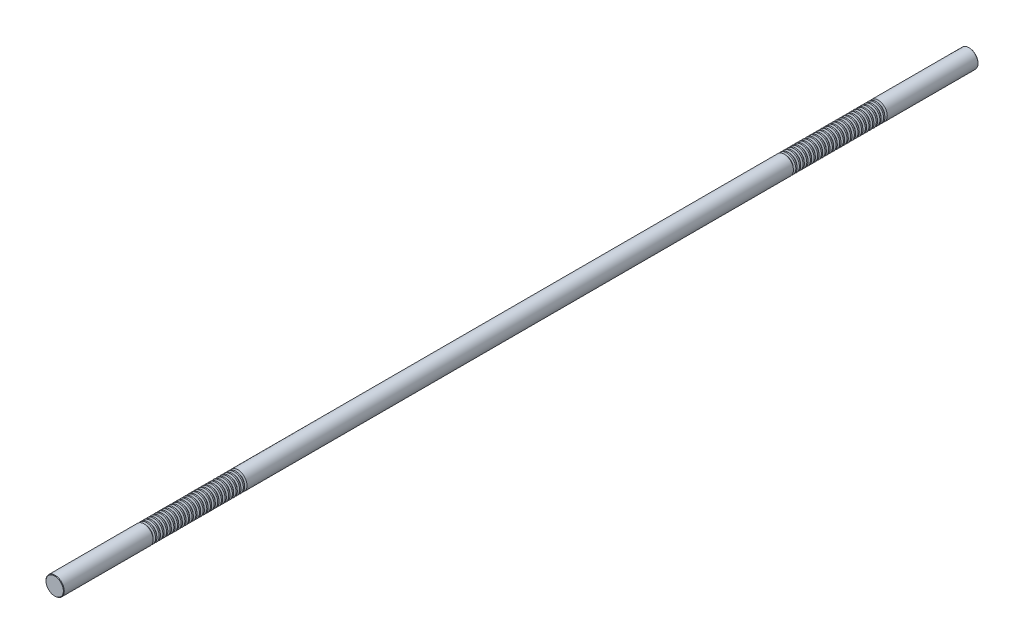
ISO-10303-21;
HEADER;
FILE_DESCRIPTION(('STEP AP214'),'2;1');
FILE_NAME('part.step','',(''),(''),'','','');
FILE_SCHEMA(('AUTOMOTIVE_DESIGN { 1 0 10303 214 1 1 1 1 }'));
ENDSEC;
DATA;
#1=APPLICATION_CONTEXT('core data for automotive mechanical design processes');
#2=APPLICATION_PROTOCOL_DEFINITION('international standard','automotive_design',2000,#1);
#3=PRODUCT_CONTEXT('',#1,'mechanical');
#4=PRODUCT('Part','Part','',(#3));
#5=PRODUCT_RELATED_PRODUCT_CATEGORY('part','',(#4));
#6=PRODUCT_DEFINITION_FORMATION('','',#4);
#7=PRODUCT_DEFINITION_CONTEXT('part definition',#1,'design');
#8=PRODUCT_DEFINITION('design','',#6,#7);
#9=PRODUCT_DEFINITION_SHAPE('','',#8);
#10=(LENGTH_UNIT() NAMED_UNIT(*) SI_UNIT(.MILLI.,.METRE.));
#11=(NAMED_UNIT(*) PLANE_ANGLE_UNIT() SI_UNIT($,.RADIAN.));
#12=(NAMED_UNIT(*) SI_UNIT($,.STERADIAN.) SOLID_ANGLE_UNIT());
#13=UNCERTAINTY_MEASURE_WITH_UNIT(LENGTH_MEASURE(1.E-05),#10,'distance_accuracy_value','');
#14=(GEOMETRIC_REPRESENTATION_CONTEXT(3) GLOBAL_UNCERTAINTY_ASSIGNED_CONTEXT((#13)) GLOBAL_UNIT_ASSIGNED_CONTEXT((#10,
#11,#12)) REPRESENTATION_CONTEXT('',''));
#15=CARTESIAN_POINT('',(0.,0.,0.));
#16=DIRECTION('',(0.,0.,1.));
#17=DIRECTION('',(1.,0.,0.));
#18=AXIS2_PLACEMENT_3D('',#15,#16,#17);
#19=CARTESIAN_POINT('',(0.,0.,500.));
#20=DIRECTION('',(0.,0.,-1.));
#21=DIRECTION('',(-1.,0.,0.));
#22=AXIS2_PLACEMENT_3D('',#19,#20,#21);
#23=CYLINDRICAL_SURFACE('',#22,10.);
#24=CARTESIAN_POINT('',(0.,0.,398.301442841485));
#25=DIRECTION('',(0.,0.,1.));
#26=DIRECTION('',(1.,0.,0.));
#27=AXIS2_PLACEMENT_3D('',#24,#25,#26);
#28=CIRCLE('',#27,10.);
#29=CARTESIAN_POINT('',(10.,0.,398.301442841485));
#30=VERTEX_POINT('',#29);
#31=EDGE_CURVE('E865',#30,#30,#28,.T.);
#32=ORIENTED_EDGE('',*,*,#31,.T.);
#33=EDGE_LOOP('',(#32));
#34=FACE_BOUND('',#33,.T.);
#35=CARTESIAN_POINT('',(0.,0.,399.698557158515));
#36=DIRECTION('',(0.,0.,1.));
#37=DIRECTION('',(1.,0.,0.));
#38=AXIS2_PLACEMENT_3D('',#35,#36,#37);
#39=CIRCLE('',#38,10.);
#40=CARTESIAN_POINT('',(10.,0.,399.698557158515));
#41=VERTEX_POINT('',#40);
#42=EDGE_CURVE('E877',#41,#41,#39,.T.);
#43=ORIENTED_EDGE('',*,*,#42,.F.);
#44=EDGE_LOOP('',(#43));
#45=FACE_BOUND('',#44,.T.);
#46=ADVANCED_FACE('F37',(#34,#45),#23,.T.);
#47=CARTESIAN_POINT('',(0.,0.,394.301442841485));
#48=DIRECTION('',(0.,0.,1.));
#49=DIRECTION('',(1.,0.,0.));
#50=AXIS2_PLACEMENT_3D('',#47,#48,#49);
#51=CIRCLE('',#50,10.);
#52=CARTESIAN_POINT('',(10.,0.,394.301442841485));
#53=VERTEX_POINT('',#52);
#54=EDGE_CURVE('E849',#53,#53,#51,.T.);
#55=ORIENTED_EDGE('',*,*,#54,.T.);
#56=EDGE_LOOP('',(#55));
#57=FACE_BOUND('',#56,.T.);
#58=CARTESIAN_POINT('',(0.,0.,395.698557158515));
#59=DIRECTION('',(0.,0.,1.));
#60=DIRECTION('',(1.,0.,0.));
#61=AXIS2_PLACEMENT_3D('',#58,#59,#60);
#62=CIRCLE('',#61,10.);
#63=CARTESIAN_POINT('',(10.,0.,395.698557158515));
#64=VERTEX_POINT('',#63);
#65=EDGE_CURVE('E861',#64,#64,#62,.T.);
#66=ORIENTED_EDGE('',*,*,#65,.F.);
#67=EDGE_LOOP('',(#66));
#68=FACE_BOUND('',#67,.T.);
#69=ADVANCED_FACE('F913',(#57,#68),#23,.T.);
#70=CARTESIAN_POINT('',(0.,0.,390.301442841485));
#71=DIRECTION('',(0.,0.,1.));
#72=DIRECTION('',(1.,0.,0.));
#73=AXIS2_PLACEMENT_3D('',#70,#71,#72);
#74=CIRCLE('',#73,10.);
#75=CARTESIAN_POINT('',(10.,0.,390.301442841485));
#76=VERTEX_POINT('',#75);
#77=EDGE_CURVE('E833',#76,#76,#74,.T.);
#78=ORIENTED_EDGE('',*,*,#77,.T.);
#79=EDGE_LOOP('',(#78));
#80=FACE_BOUND('',#79,.T.);
#81=CARTESIAN_POINT('',(0.,0.,391.698557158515));
#82=DIRECTION('',(0.,0.,1.));
#83=DIRECTION('',(1.,0.,0.));
#84=AXIS2_PLACEMENT_3D('',#81,#82,#83);
#85=CIRCLE('',#84,10.);
#86=CARTESIAN_POINT('',(10.,0.,391.698557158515));
#87=VERTEX_POINT('',#86);
#88=EDGE_CURVE('E845',#87,#87,#85,.T.);
#89=ORIENTED_EDGE('',*,*,#88,.F.);
#90=EDGE_LOOP('',(#89));
#91=FACE_BOUND('',#90,.T.);
#92=ADVANCED_FACE('F921',(#80,#91),#23,.T.);
#93=CARTESIAN_POINT('',(0.,0.,386.301442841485));
#94=DIRECTION('',(0.,0.,1.));
#95=DIRECTION('',(1.,0.,0.));
#96=AXIS2_PLACEMENT_3D('',#93,#94,#95);
#97=CIRCLE('',#96,10.);
#98=CARTESIAN_POINT('',(10.,0.,386.301442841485));
#99=VERTEX_POINT('',#98);
#100=EDGE_CURVE('E817',#99,#99,#97,.T.);
#101=ORIENTED_EDGE('',*,*,#100,.T.);
#102=EDGE_LOOP('',(#101));
#103=FACE_BOUND('',#102,.T.);
#104=CARTESIAN_POINT('',(0.,0.,387.698557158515));
#105=DIRECTION('',(0.,0.,1.));
#106=DIRECTION('',(1.,0.,0.));
#107=AXIS2_PLACEMENT_3D('',#104,#105,#106);
#108=CIRCLE('',#107,10.);
#109=CARTESIAN_POINT('',(10.,0.,387.698557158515));
#110=VERTEX_POINT('',#109);
#111=EDGE_CURVE('E829',#110,#110,#108,.T.);
#112=ORIENTED_EDGE('',*,*,#111,.F.);
#113=EDGE_LOOP('',(#112));
#114=FACE_BOUND('',#113,.T.);
#115=ADVANCED_FACE('F2018',(#103,#114),#23,.T.);
#116=CARTESIAN_POINT('',(0.,0.,382.301442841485));
#117=DIRECTION('',(0.,0.,1.));
#118=DIRECTION('',(1.,0.,0.));
#119=AXIS2_PLACEMENT_3D('',#116,#117,#118);
#120=CIRCLE('',#119,10.);
#121=CARTESIAN_POINT('',(10.,0.,382.301442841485));
#122=VERTEX_POINT('',#121);
#123=EDGE_CURVE('E803',#122,#122,#120,.T.);
#124=ORIENTED_EDGE('',*,*,#123,.T.);
#125=EDGE_LOOP('',(#124));
#126=FACE_BOUND('',#125,.T.);
#127=CARTESIAN_POINT('',(0.,0.,383.698557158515));
#128=DIRECTION('',(0.,0.,1.));
#129=DIRECTION('',(1.,0.,0.));
#130=AXIS2_PLACEMENT_3D('',#127,#128,#129);
#131=CIRCLE('',#130,10.);
#132=CARTESIAN_POINT('',(10.,0.,383.698557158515));
#133=VERTEX_POINT('',#132);
#134=EDGE_CURVE('E813',#133,#133,#131,.T.);
#135=ORIENTED_EDGE('',*,*,#134,.F.);
#136=EDGE_LOOP('',(#135));
#137=FACE_BOUND('',#136,.T.);
#138=ADVANCED_FACE('F1995',(#126,#137),#23,.T.);
#139=CARTESIAN_POINT('',(0.,0.,378.301442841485));
#140=DIRECTION('',(0.,0.,1.));
#141=DIRECTION('',(1.,0.,0.));
#142=AXIS2_PLACEMENT_3D('',#139,#140,#141);
#143=CIRCLE('',#142,10.);
#144=CARTESIAN_POINT('',(10.,0.,378.301442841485));
#145=VERTEX_POINT('',#144);
#146=EDGE_CURVE('E787',#145,#145,#143,.T.);
#147=ORIENTED_EDGE('',*,*,#146,.T.);
#148=EDGE_LOOP('',(#147));
#149=FACE_BOUND('',#148,.T.);
#150=CARTESIAN_POINT('',(0.,0.,379.698557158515));
#151=DIRECTION('',(0.,0.,1.));
#152=DIRECTION('',(1.,0.,0.));
#153=AXIS2_PLACEMENT_3D('',#150,#151,#152);
#154=CIRCLE('',#153,10.);
#155=CARTESIAN_POINT('',(10.,0.,379.698557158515));
#156=VERTEX_POINT('',#155);
#157=EDGE_CURVE('E799',#156,#156,#154,.T.);
#158=ORIENTED_EDGE('',*,*,#157,.F.);
#159=EDGE_LOOP('',(#158));
#160=FACE_BOUND('',#159,.T.);
#161=ADVANCED_FACE('F1972',(#149,#160),#23,.T.);
#162=CARTESIAN_POINT('',(0.,0.,374.301442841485));
#163=DIRECTION('',(0.,0.,1.));
#164=DIRECTION('',(1.,0.,0.));
#165=AXIS2_PLACEMENT_3D('',#162,#163,#164);
#166=CIRCLE('',#165,10.);
#167=CARTESIAN_POINT('',(10.,0.,374.301442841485));
#168=VERTEX_POINT('',#167);
#169=EDGE_CURVE('E771',#168,#168,#166,.T.);
#170=ORIENTED_EDGE('',*,*,#169,.T.);
#171=EDGE_LOOP('',(#170));
#172=FACE_BOUND('',#171,.T.);
#173=CARTESIAN_POINT('',(0.,0.,375.698557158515));
#174=DIRECTION('',(0.,0.,1.));
#175=DIRECTION('',(1.,0.,0.));
#176=AXIS2_PLACEMENT_3D('',#173,#174,#175);
#177=CIRCLE('',#176,10.);
#178=CARTESIAN_POINT('',(10.,0.,375.698557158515));
#179=VERTEX_POINT('',#178);
#180=EDGE_CURVE('E783',#179,#179,#177,.T.);
#181=ORIENTED_EDGE('',*,*,#180,.F.);
#182=EDGE_LOOP('',(#181));
#183=FACE_BOUND('',#182,.T.);
#184=ADVANCED_FACE('F1949',(#172,#183),#23,.T.);
#185=CARTESIAN_POINT('',(0.,0.,370.301442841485));
#186=DIRECTION('',(0.,0.,1.));
#187=DIRECTION('',(1.,0.,0.));
#188=AXIS2_PLACEMENT_3D('',#185,#186,#187);
#189=CIRCLE('',#188,10.);
#190=CARTESIAN_POINT('',(10.,0.,370.301442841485));
#191=VERTEX_POINT('',#190);
#192=EDGE_CURVE('E755',#191,#191,#189,.T.);
#193=ORIENTED_EDGE('',*,*,#192,.T.);
#194=EDGE_LOOP('',(#193));
#195=FACE_BOUND('',#194,.T.);
#196=CARTESIAN_POINT('',(0.,0.,371.698557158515));
#197=DIRECTION('',(0.,0.,1.));
#198=DIRECTION('',(1.,0.,0.));
#199=AXIS2_PLACEMENT_3D('',#196,#197,#198);
#200=CIRCLE('',#199,10.);
#201=CARTESIAN_POINT('',(10.,0.,371.698557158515));
#202=VERTEX_POINT('',#201);
#203=EDGE_CURVE('E767',#202,#202,#200,.T.);
#204=ORIENTED_EDGE('',*,*,#203,.F.);
#205=EDGE_LOOP('',(#204));
#206=FACE_BOUND('',#205,.T.);
#207=ADVANCED_FACE('F1926',(#195,#206),#23,.T.);
#208=CARTESIAN_POINT('',(0.,0.,366.301442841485));
#209=DIRECTION('',(0.,0.,1.));
#210=DIRECTION('',(1.,0.,0.));
#211=AXIS2_PLACEMENT_3D('',#208,#209,#210);
#212=CIRCLE('',#211,10.);
#213=CARTESIAN_POINT('',(10.,0.,366.301442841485));
#214=VERTEX_POINT('',#213);
#215=EDGE_CURVE('E739',#214,#214,#212,.T.);
#216=ORIENTED_EDGE('',*,*,#215,.T.);
#217=EDGE_LOOP('',(#216));
#218=FACE_BOUND('',#217,.T.);
#219=CARTESIAN_POINT('',(0.,0.,367.698557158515));
#220=DIRECTION('',(0.,0.,1.));
#221=DIRECTION('',(1.,0.,0.));
#222=AXIS2_PLACEMENT_3D('',#219,#220,#221);
#223=CIRCLE('',#222,10.);
#224=CARTESIAN_POINT('',(10.,0.,367.698557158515));
#225=VERTEX_POINT('',#224);
#226=EDGE_CURVE('E751',#225,#225,#223,.T.);
#227=ORIENTED_EDGE('',*,*,#226,.F.);
#228=EDGE_LOOP('',(#227));
#229=FACE_BOUND('',#228,.T.);
#230=ADVANCED_FACE('F1903',(#218,#229),#23,.T.);
#231=CARTESIAN_POINT('',(0.,0.,362.301442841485));
#232=DIRECTION('',(0.,0.,1.));
#233=DIRECTION('',(1.,0.,0.));
#234=AXIS2_PLACEMENT_3D('',#231,#232,#233);
#235=CIRCLE('',#234,10.);
#236=CARTESIAN_POINT('',(10.,0.,362.301442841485));
#237=VERTEX_POINT('',#236);
#238=EDGE_CURVE('E723',#237,#237,#235,.T.);
#239=ORIENTED_EDGE('',*,*,#238,.T.);
#240=EDGE_LOOP('',(#239));
#241=FACE_BOUND('',#240,.T.);
#242=CARTESIAN_POINT('',(0.,0.,363.698557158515));
#243=DIRECTION('',(0.,0.,1.));
#244=DIRECTION('',(1.,0.,0.));
#245=AXIS2_PLACEMENT_3D('',#242,#243,#244);
#246=CIRCLE('',#245,10.);
#247=CARTESIAN_POINT('',(10.,0.,363.698557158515));
#248=VERTEX_POINT('',#247);
#249=EDGE_CURVE('E735',#248,#248,#246,.T.);
#250=ORIENTED_EDGE('',*,*,#249,.F.);
#251=EDGE_LOOP('',(#250));
#252=FACE_BOUND('',#251,.T.);
#253=ADVANCED_FACE('F1880',(#241,#252),#23,.T.);
#254=CARTESIAN_POINT('',(0.,0.,358.301442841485));
#255=DIRECTION('',(0.,0.,1.));
#256=DIRECTION('',(1.,0.,0.));
#257=AXIS2_PLACEMENT_3D('',#254,#255,#256);
#258=CIRCLE('',#257,10.);
#259=CARTESIAN_POINT('',(10.,0.,358.301442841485));
#260=VERTEX_POINT('',#259);
#261=EDGE_CURVE('E707',#260,#260,#258,.T.);
#262=ORIENTED_EDGE('',*,*,#261,.T.);
#263=EDGE_LOOP('',(#262));
#264=FACE_BOUND('',#263,.T.);
#265=CARTESIAN_POINT('',(0.,0.,359.698557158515));
#266=DIRECTION('',(0.,0.,1.));
#267=DIRECTION('',(1.,0.,0.));
#268=AXIS2_PLACEMENT_3D('',#265,#266,#267);
#269=CIRCLE('',#268,10.);
#270=CARTESIAN_POINT('',(10.,0.,359.698557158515));
#271=VERTEX_POINT('',#270);
#272=EDGE_CURVE('E719',#271,#271,#269,.T.);
#273=ORIENTED_EDGE('',*,*,#272,.F.);
#274=EDGE_LOOP('',(#273));
#275=FACE_BOUND('',#274,.T.);
#276=ADVANCED_FACE('F1857',(#264,#275),#23,.T.);
#277=CARTESIAN_POINT('',(0.,0.,354.301442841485));
#278=DIRECTION('',(0.,0.,1.));
#279=DIRECTION('',(1.,0.,0.));
#280=AXIS2_PLACEMENT_3D('',#277,#278,#279);
#281=CIRCLE('',#280,10.);
#282=CARTESIAN_POINT('',(10.,0.,354.301442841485));
#283=VERTEX_POINT('',#282);
#284=EDGE_CURVE('E691',#283,#283,#281,.T.);
#285=ORIENTED_EDGE('',*,*,#284,.T.);
#286=EDGE_LOOP('',(#285));
#287=FACE_BOUND('',#286,.T.);
#288=CARTESIAN_POINT('',(0.,0.,355.698557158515));
#289=DIRECTION('',(0.,0.,1.));
#290=DIRECTION('',(1.,0.,0.));
#291=AXIS2_PLACEMENT_3D('',#288,#289,#290);
#292=CIRCLE('',#291,10.);
#293=CARTESIAN_POINT('',(10.,0.,355.698557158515));
#294=VERTEX_POINT('',#293);
#295=EDGE_CURVE('E703',#294,#294,#292,.T.);
#296=ORIENTED_EDGE('',*,*,#295,.F.);
#297=EDGE_LOOP('',(#296));
#298=FACE_BOUND('',#297,.T.);
#299=ADVANCED_FACE('F1834',(#287,#298),#23,.T.);
#300=CARTESIAN_POINT('',(0.,0.,350.301442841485));
#301=DIRECTION('',(0.,0.,1.));
#302=DIRECTION('',(1.,0.,0.));
#303=AXIS2_PLACEMENT_3D('',#300,#301,#302);
#304=CIRCLE('',#303,10.);
#305=CARTESIAN_POINT('',(10.,0.,350.301442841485));
#306=VERTEX_POINT('',#305);
#307=EDGE_CURVE('E675',#306,#306,#304,.T.);
#308=ORIENTED_EDGE('',*,*,#307,.T.);
#309=EDGE_LOOP('',(#308));
#310=FACE_BOUND('',#309,.T.);
#311=CARTESIAN_POINT('',(0.,0.,351.698557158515));
#312=DIRECTION('',(0.,0.,1.));
#313=DIRECTION('',(1.,0.,0.));
#314=AXIS2_PLACEMENT_3D('',#311,#312,#313);
#315=CIRCLE('',#314,10.);
#316=CARTESIAN_POINT('',(10.,0.,351.698557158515));
#317=VERTEX_POINT('',#316);
#318=EDGE_CURVE('E687',#317,#317,#315,.T.);
#319=ORIENTED_EDGE('',*,*,#318,.F.);
#320=EDGE_LOOP('',(#319));
#321=FACE_BOUND('',#320,.T.);
#322=ADVANCED_FACE('F1811',(#310,#321),#23,.T.);
#323=CARTESIAN_POINT('',(0.,0.,346.301442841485));
#324=DIRECTION('',(0.,0.,1.));
#325=DIRECTION('',(1.,0.,0.));
#326=AXIS2_PLACEMENT_3D('',#323,#324,#325);
#327=CIRCLE('',#326,10.);
#328=CARTESIAN_POINT('',(10.,0.,346.301442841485));
#329=VERTEX_POINT('',#328);
#330=EDGE_CURVE('E659',#329,#329,#327,.T.);
#331=ORIENTED_EDGE('',*,*,#330,.T.);
#332=EDGE_LOOP('',(#331));
#333=FACE_BOUND('',#332,.T.);
#334=CARTESIAN_POINT('',(0.,0.,347.698557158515));
#335=DIRECTION('',(0.,0.,1.));
#336=DIRECTION('',(1.,0.,0.));
#337=AXIS2_PLACEMENT_3D('',#334,#335,#336);
#338=CIRCLE('',#337,10.);
#339=CARTESIAN_POINT('',(10.,0.,347.698557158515));
#340=VERTEX_POINT('',#339);
#341=EDGE_CURVE('E671',#340,#340,#338,.T.);
#342=ORIENTED_EDGE('',*,*,#341,.F.);
#343=EDGE_LOOP('',(#342));
#344=FACE_BOUND('',#343,.T.);
#345=ADVANCED_FACE('F1788',(#333,#344),#23,.T.);
#346=CARTESIAN_POINT('',(0.,0.,342.301442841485));
#347=DIRECTION('',(0.,0.,1.));
#348=DIRECTION('',(1.,0.,0.));
#349=AXIS2_PLACEMENT_3D('',#346,#347,#348);
#350=CIRCLE('',#349,10.);
#351=CARTESIAN_POINT('',(10.,0.,342.301442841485));
#352=VERTEX_POINT('',#351);
#353=EDGE_CURVE('E643',#352,#352,#350,.T.);
#354=ORIENTED_EDGE('',*,*,#353,.T.);
#355=EDGE_LOOP('',(#354));
#356=FACE_BOUND('',#355,.T.);
#357=CARTESIAN_POINT('',(0.,0.,343.698557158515));
#358=DIRECTION('',(0.,0.,1.));
#359=DIRECTION('',(1.,0.,0.));
#360=AXIS2_PLACEMENT_3D('',#357,#358,#359);
#361=CIRCLE('',#360,10.);
#362=CARTESIAN_POINT('',(10.,0.,343.698557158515));
#363=VERTEX_POINT('',#362);
#364=EDGE_CURVE('E655',#363,#363,#361,.T.);
#365=ORIENTED_EDGE('',*,*,#364,.F.);
#366=EDGE_LOOP('',(#365));
#367=FACE_BOUND('',#366,.T.);
#368=ADVANCED_FACE('F1765',(#356,#367),#23,.T.);
#369=CARTESIAN_POINT('',(0.,0.,338.301442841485));
#370=DIRECTION('',(0.,0.,1.));
#371=DIRECTION('',(1.,0.,0.));
#372=AXIS2_PLACEMENT_3D('',#369,#370,#371);
#373=CIRCLE('',#372,10.);
#374=CARTESIAN_POINT('',(10.,0.,338.301442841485));
#375=VERTEX_POINT('',#374);
#376=EDGE_CURVE('E627',#375,#375,#373,.T.);
#377=ORIENTED_EDGE('',*,*,#376,.T.);
#378=EDGE_LOOP('',(#377));
#379=FACE_BOUND('',#378,.T.);
#380=CARTESIAN_POINT('',(0.,0.,339.698557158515));
#381=DIRECTION('',(0.,0.,1.));
#382=DIRECTION('',(1.,0.,0.));
#383=AXIS2_PLACEMENT_3D('',#380,#381,#382);
#384=CIRCLE('',#383,10.);
#385=CARTESIAN_POINT('',(10.,0.,339.698557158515));
#386=VERTEX_POINT('',#385);
#387=EDGE_CURVE('E639',#386,#386,#384,.T.);
#388=ORIENTED_EDGE('',*,*,#387,.F.);
#389=EDGE_LOOP('',(#388));
#390=FACE_BOUND('',#389,.T.);
#391=ADVANCED_FACE('F1742',(#379,#390),#23,.T.);
#392=CARTESIAN_POINT('',(0.,0.,334.301442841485));
#393=DIRECTION('',(0.,0.,1.));
#394=DIRECTION('',(1.,0.,0.));
#395=AXIS2_PLACEMENT_3D('',#392,#393,#394);
#396=CIRCLE('',#395,10.);
#397=CARTESIAN_POINT('',(10.,0.,334.301442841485));
#398=VERTEX_POINT('',#397);
#399=EDGE_CURVE('E611',#398,#398,#396,.T.);
#400=ORIENTED_EDGE('',*,*,#399,.T.);
#401=EDGE_LOOP('',(#400));
#402=FACE_BOUND('',#401,.T.);
#403=CARTESIAN_POINT('',(0.,0.,335.698557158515));
#404=DIRECTION('',(0.,0.,1.));
#405=DIRECTION('',(1.,0.,0.));
#406=AXIS2_PLACEMENT_3D('',#403,#404,#405);
#407=CIRCLE('',#406,10.);
#408=CARTESIAN_POINT('',(10.,0.,335.698557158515));
#409=VERTEX_POINT('',#408);
#410=EDGE_CURVE('E623',#409,#409,#407,.T.);
#411=ORIENTED_EDGE('',*,*,#410,.F.);
#412=EDGE_LOOP('',(#411));
#413=FACE_BOUND('',#412,.T.);
#414=ADVANCED_FACE('F1719',(#402,#413),#23,.T.);
#415=CARTESIAN_POINT('',(0.,0.,330.301442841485));
#416=DIRECTION('',(0.,0.,1.));
#417=DIRECTION('',(1.,0.,0.));
#418=AXIS2_PLACEMENT_3D('',#415,#416,#417);
#419=CIRCLE('',#418,10.);
#420=CARTESIAN_POINT('',(10.,0.,330.301442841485));
#421=VERTEX_POINT('',#420);
#422=EDGE_CURVE('E595',#421,#421,#419,.T.);
#423=ORIENTED_EDGE('',*,*,#422,.T.);
#424=EDGE_LOOP('',(#423));
#425=FACE_BOUND('',#424,.T.);
#426=CARTESIAN_POINT('',(0.,0.,331.698557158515));
#427=DIRECTION('',(0.,0.,1.));
#428=DIRECTION('',(1.,0.,0.));
#429=AXIS2_PLACEMENT_3D('',#426,#427,#428);
#430=CIRCLE('',#429,10.);
#431=CARTESIAN_POINT('',(10.,0.,331.698557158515));
#432=VERTEX_POINT('',#431);
#433=EDGE_CURVE('E607',#432,#432,#430,.T.);
#434=ORIENTED_EDGE('',*,*,#433,.F.);
#435=EDGE_LOOP('',(#434));
#436=FACE_BOUND('',#435,.T.);
#437=ADVANCED_FACE('F1696',(#425,#436),#23,.T.);
#438=CARTESIAN_POINT('',(0.,0.,326.301442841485));
#439=DIRECTION('',(0.,0.,1.));
#440=DIRECTION('',(1.,0.,0.));
#441=AXIS2_PLACEMENT_3D('',#438,#439,#440);
#442=CIRCLE('',#441,10.);
#443=CARTESIAN_POINT('',(10.,0.,326.301442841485));
#444=VERTEX_POINT('',#443);
#445=EDGE_CURVE('E579',#444,#444,#442,.T.);
#446=ORIENTED_EDGE('',*,*,#445,.T.);
#447=EDGE_LOOP('',(#446));
#448=FACE_BOUND('',#447,.T.);
#449=CARTESIAN_POINT('',(0.,0.,327.698557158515));
#450=DIRECTION('',(0.,0.,1.));
#451=DIRECTION('',(1.,0.,0.));
#452=AXIS2_PLACEMENT_3D('',#449,#450,#451);
#453=CIRCLE('',#452,10.);
#454=CARTESIAN_POINT('',(10.,0.,327.698557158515));
#455=VERTEX_POINT('',#454);
#456=EDGE_CURVE('E591',#455,#455,#453,.T.);
#457=ORIENTED_EDGE('',*,*,#456,.F.);
#458=EDGE_LOOP('',(#457));
#459=FACE_BOUND('',#458,.T.);
#460=ADVANCED_FACE('F1673',(#448,#459),#23,.T.);
#461=CARTESIAN_POINT('',(0.,0.,322.301442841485));
#462=DIRECTION('',(0.,0.,1.));
#463=DIRECTION('',(1.,0.,0.));
#464=AXIS2_PLACEMENT_3D('',#461,#462,#463);
#465=CIRCLE('',#464,10.);
#466=CARTESIAN_POINT('',(10.,0.,322.301442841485));
#467=VERTEX_POINT('',#466);
#468=EDGE_CURVE('E563',#467,#467,#465,.T.);
#469=ORIENTED_EDGE('',*,*,#468,.T.);
#470=EDGE_LOOP('',(#469));
#471=FACE_BOUND('',#470,.T.);
#472=CARTESIAN_POINT('',(0.,0.,323.698557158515));
#473=DIRECTION('',(0.,0.,1.));
#474=DIRECTION('',(1.,0.,0.));
#475=AXIS2_PLACEMENT_3D('',#472,#473,#474);
#476=CIRCLE('',#475,10.);
#477=CARTESIAN_POINT('',(10.,0.,323.698557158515));
#478=VERTEX_POINT('',#477);
#479=EDGE_CURVE('E575',#478,#478,#476,.T.);
#480=ORIENTED_EDGE('',*,*,#479,.F.);
#481=EDGE_LOOP('',(#480));
#482=FACE_BOUND('',#481,.T.);
#483=ADVANCED_FACE('F1650',(#471,#482),#23,.T.);
#484=CARTESIAN_POINT('',(0.,0.,318.301442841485));
#485=DIRECTION('',(0.,0.,1.));
#486=DIRECTION('',(1.,0.,0.));
#487=AXIS2_PLACEMENT_3D('',#484,#485,#486);
#488=CIRCLE('',#487,10.);
#489=CARTESIAN_POINT('',(10.,0.,318.301442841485));
#490=VERTEX_POINT('',#489);
#491=EDGE_CURVE('E547',#490,#490,#488,.T.);
#492=ORIENTED_EDGE('',*,*,#491,.T.);
#493=EDGE_LOOP('',(#492));
#494=FACE_BOUND('',#493,.T.);
#495=CARTESIAN_POINT('',(0.,0.,319.698557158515));
#496=DIRECTION('',(0.,0.,1.));
#497=DIRECTION('',(1.,0.,0.));
#498=AXIS2_PLACEMENT_3D('',#495,#496,#497);
#499=CIRCLE('',#498,10.);
#500=CARTESIAN_POINT('',(10.,0.,319.698557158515));
#501=VERTEX_POINT('',#500);
#502=EDGE_CURVE('E559',#501,#501,#499,.T.);
#503=ORIENTED_EDGE('',*,*,#502,.F.);
#504=EDGE_LOOP('',(#503));
#505=FACE_BOUND('',#504,.T.);
#506=ADVANCED_FACE('F1627',(#494,#505),#23,.T.);
#507=CARTESIAN_POINT('',(0.,0.,314.301442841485));
#508=DIRECTION('',(0.,0.,1.));
#509=DIRECTION('',(1.,0.,0.));
#510=AXIS2_PLACEMENT_3D('',#507,#508,#509);
#511=CIRCLE('',#510,10.);
#512=CARTESIAN_POINT('',(10.,0.,314.301442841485));
#513=VERTEX_POINT('',#512);
#514=EDGE_CURVE('E531',#513,#513,#511,.T.);
#515=ORIENTED_EDGE('',*,*,#514,.T.);
#516=EDGE_LOOP('',(#515));
#517=FACE_BOUND('',#516,.T.);
#518=CARTESIAN_POINT('',(0.,0.,315.698557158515));
#519=DIRECTION('',(0.,0.,1.));
#520=DIRECTION('',(1.,0.,0.));
#521=AXIS2_PLACEMENT_3D('',#518,#519,#520);
#522=CIRCLE('',#521,10.);
#523=CARTESIAN_POINT('',(10.,0.,315.698557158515));
#524=VERTEX_POINT('',#523);
#525=EDGE_CURVE('E543',#524,#524,#522,.T.);
#526=ORIENTED_EDGE('',*,*,#525,.F.);
#527=EDGE_LOOP('',(#526));
#528=FACE_BOUND('',#527,.T.);
#529=ADVANCED_FACE('F1604',(#517,#528),#23,.T.);
#530=CARTESIAN_POINT('',(0.,0.,310.301442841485));
#531=DIRECTION('',(0.,0.,1.));
#532=DIRECTION('',(1.,0.,0.));
#533=AXIS2_PLACEMENT_3D('',#530,#531,#532);
#534=CIRCLE('',#533,10.);
#535=CARTESIAN_POINT('',(10.,0.,310.301442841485));
#536=VERTEX_POINT('',#535);
#537=EDGE_CURVE('E515',#536,#536,#534,.T.);
#538=ORIENTED_EDGE('',*,*,#537,.T.);
#539=EDGE_LOOP('',(#538));
#540=FACE_BOUND('',#539,.T.);
#541=CARTESIAN_POINT('',(0.,0.,311.698557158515));
#542=DIRECTION('',(0.,0.,1.));
#543=DIRECTION('',(1.,0.,0.));
#544=AXIS2_PLACEMENT_3D('',#541,#542,#543);
#545=CIRCLE('',#544,10.);
#546=CARTESIAN_POINT('',(10.,0.,311.698557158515));
#547=VERTEX_POINT('',#546);
#548=EDGE_CURVE('E527',#547,#547,#545,.T.);
#549=ORIENTED_EDGE('',*,*,#548,.F.);
#550=EDGE_LOOP('',(#549));
#551=FACE_BOUND('',#550,.T.);
#552=ADVANCED_FACE('F1581',(#540,#551),#23,.T.);
#553=CARTESIAN_POINT('',(0.,0.,306.301442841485));
#554=DIRECTION('',(0.,0.,1.));
#555=DIRECTION('',(1.,0.,0.));
#556=AXIS2_PLACEMENT_3D('',#553,#554,#555);
#557=CIRCLE('',#556,10.);
#558=CARTESIAN_POINT('',(10.,0.,306.301442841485));
#559=VERTEX_POINT('',#558);
#560=EDGE_CURVE('E499',#559,#559,#557,.T.);
#561=ORIENTED_EDGE('',*,*,#560,.T.);
#562=EDGE_LOOP('',(#561));
#563=FACE_BOUND('',#562,.T.);
#564=CARTESIAN_POINT('',(0.,0.,307.698557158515));
#565=DIRECTION('',(0.,0.,1.));
#566=DIRECTION('',(1.,0.,0.));
#567=AXIS2_PLACEMENT_3D('',#564,#565,#566);
#568=CIRCLE('',#567,10.);
#569=CARTESIAN_POINT('',(10.,0.,307.698557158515));
#570=VERTEX_POINT('',#569);
#571=EDGE_CURVE('E511',#570,#570,#568,.T.);
#572=ORIENTED_EDGE('',*,*,#571,.F.);
#573=EDGE_LOOP('',(#572));
#574=FACE_BOUND('',#573,.T.);
#575=ADVANCED_FACE('F1558',(#563,#574),#23,.T.);
#576=CARTESIAN_POINT('',(0.,0.,302.301442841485));
#577=DIRECTION('',(0.,0.,1.));
#578=DIRECTION('',(1.,0.,0.));
#579=AXIS2_PLACEMENT_3D('',#576,#577,#578);
#580=CIRCLE('',#579,10.);
#581=CARTESIAN_POINT('',(10.,0.,302.301442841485));
#582=VERTEX_POINT('',#581);
#583=EDGE_CURVE('E483',#582,#582,#580,.T.);
#584=ORIENTED_EDGE('',*,*,#583,.T.);
#585=EDGE_LOOP('',(#584));
#586=FACE_BOUND('',#585,.T.);
#587=CARTESIAN_POINT('',(0.,0.,303.698557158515));
#588=DIRECTION('',(0.,0.,1.));
#589=DIRECTION('',(1.,0.,0.));
#590=AXIS2_PLACEMENT_3D('',#587,#588,#589);
#591=CIRCLE('',#590,10.);
#592=CARTESIAN_POINT('',(10.,0.,303.698557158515));
#593=VERTEX_POINT('',#592);
#594=EDGE_CURVE('E495',#593,#593,#591,.T.);
#595=ORIENTED_EDGE('',*,*,#594,.F.);
#596=EDGE_LOOP('',(#595));
#597=FACE_BOUND('',#596,.T.);
#598=ADVANCED_FACE('F1535',(#586,#597),#23,.T.);
#599=CARTESIAN_POINT('',(0.,0.,-297.698557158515));
#600=DIRECTION('',(0.,0.,1.));
#601=DIRECTION('',(1.,0.,0.));
#602=AXIS2_PLACEMENT_3D('',#599,#600,#601);
#603=CIRCLE('',#602,10.);
#604=CARTESIAN_POINT('',(10.,0.,-297.698557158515));
#605=VERTEX_POINT('',#604);
#606=EDGE_CURVE('E467',#605,#605,#603,.T.);
#607=ORIENTED_EDGE('',*,*,#606,.T.);
#608=EDGE_LOOP('',(#607));
#609=FACE_BOUND('',#608,.T.);
#610=CARTESIAN_POINT('',(0.,0.,299.698557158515));
#611=DIRECTION('',(0.,0.,1.));
#612=DIRECTION('',(1.,0.,0.));
#613=AXIS2_PLACEMENT_3D('',#610,#611,#612);
#614=CIRCLE('',#613,10.);
#615=CARTESIAN_POINT('',(10.,0.,299.698557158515));
#616=VERTEX_POINT('',#615);
#617=EDGE_CURVE('E479',#616,#616,#614,.T.);
#618=ORIENTED_EDGE('',*,*,#617,.F.);
#619=EDGE_LOOP('',(#618));
#620=FACE_BOUND('',#619,.T.);
#621=ADVANCED_FACE('F1512',(#609,#620),#23,.T.);
#622=CARTESIAN_POINT('',(0.,0.,-301.698557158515));
#623=DIRECTION('',(0.,0.,1.));
#624=DIRECTION('',(1.,0.,0.));
#625=AXIS2_PLACEMENT_3D('',#622,#623,#624);
#626=CIRCLE('',#625,10.);
#627=CARTESIAN_POINT('',(10.,0.,-301.698557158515));
#628=VERTEX_POINT('',#627);
#629=EDGE_CURVE('E451',#628,#628,#626,.T.);
#630=ORIENTED_EDGE('',*,*,#629,.T.);
#631=EDGE_LOOP('',(#630));
#632=FACE_BOUND('',#631,.T.);
#633=CARTESIAN_POINT('',(0.,0.,-300.301442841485));
#634=DIRECTION('',(0.,0.,1.));
#635=DIRECTION('',(1.,0.,0.));
#636=AXIS2_PLACEMENT_3D('',#633,#634,#635);
#637=CIRCLE('',#636,10.);
#638=CARTESIAN_POINT('',(10.,0.,-300.301442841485));
#639=VERTEX_POINT('',#638);
#640=EDGE_CURVE('E463',#639,#639,#637,.T.);
#641=ORIENTED_EDGE('',*,*,#640,.F.);
#642=EDGE_LOOP('',(#641));
#643=FACE_BOUND('',#642,.T.);
#644=ADVANCED_FACE('F1489',(#632,#643),#23,.T.);
#645=CARTESIAN_POINT('',(0.,0.,-305.698557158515));
#646=DIRECTION('',(0.,0.,1.));
#647=DIRECTION('',(1.,0.,0.));
#648=AXIS2_PLACEMENT_3D('',#645,#646,#647);
#649=CIRCLE('',#648,10.);
#650=CARTESIAN_POINT('',(10.,0.,-305.698557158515));
#651=VERTEX_POINT('',#650);
#652=EDGE_CURVE('E435',#651,#651,#649,.T.);
#653=ORIENTED_EDGE('',*,*,#652,.T.);
#654=EDGE_LOOP('',(#653));
#655=FACE_BOUND('',#654,.T.);
#656=CARTESIAN_POINT('',(0.,0.,-304.301442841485));
#657=DIRECTION('',(0.,0.,1.));
#658=DIRECTION('',(1.,0.,0.));
#659=AXIS2_PLACEMENT_3D('',#656,#657,#658);
#660=CIRCLE('',#659,10.);
#661=CARTESIAN_POINT('',(10.,0.,-304.301442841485));
#662=VERTEX_POINT('',#661);
#663=EDGE_CURVE('E447',#662,#662,#660,.T.);
#664=ORIENTED_EDGE('',*,*,#663,.F.);
#665=EDGE_LOOP('',(#664));
#666=FACE_BOUND('',#665,.T.);
#667=ADVANCED_FACE('F1466',(#655,#666),#23,.T.);
#668=CARTESIAN_POINT('',(0.,0.,-309.698557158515));
#669=DIRECTION('',(0.,0.,1.));
#670=DIRECTION('',(1.,0.,0.));
#671=AXIS2_PLACEMENT_3D('',#668,#669,#670);
#672=CIRCLE('',#671,10.);
#673=CARTESIAN_POINT('',(10.,0.,-309.698557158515));
#674=VERTEX_POINT('',#673);
#675=EDGE_CURVE('E419',#674,#674,#672,.T.);
#676=ORIENTED_EDGE('',*,*,#675,.T.);
#677=EDGE_LOOP('',(#676));
#678=FACE_BOUND('',#677,.T.);
#679=CARTESIAN_POINT('',(0.,0.,-308.301442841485));
#680=DIRECTION('',(0.,0.,1.));
#681=DIRECTION('',(1.,0.,0.));
#682=AXIS2_PLACEMENT_3D('',#679,#680,#681);
#683=CIRCLE('',#682,10.);
#684=CARTESIAN_POINT('',(10.,0.,-308.301442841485));
#685=VERTEX_POINT('',#684);
#686=EDGE_CURVE('E431',#685,#685,#683,.T.);
#687=ORIENTED_EDGE('',*,*,#686,.F.);
#688=EDGE_LOOP('',(#687));
#689=FACE_BOUND('',#688,.T.);
#690=ADVANCED_FACE('F1443',(#678,#689),#23,.T.);
#691=CARTESIAN_POINT('',(0.,0.,-313.698557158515));
#692=DIRECTION('',(0.,0.,1.));
#693=DIRECTION('',(1.,0.,0.));
#694=AXIS2_PLACEMENT_3D('',#691,#692,#693);
#695=CIRCLE('',#694,10.);
#696=CARTESIAN_POINT('',(10.,0.,-313.698557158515));
#697=VERTEX_POINT('',#696);
#698=EDGE_CURVE('E403',#697,#697,#695,.T.);
#699=ORIENTED_EDGE('',*,*,#698,.T.);
#700=EDGE_LOOP('',(#699));
#701=FACE_BOUND('',#700,.T.);
#702=CARTESIAN_POINT('',(0.,0.,-312.301442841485));
#703=DIRECTION('',(0.,0.,1.));
#704=DIRECTION('',(1.,0.,0.));
#705=AXIS2_PLACEMENT_3D('',#702,#703,#704);
#706=CIRCLE('',#705,10.);
#707=CARTESIAN_POINT('',(10.,0.,-312.301442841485));
#708=VERTEX_POINT('',#707);
#709=EDGE_CURVE('E415',#708,#708,#706,.T.);
#710=ORIENTED_EDGE('',*,*,#709,.F.);
#711=EDGE_LOOP('',(#710));
#712=FACE_BOUND('',#711,.T.);
#713=ADVANCED_FACE('F1420',(#701,#712),#23,.T.);
#714=CARTESIAN_POINT('',(0.,0.,-317.698557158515));
#715=DIRECTION('',(0.,0.,1.));
#716=DIRECTION('',(1.,0.,0.));
#717=AXIS2_PLACEMENT_3D('',#714,#715,#716);
#718=CIRCLE('',#717,10.);
#719=CARTESIAN_POINT('',(10.,0.,-317.698557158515));
#720=VERTEX_POINT('',#719);
#721=EDGE_CURVE('E387',#720,#720,#718,.T.);
#722=ORIENTED_EDGE('',*,*,#721,.T.);
#723=EDGE_LOOP('',(#722));
#724=FACE_BOUND('',#723,.T.);
#725=CARTESIAN_POINT('',(0.,0.,-316.301442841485));
#726=DIRECTION('',(0.,0.,1.));
#727=DIRECTION('',(1.,0.,0.));
#728=AXIS2_PLACEMENT_3D('',#725,#726,#727);
#729=CIRCLE('',#728,10.);
#730=CARTESIAN_POINT('',(10.,0.,-316.301442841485));
#731=VERTEX_POINT('',#730);
#732=EDGE_CURVE('E399',#731,#731,#729,.T.);
#733=ORIENTED_EDGE('',*,*,#732,.F.);
#734=EDGE_LOOP('',(#733));
#735=FACE_BOUND('',#734,.T.);
#736=ADVANCED_FACE('F1397',(#724,#735),#23,.T.);
#737=CARTESIAN_POINT('',(0.,0.,-321.698557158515));
#738=DIRECTION('',(0.,0.,1.));
#739=DIRECTION('',(1.,0.,0.));
#740=AXIS2_PLACEMENT_3D('',#737,#738,#739);
#741=CIRCLE('',#740,10.);
#742=CARTESIAN_POINT('',(10.,0.,-321.698557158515));
#743=VERTEX_POINT('',#742);
#744=EDGE_CURVE('E371',#743,#743,#741,.T.);
#745=ORIENTED_EDGE('',*,*,#744,.T.);
#746=EDGE_LOOP('',(#745));
#747=FACE_BOUND('',#746,.T.);
#748=CARTESIAN_POINT('',(0.,0.,-320.301442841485));
#749=DIRECTION('',(0.,0.,1.));
#750=DIRECTION('',(1.,0.,0.));
#751=AXIS2_PLACEMENT_3D('',#748,#749,#750);
#752=CIRCLE('',#751,10.);
#753=CARTESIAN_POINT('',(10.,0.,-320.301442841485));
#754=VERTEX_POINT('',#753);
#755=EDGE_CURVE('E383',#754,#754,#752,.T.);
#756=ORIENTED_EDGE('',*,*,#755,.F.);
#757=EDGE_LOOP('',(#756));
#758=FACE_BOUND('',#757,.T.);
#759=ADVANCED_FACE('F1374',(#747,#758),#23,.T.);
#760=CARTESIAN_POINT('',(0.,0.,-325.698557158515));
#761=DIRECTION('',(0.,0.,1.));
#762=DIRECTION('',(1.,0.,0.));
#763=AXIS2_PLACEMENT_3D('',#760,#761,#762);
#764=CIRCLE('',#763,10.);
#765=CARTESIAN_POINT('',(10.,0.,-325.698557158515));
#766=VERTEX_POINT('',#765);
#767=EDGE_CURVE('E355',#766,#766,#764,.T.);
#768=ORIENTED_EDGE('',*,*,#767,.T.);
#769=EDGE_LOOP('',(#768));
#770=FACE_BOUND('',#769,.T.);
#771=CARTESIAN_POINT('',(0.,0.,-324.301442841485));
#772=DIRECTION('',(0.,0.,1.));
#773=DIRECTION('',(1.,0.,0.));
#774=AXIS2_PLACEMENT_3D('',#771,#772,#773);
#775=CIRCLE('',#774,10.);
#776=CARTESIAN_POINT('',(10.,0.,-324.301442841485));
#777=VERTEX_POINT('',#776);
#778=EDGE_CURVE('E367',#777,#777,#775,.T.);
#779=ORIENTED_EDGE('',*,*,#778,.F.);
#780=EDGE_LOOP('',(#779));
#781=FACE_BOUND('',#780,.T.);
#782=ADVANCED_FACE('F1351',(#770,#781),#23,.T.);
#783=CARTESIAN_POINT('',(0.,0.,-329.698557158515));
#784=DIRECTION('',(0.,0.,1.));
#785=DIRECTION('',(1.,0.,0.));
#786=AXIS2_PLACEMENT_3D('',#783,#784,#785);
#787=CIRCLE('',#786,10.);
#788=CARTESIAN_POINT('',(10.,0.,-329.698557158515));
#789=VERTEX_POINT('',#788);
#790=EDGE_CURVE('E339',#789,#789,#787,.T.);
#791=ORIENTED_EDGE('',*,*,#790,.T.);
#792=EDGE_LOOP('',(#791));
#793=FACE_BOUND('',#792,.T.);
#794=CARTESIAN_POINT('',(0.,0.,-328.301442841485));
#795=DIRECTION('',(0.,0.,1.));
#796=DIRECTION('',(1.,0.,0.));
#797=AXIS2_PLACEMENT_3D('',#794,#795,#796);
#798=CIRCLE('',#797,10.);
#799=CARTESIAN_POINT('',(10.,0.,-328.301442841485));
#800=VERTEX_POINT('',#799);
#801=EDGE_CURVE('E351',#800,#800,#798,.T.);
#802=ORIENTED_EDGE('',*,*,#801,.F.);
#803=EDGE_LOOP('',(#802));
#804=FACE_BOUND('',#803,.T.);
#805=ADVANCED_FACE('F1328',(#793,#804),#23,.T.);
#806=CARTESIAN_POINT('',(0.,0.,-333.698557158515));
#807=DIRECTION('',(0.,0.,1.));
#808=DIRECTION('',(1.,0.,0.));
#809=AXIS2_PLACEMENT_3D('',#806,#807,#808);
#810=CIRCLE('',#809,10.);
#811=CARTESIAN_POINT('',(10.,0.,-333.698557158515));
#812=VERTEX_POINT('',#811);
#813=EDGE_CURVE('E323',#812,#812,#810,.T.);
#814=ORIENTED_EDGE('',*,*,#813,.T.);
#815=EDGE_LOOP('',(#814));
#816=FACE_BOUND('',#815,.T.);
#817=CARTESIAN_POINT('',(0.,0.,-332.301442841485));
#818=DIRECTION('',(0.,0.,1.));
#819=DIRECTION('',(1.,0.,0.));
#820=AXIS2_PLACEMENT_3D('',#817,#818,#819);
#821=CIRCLE('',#820,10.);
#822=CARTESIAN_POINT('',(10.,0.,-332.301442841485));
#823=VERTEX_POINT('',#822);
#824=EDGE_CURVE('E335',#823,#823,#821,.T.);
#825=ORIENTED_EDGE('',*,*,#824,.F.);
#826=EDGE_LOOP('',(#825));
#827=FACE_BOUND('',#826,.T.);
#828=ADVANCED_FACE('F1305',(#816,#827),#23,.T.);
#829=CARTESIAN_POINT('',(0.,0.,-337.698557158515));
#830=DIRECTION('',(0.,0.,1.));
#831=DIRECTION('',(1.,0.,0.));
#832=AXIS2_PLACEMENT_3D('',#829,#830,#831);
#833=CIRCLE('',#832,10.);
#834=CARTESIAN_POINT('',(10.,0.,-337.698557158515));
#835=VERTEX_POINT('',#834);
#836=EDGE_CURVE('E307',#835,#835,#833,.T.);
#837=ORIENTED_EDGE('',*,*,#836,.T.);
#838=EDGE_LOOP('',(#837));
#839=FACE_BOUND('',#838,.T.);
#840=CARTESIAN_POINT('',(0.,0.,-336.301442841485));
#841=DIRECTION('',(0.,0.,1.));
#842=DIRECTION('',(1.,0.,0.));
#843=AXIS2_PLACEMENT_3D('',#840,#841,#842);
#844=CIRCLE('',#843,10.);
#845=CARTESIAN_POINT('',(10.,0.,-336.301442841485));
#846=VERTEX_POINT('',#845);
#847=EDGE_CURVE('E319',#846,#846,#844,.T.);
#848=ORIENTED_EDGE('',*,*,#847,.F.);
#849=EDGE_LOOP('',(#848));
#850=FACE_BOUND('',#849,.T.);
#851=ADVANCED_FACE('F1282',(#839,#850),#23,.T.);
#852=CARTESIAN_POINT('',(0.,0.,-341.698557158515));
#853=DIRECTION('',(0.,0.,1.));
#854=DIRECTION('',(1.,0.,0.));
#855=AXIS2_PLACEMENT_3D('',#852,#853,#854);
#856=CIRCLE('',#855,10.);
#857=CARTESIAN_POINT('',(10.,0.,-341.698557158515));
#858=VERTEX_POINT('',#857);
#859=EDGE_CURVE('E291',#858,#858,#856,.T.);
#860=ORIENTED_EDGE('',*,*,#859,.T.);
#861=EDGE_LOOP('',(#860));
#862=FACE_BOUND('',#861,.T.);
#863=CARTESIAN_POINT('',(0.,0.,-340.301442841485));
#864=DIRECTION('',(0.,0.,1.));
#865=DIRECTION('',(1.,0.,0.));
#866=AXIS2_PLACEMENT_3D('',#863,#864,#865);
#867=CIRCLE('',#866,10.);
#868=CARTESIAN_POINT('',(10.,0.,-340.301442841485));
#869=VERTEX_POINT('',#868);
#870=EDGE_CURVE('E303',#869,#869,#867,.T.);
#871=ORIENTED_EDGE('',*,*,#870,.F.);
#872=EDGE_LOOP('',(#871));
#873=FACE_BOUND('',#872,.T.);
#874=ADVANCED_FACE('F1259',(#862,#873),#23,.T.);
#875=CARTESIAN_POINT('',(0.,0.,-345.698557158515));
#876=DIRECTION('',(0.,0.,1.));
#877=DIRECTION('',(1.,0.,0.));
#878=AXIS2_PLACEMENT_3D('',#875,#876,#877);
#879=CIRCLE('',#878,10.);
#880=CARTESIAN_POINT('',(10.,0.,-345.698557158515));
#881=VERTEX_POINT('',#880);
#882=EDGE_CURVE('E275',#881,#881,#879,.T.);
#883=ORIENTED_EDGE('',*,*,#882,.T.);
#884=EDGE_LOOP('',(#883));
#885=FACE_BOUND('',#884,.T.);
#886=CARTESIAN_POINT('',(0.,0.,-344.301442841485));
#887=DIRECTION('',(0.,0.,1.));
#888=DIRECTION('',(1.,0.,0.));
#889=AXIS2_PLACEMENT_3D('',#886,#887,#888);
#890=CIRCLE('',#889,10.);
#891=CARTESIAN_POINT('',(10.,0.,-344.301442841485));
#892=VERTEX_POINT('',#891);
#893=EDGE_CURVE('E287',#892,#892,#890,.T.);
#894=ORIENTED_EDGE('',*,*,#893,.F.);
#895=EDGE_LOOP('',(#894));
#896=FACE_BOUND('',#895,.T.);
#897=ADVANCED_FACE('F1236',(#885,#896),#23,.T.);
#898=CARTESIAN_POINT('',(0.,0.,-349.698557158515));
#899=DIRECTION('',(0.,0.,1.));
#900=DIRECTION('',(1.,0.,0.));
#901=AXIS2_PLACEMENT_3D('',#898,#899,#900);
#902=CIRCLE('',#901,10.);
#903=CARTESIAN_POINT('',(10.,0.,-349.698557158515));
#904=VERTEX_POINT('',#903);
#905=EDGE_CURVE('E260',#904,#904,#902,.T.);
#906=ORIENTED_EDGE('',*,*,#905,.T.);
#907=EDGE_LOOP('',(#906));
#908=FACE_BOUND('',#907,.T.);
#909=CARTESIAN_POINT('',(0.,0.,-348.301442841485));
#910=DIRECTION('',(0.,0.,1.));
#911=DIRECTION('',(1.,0.,0.));
#912=AXIS2_PLACEMENT_3D('',#909,#910,#911);
#913=CIRCLE('',#912,10.);
#914=CARTESIAN_POINT('',(10.,0.,-348.301442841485));
#915=VERTEX_POINT('',#914);
#916=EDGE_CURVE('E271',#915,#915,#913,.T.);
#917=ORIENTED_EDGE('',*,*,#916,.F.);
#918=EDGE_LOOP('',(#917));
#919=FACE_BOUND('',#918,.T.);
#920=ADVANCED_FACE('F1213',(#908,#919),#23,.T.);
#921=CARTESIAN_POINT('',(0.,0.,-353.698557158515));
#922=DIRECTION('',(0.,0.,1.));
#923=DIRECTION('',(1.,0.,0.));
#924=AXIS2_PLACEMENT_3D('',#921,#922,#923);
#925=CIRCLE('',#924,10.);
#926=CARTESIAN_POINT('',(10.,0.,-353.698557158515));
#927=VERTEX_POINT('',#926);
#928=EDGE_CURVE('E244',#927,#927,#925,.T.);
#929=ORIENTED_EDGE('',*,*,#928,.T.);
#930=EDGE_LOOP('',(#929));
#931=FACE_BOUND('',#930,.T.);
#932=CARTESIAN_POINT('',(0.,0.,-352.301442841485));
#933=DIRECTION('',(0.,0.,1.));
#934=DIRECTION('',(1.,0.,0.));
#935=AXIS2_PLACEMENT_3D('',#932,#933,#934);
#936=CIRCLE('',#935,10.);
#937=CARTESIAN_POINT('',(10.,0.,-352.301442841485));
#938=VERTEX_POINT('',#937);
#939=EDGE_CURVE('E256',#938,#938,#936,.T.);
#940=ORIENTED_EDGE('',*,*,#939,.F.);
#941=EDGE_LOOP('',(#940));
#942=FACE_BOUND('',#941,.T.);
#943=ADVANCED_FACE('F1190',(#931,#942),#23,.T.);
#944=CARTESIAN_POINT('',(0.,0.,-357.698557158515));
#945=DIRECTION('',(0.,0.,1.));
#946=DIRECTION('',(1.,0.,0.));
#947=AXIS2_PLACEMENT_3D('',#944,#945,#946);
#948=CIRCLE('',#947,10.);
#949=CARTESIAN_POINT('',(10.,0.,-357.698557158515));
#950=VERTEX_POINT('',#949);
#951=EDGE_CURVE('E228',#950,#950,#948,.T.);
#952=ORIENTED_EDGE('',*,*,#951,.T.);
#953=EDGE_LOOP('',(#952));
#954=FACE_BOUND('',#953,.T.);
#955=CARTESIAN_POINT('',(0.,0.,-356.301442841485));
#956=DIRECTION('',(0.,0.,1.));
#957=DIRECTION('',(1.,0.,0.));
#958=AXIS2_PLACEMENT_3D('',#955,#956,#957);
#959=CIRCLE('',#958,10.);
#960=CARTESIAN_POINT('',(10.,0.,-356.301442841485));
#961=VERTEX_POINT('',#960);
#962=EDGE_CURVE('E240',#961,#961,#959,.T.);
#963=ORIENTED_EDGE('',*,*,#962,.F.);
#964=EDGE_LOOP('',(#963));
#965=FACE_BOUND('',#964,.T.);
#966=ADVANCED_FACE('F1167',(#954,#965),#23,.T.);
#967=CARTESIAN_POINT('',(0.,0.,-361.698557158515));
#968=DIRECTION('',(0.,0.,1.));
#969=DIRECTION('',(1.,0.,0.));
#970=AXIS2_PLACEMENT_3D('',#967,#968,#969);
#971=CIRCLE('',#970,10.);
#972=CARTESIAN_POINT('',(10.,0.,-361.698557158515));
#973=VERTEX_POINT('',#972);
#974=EDGE_CURVE('E212',#973,#973,#971,.T.);
#975=ORIENTED_EDGE('',*,*,#974,.T.);
#976=EDGE_LOOP('',(#975));
#977=FACE_BOUND('',#976,.T.);
#978=CARTESIAN_POINT('',(0.,0.,-360.301442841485));
#979=DIRECTION('',(0.,0.,1.));
#980=DIRECTION('',(1.,0.,0.));
#981=AXIS2_PLACEMENT_3D('',#978,#979,#980);
#982=CIRCLE('',#981,10.);
#983=CARTESIAN_POINT('',(10.,0.,-360.301442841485));
#984=VERTEX_POINT('',#983);
#985=EDGE_CURVE('E224',#984,#984,#982,.T.);
#986=ORIENTED_EDGE('',*,*,#985,.F.);
#987=EDGE_LOOP('',(#986));
#988=FACE_BOUND('',#987,.T.);
#989=ADVANCED_FACE('F1144',(#977,#988),#23,.T.);
#990=CARTESIAN_POINT('',(0.,0.,-365.698557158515));
#991=DIRECTION('',(0.,0.,1.));
#992=DIRECTION('',(1.,0.,0.));
#993=AXIS2_PLACEMENT_3D('',#990,#991,#992);
#994=CIRCLE('',#993,10.);
#995=CARTESIAN_POINT('',(10.,0.,-365.698557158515));
#996=VERTEX_POINT('',#995);
#997=EDGE_CURVE('E196',#996,#996,#994,.T.);
#998=ORIENTED_EDGE('',*,*,#997,.T.);
#999=EDGE_LOOP('',(#998));
#1000=FACE_BOUND('',#999,.T.);
#1001=CARTESIAN_POINT('',(0.,0.,-364.301442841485));
#1002=DIRECTION('',(0.,0.,1.));
#1003=DIRECTION('',(1.,0.,0.));
#1004=AXIS2_PLACEMENT_3D('',#1001,#1002,#1003);
#1005=CIRCLE('',#1004,10.);
#1006=CARTESIAN_POINT('',(10.,0.,-364.301442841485));
#1007=VERTEX_POINT('',#1006);
#1008=EDGE_CURVE('E208',#1007,#1007,#1005,.T.);
#1009=ORIENTED_EDGE('',*,*,#1008,.F.);
#1010=EDGE_LOOP('',(#1009));
#1011=FACE_BOUND('',#1010,.T.);
#1012=ADVANCED_FACE('F1121',(#1000,#1011),#23,.T.);
#1013=CARTESIAN_POINT('',(0.,0.,-369.698557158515));
#1014=DIRECTION('',(0.,0.,1.));
#1015=DIRECTION('',(1.,0.,0.));
#1016=AXIS2_PLACEMENT_3D('',#1013,#1014,#1015);
#1017=CIRCLE('',#1016,10.);
#1018=CARTESIAN_POINT('',(10.,0.,-369.698557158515));
#1019=VERTEX_POINT('',#1018);
#1020=EDGE_CURVE('E181',#1019,#1019,#1017,.T.);
#1021=ORIENTED_EDGE('',*,*,#1020,.T.);
#1022=EDGE_LOOP('',(#1021));
#1023=FACE_BOUND('',#1022,.T.);
#1024=CARTESIAN_POINT('',(0.,0.,-368.301442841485));
#1025=DIRECTION('',(0.,0.,1.));
#1026=DIRECTION('',(1.,0.,0.));
#1027=AXIS2_PLACEMENT_3D('',#1024,#1025,#1026);
#1028=CIRCLE('',#1027,10.);
#1029=CARTESIAN_POINT('',(10.,0.,-368.301442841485));
#1030=VERTEX_POINT('',#1029);
#1031=EDGE_CURVE('E192',#1030,#1030,#1028,.T.);
#1032=ORIENTED_EDGE('',*,*,#1031,.F.);
#1033=EDGE_LOOP('',(#1032));
#1034=FACE_BOUND('',#1033,.T.);
#1035=ADVANCED_FACE('F1098',(#1023,#1034),#23,.T.);
#1036=CARTESIAN_POINT('',(0.,0.,-373.698557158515));
#1037=DIRECTION('',(0.,0.,1.));
#1038=DIRECTION('',(1.,0.,0.));
#1039=AXIS2_PLACEMENT_3D('',#1036,#1037,#1038);
#1040=CIRCLE('',#1039,10.);
#1041=CARTESIAN_POINT('',(10.,0.,-373.698557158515));
#1042=VERTEX_POINT('',#1041);
#1043=EDGE_CURVE('E165',#1042,#1042,#1040,.T.);
#1044=ORIENTED_EDGE('',*,*,#1043,.T.);
#1045=EDGE_LOOP('',(#1044));
#1046=FACE_BOUND('',#1045,.T.);
#1047=CARTESIAN_POINT('',(0.,0.,-372.301442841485));
#1048=DIRECTION('',(0.,0.,1.));
#1049=DIRECTION('',(1.,0.,0.));
#1050=AXIS2_PLACEMENT_3D('',#1047,#1048,#1049);
#1051=CIRCLE('',#1050,10.);
#1052=CARTESIAN_POINT('',(10.,0.,-372.301442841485));
#1053=VERTEX_POINT('',#1052);
#1054=EDGE_CURVE('E177',#1053,#1053,#1051,.T.);
#1055=ORIENTED_EDGE('',*,*,#1054,.F.);
#1056=EDGE_LOOP('',(#1055));
#1057=FACE_BOUND('',#1056,.T.);
#1058=ADVANCED_FACE('F1075',(#1046,#1057),#23,.T.);
#1059=CARTESIAN_POINT('',(0.,0.,-377.698557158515));
#1060=DIRECTION('',(0.,0.,1.));
#1061=DIRECTION('',(1.,0.,0.));
#1062=AXIS2_PLACEMENT_3D('',#1059,#1060,#1061);
#1063=CIRCLE('',#1062,10.);
#1064=CARTESIAN_POINT('',(10.,0.,-377.698557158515));
#1065=VERTEX_POINT('',#1064);
#1066=EDGE_CURVE('E149',#1065,#1065,#1063,.T.);
#1067=ORIENTED_EDGE('',*,*,#1066,.T.);
#1068=EDGE_LOOP('',(#1067));
#1069=FACE_BOUND('',#1068,.T.);
#1070=CARTESIAN_POINT('',(0.,0.,-376.301442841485));
#1071=DIRECTION('',(0.,0.,1.));
#1072=DIRECTION('',(1.,0.,0.));
#1073=AXIS2_PLACEMENT_3D('',#1070,#1071,#1072);
#1074=CIRCLE('',#1073,10.);
#1075=CARTESIAN_POINT('',(10.,0.,-376.301442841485));
#1076=VERTEX_POINT('',#1075);
#1077=EDGE_CURVE('E161',#1076,#1076,#1074,.T.);
#1078=ORIENTED_EDGE('',*,*,#1077,.F.);
#1079=EDGE_LOOP('',(#1078));
#1080=FACE_BOUND('',#1079,.T.);
#1081=ADVANCED_FACE('F1052',(#1069,#1080),#23,.T.);
#1082=CARTESIAN_POINT('',(0.,0.,-381.698557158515));
#1083=DIRECTION('',(0.,0.,1.));
#1084=DIRECTION('',(1.,0.,0.));
#1085=AXIS2_PLACEMENT_3D('',#1082,#1083,#1084);
#1086=CIRCLE('',#1085,10.);
#1087=CARTESIAN_POINT('',(10.,0.,-381.698557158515));
#1088=VERTEX_POINT('',#1087);
#1089=EDGE_CURVE('E133',#1088,#1088,#1086,.T.);
#1090=ORIENTED_EDGE('',*,*,#1089,.T.);
#1091=EDGE_LOOP('',(#1090));
#1092=FACE_BOUND('',#1091,.T.);
#1093=CARTESIAN_POINT('',(0.,0.,-380.301442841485));
#1094=DIRECTION('',(0.,0.,1.));
#1095=DIRECTION('',(1.,0.,0.));
#1096=AXIS2_PLACEMENT_3D('',#1093,#1094,#1095);
#1097=CIRCLE('',#1096,10.);
#1098=CARTESIAN_POINT('',(10.,0.,-380.301442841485));
#1099=VERTEX_POINT('',#1098);
#1100=EDGE_CURVE('E145',#1099,#1099,#1097,.T.);
#1101=ORIENTED_EDGE('',*,*,#1100,.F.);
#1102=EDGE_LOOP('',(#1101));
#1103=FACE_BOUND('',#1102,.T.);
#1104=ADVANCED_FACE('F1029',(#1092,#1103),#23,.T.);
#1105=CARTESIAN_POINT('',(0.,0.,-385.698557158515));
#1106=DIRECTION('',(0.,0.,1.));
#1107=DIRECTION('',(1.,0.,0.));
#1108=AXIS2_PLACEMENT_3D('',#1105,#1106,#1107);
#1109=CIRCLE('',#1108,10.);
#1110=CARTESIAN_POINT('',(10.,0.,-385.698557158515));
#1111=VERTEX_POINT('',#1110);
#1112=EDGE_CURVE('E117',#1111,#1111,#1109,.T.);
#1113=ORIENTED_EDGE('',*,*,#1112,.T.);
#1114=EDGE_LOOP('',(#1113));
#1115=FACE_BOUND('',#1114,.T.);
#1116=CARTESIAN_POINT('',(0.,0.,-384.301442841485));
#1117=DIRECTION('',(0.,0.,1.));
#1118=DIRECTION('',(1.,0.,0.));
#1119=AXIS2_PLACEMENT_3D('',#1116,#1117,#1118);
#1120=CIRCLE('',#1119,10.);
#1121=CARTESIAN_POINT('',(10.,0.,-384.301442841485));
#1122=VERTEX_POINT('',#1121);
#1123=EDGE_CURVE('E129',#1122,#1122,#1120,.T.);
#1124=ORIENTED_EDGE('',*,*,#1123,.F.);
#1125=EDGE_LOOP('',(#1124));
#1126=FACE_BOUND('',#1125,.T.);
#1127=ADVANCED_FACE('F1006',(#1115,#1126),#23,.T.);
#1128=CARTESIAN_POINT('',(0.,0.,-389.698557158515));
#1129=DIRECTION('',(0.,0.,1.));
#1130=DIRECTION('',(1.,0.,0.));
#1131=AXIS2_PLACEMENT_3D('',#1128,#1129,#1130);
#1132=CIRCLE('',#1131,10.);
#1133=CARTESIAN_POINT('',(10.,0.,-389.698557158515));
#1134=VERTEX_POINT('',#1133);
#1135=EDGE_CURVE('E101',#1134,#1134,#1132,.T.);
#1136=ORIENTED_EDGE('',*,*,#1135,.T.);
#1137=EDGE_LOOP('',(#1136));
#1138=FACE_BOUND('',#1137,.T.);
#1139=CARTESIAN_POINT('',(0.,0.,-388.301442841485));
#1140=DIRECTION('',(0.,0.,1.));
#1141=DIRECTION('',(1.,0.,0.));
#1142=AXIS2_PLACEMENT_3D('',#1139,#1140,#1141);
#1143=CIRCLE('',#1142,10.);
#1144=CARTESIAN_POINT('',(10.,0.,-388.301442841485));
#1145=VERTEX_POINT('',#1144);
#1146=EDGE_CURVE('E113',#1145,#1145,#1143,.T.);
#1147=ORIENTED_EDGE('',*,*,#1146,.F.);
#1148=EDGE_LOOP('',(#1147));
#1149=FACE_BOUND('',#1148,.T.);
#1150=ADVANCED_FACE('F983',(#1138,#1149),#23,.T.);
#1151=CARTESIAN_POINT('',(0.,0.,-393.698557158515));
#1152=DIRECTION('',(0.,0.,1.));
#1153=DIRECTION('',(1.,0.,0.));
#1154=AXIS2_PLACEMENT_3D('',#1151,#1152,#1153);
#1155=CIRCLE('',#1154,10.);
#1156=CARTESIAN_POINT('',(10.,0.,-393.698557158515));
#1157=VERTEX_POINT('',#1156);
#1158=EDGE_CURVE('E85',#1157,#1157,#1155,.T.);
#1159=ORIENTED_EDGE('',*,*,#1158,.T.);
#1160=EDGE_LOOP('',(#1159));
#1161=FACE_BOUND('',#1160,.T.);
#1162=CARTESIAN_POINT('',(0.,0.,-392.301442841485));
#1163=DIRECTION('',(0.,0.,1.));
#1164=DIRECTION('',(1.,0.,0.));
#1165=AXIS2_PLACEMENT_3D('',#1162,#1163,#1164);
#1166=CIRCLE('',#1165,10.);
#1167=CARTESIAN_POINT('',(10.,0.,-392.301442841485));
#1168=VERTEX_POINT('',#1167);
#1169=EDGE_CURVE('E97',#1168,#1168,#1166,.T.);
#1170=ORIENTED_EDGE('',*,*,#1169,.F.);
#1171=EDGE_LOOP('',(#1170));
#1172=FACE_BOUND('',#1171,.T.);
#1173=ADVANCED_FACE('F936',(#1161,#1172),#23,.T.);
#1174=CARTESIAN_POINT('',(0.,0.,-397.698557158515));
#1175=DIRECTION('',(0.,0.,1.));
#1176=DIRECTION('',(1.,0.,0.));
#1177=AXIS2_PLACEMENT_3D('',#1174,#1175,#1176);
#1178=CIRCLE('',#1177,10.);
#1179=CARTESIAN_POINT('',(10.,0.,-397.698557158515));
#1180=VERTEX_POINT('',#1179);
#1181=EDGE_CURVE('E69',#1180,#1180,#1178,.T.);
#1182=ORIENTED_EDGE('',*,*,#1181,.T.);
#1183=EDGE_LOOP('',(#1182));
#1184=FACE_BOUND('',#1183,.T.);
#1185=CARTESIAN_POINT('',(0.,0.,-396.301442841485));
#1186=DIRECTION('',(0.,0.,1.));
#1187=DIRECTION('',(1.,0.,0.));
#1188=AXIS2_PLACEMENT_3D('',#1185,#1186,#1187);
#1189=CIRCLE('',#1188,10.);
#1190=CARTESIAN_POINT('',(10.,0.,-396.301442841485));
#1191=VERTEX_POINT('',#1190);
#1192=EDGE_CURVE('E81',#1191,#1191,#1189,.T.);
#1193=ORIENTED_EDGE('',*,*,#1192,.F.);
#1194=EDGE_LOOP('',(#1193));
#1195=FACE_BOUND('',#1194,.T.);
#1196=ADVANCED_FACE('F929',(#1184,#1195),#23,.T.);
#1197=CARTESIAN_POINT('',(0.,0.,-499.5));
#1198=DIRECTION('',(0.,0.,1.));
#1199=DIRECTION('',(1.,0.,0.));
#1200=AXIS2_PLACEMENT_3D('',#1197,#1198,#1199);
#1201=CIRCLE('',#1200,10.);
#1202=CARTESIAN_POINT('',(10.,0.,-499.5));
#1203=VERTEX_POINT('',#1202);
#1204=EDGE_CURVE('E52',#1203,#1203,#1201,.T.);
#1205=ORIENTED_EDGE('',*,*,#1204,.T.);
#1206=EDGE_LOOP('',(#1205));
#1207=FACE_BOUND('',#1206,.T.);
#1208=CARTESIAN_POINT('',(0.,0.,-400.301442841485));
#1209=DIRECTION('',(0.,0.,1.));
#1210=DIRECTION('',(1.,0.,0.));
#1211=AXIS2_PLACEMENT_3D('',#1208,#1209,#1210);
#1212=CIRCLE('',#1211,10.);
#1213=CARTESIAN_POINT('',(10.,0.,-400.301442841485));
#1214=VERTEX_POINT('',#1213);
#1215=EDGE_CURVE('E65',#1214,#1214,#1212,.T.);
#1216=ORIENTED_EDGE('',*,*,#1215,.F.);
#1217=EDGE_LOOP('',(#1216));
#1218=FACE_BOUND('',#1217,.T.);
#1219=ADVANCED_FACE('F917',(#1207,#1218),#23,.T.);
#1220=CARTESIAN_POINT('',(0.,0.,-500.));
#1221=DIRECTION('',(0.,0.,1.));
#1222=DIRECTION('',(1.,0.,0.));
#1223=AXIS2_PLACEMENT_3D('',#1220,#1221,#1222);
#1224=PLANE('',#1223);
#1225=CARTESIAN_POINT('',(0.,0.,-500.));
#1226=DIRECTION('',(0.,0.,1.));
#1227=DIRECTION('',(1.,0.,0.));
#1228=AXIS2_PLACEMENT_3D('',#1225,#1226,#1227);
#1229=CIRCLE('',#1228,9.49999999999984);
#1230=CARTESIAN_POINT('',(9.49999999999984,0.,-500.));
#1231=VERTEX_POINT('',#1230);
#1232=EDGE_CURVE('E45',#1231,#1231,#1229,.F.);
#1233=ORIENTED_EDGE('',*,*,#1232,.T.);
#1234=EDGE_LOOP('',(#1233));
#1235=FACE_BOUND('',#1234,.T.);
#1236=ADVANCED_FACE('F928',(#1235),#1224,.F.);
#1237=CARTESIAN_POINT('',(0.,0.,-499.5));
#1238=DIRECTION('',(0.,0.,1.));
#1239=DIRECTION('',(1.,0.,0.));
#1240=AXIS2_PLACEMENT_3D('',#1237,#1238,#1239);
#1241=CONICAL_SURFACE('',#1240,10.,0.78539816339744);
#1242=ORIENTED_EDGE('',*,*,#1232,.F.);
#1243=EDGE_LOOP('',(#1242));
#1244=FACE_BOUND('',#1243,.T.);
#1245=ORIENTED_EDGE('',*,*,#1204,.F.);
#1246=EDGE_LOOP('',(#1245));
#1247=FACE_BOUND('',#1246,.T.);
#1248=ADVANCED_FACE('F935',(#1244,#1247),#1241,.T.);
#1249=CARTESIAN_POINT('',(0.,0.,-399.698557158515));
#1250=DIRECTION('',(0.,0.,-1.));
#1251=DIRECTION('',(-1.,0.,0.));
#1252=AXIS2_PLACEMENT_3D('',#1249,#1250,#1251);
#1253=CONICAL_SURFACE('',#1252,7.75,1.30899693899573);
#1254=ORIENTED_EDGE('',*,*,#1215,.T.);
#1255=EDGE_LOOP('',(#1254));
#1256=FACE_BOUND('',#1255,.T.);
#1257=CARTESIAN_POINT('',(0.,0.,-399.698557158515));
#1258=DIRECTION('',(0.,0.,1.));
#1259=DIRECTION('',(1.,0.,0.));
#1260=AXIS2_PLACEMENT_3D('',#1257,#1258,#1259);
#1261=CIRCLE('',#1260,7.75);
#1262=CARTESIAN_POINT('',(7.75,0.,-399.698557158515));
#1263=VERTEX_POINT('',#1262);
#1264=EDGE_CURVE('E77',#1263,#1263,#1261,.T.);
#1265=ORIENTED_EDGE('',*,*,#1264,.F.);
#1266=EDGE_LOOP('',(#1265));
#1267=FACE_BOUND('',#1266,.T.);
#1268=ADVANCED_FACE('F942',(#1256,#1267),#1253,.T.);
#1269=CARTESIAN_POINT('',(0.,0.,-397.698557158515));
#1270=DIRECTION('',(0.,0.,1.));
#1271=DIRECTION('',(1.,0.,0.));
#1272=AXIS2_PLACEMENT_3D('',#1269,#1270,#1271);
#1273=CONICAL_SURFACE('',#1272,10.,1.30899693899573);
#1274=CARTESIAN_POINT('',(0.,0.,-398.301442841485));
#1275=DIRECTION('',(0.,0.,1.));
#1276=DIRECTION('',(1.,0.,0.));
#1277=AXIS2_PLACEMENT_3D('',#1274,#1275,#1276);
#1278=CIRCLE('',#1277,7.75);
#1279=CARTESIAN_POINT('',(7.75,0.,-398.301442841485));
#1280=VERTEX_POINT('',#1279);
#1281=EDGE_CURVE('E73',#1280,#1280,#1278,.T.);
#1282=ORIENTED_EDGE('',*,*,#1281,.T.);
#1283=EDGE_LOOP('',(#1282));
#1284=FACE_BOUND('',#1283,.T.);
#1285=ORIENTED_EDGE('',*,*,#1181,.F.);
#1286=EDGE_LOOP('',(#1285));
#1287=FACE_BOUND('',#1286,.T.);
#1288=ADVANCED_FACE('F945',(#1284,#1287),#1273,.T.);
#1289=CARTESIAN_POINT('',(0.,0.,499.5));
#1290=DIRECTION('',(0.,0.,1.));
#1291=DIRECTION('',(1.,0.,0.));
#1292=AXIS2_PLACEMENT_3D('',#1289,#1290,#1291);
#1293=CYLINDRICAL_SURFACE('',#1292,7.75);
#1294=ORIENTED_EDGE('',*,*,#1264,.T.);
#1295=EDGE_LOOP('',(#1294));
#1296=FACE_BOUND('',#1295,.T.);
#1297=ORIENTED_EDGE('',*,*,#1281,.F.);
#1298=EDGE_LOOP('',(#1297));
#1299=FACE_BOUND('',#1298,.T.);
#1300=ADVANCED_FACE('F949',(#1296,#1299),#1293,.T.);
#1301=CARTESIAN_POINT('',(0.,0.,-395.698557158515));
#1302=DIRECTION('',(0.,0.,-1.));
#1303=DIRECTION('',(-1.,0.,0.));
#1304=AXIS2_PLACEMENT_3D('',#1301,#1302,#1303);
#1305=CONICAL_SURFACE('',#1304,7.75,1.30899693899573);
#1306=ORIENTED_EDGE('',*,*,#1192,.T.);
#1307=EDGE_LOOP('',(#1306));
#1308=FACE_BOUND('',#1307,.T.);
#1309=CARTESIAN_POINT('',(0.,0.,-395.698557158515));
#1310=DIRECTION('',(0.,0.,1.));
#1311=DIRECTION('',(1.,0.,0.));
#1312=AXIS2_PLACEMENT_3D('',#1309,#1310,#1311);
#1313=CIRCLE('',#1312,7.75);
#1314=CARTESIAN_POINT('',(7.75,0.,-395.698557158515));
#1315=VERTEX_POINT('',#1314);
#1316=EDGE_CURVE('E93',#1315,#1315,#1313,.T.);
#1317=ORIENTED_EDGE('',*,*,#1316,.F.);
#1318=EDGE_LOOP('',(#1317));
#1319=FACE_BOUND('',#1318,.T.);
#1320=ADVANCED_FACE('F952',(#1308,#1319),#1305,.T.);
#1321=CARTESIAN_POINT('',(0.,0.,-393.698557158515));
#1322=DIRECTION('',(0.,0.,1.));
#1323=DIRECTION('',(1.,0.,0.));
#1324=AXIS2_PLACEMENT_3D('',#1321,#1322,#1323);
#1325=CONICAL_SURFACE('',#1324,10.,1.30899693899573);
#1326=CARTESIAN_POINT('',(0.,0.,-394.301442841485));
#1327=DIRECTION('',(0.,0.,1.));
#1328=DIRECTION('',(1.,0.,0.));
#1329=AXIS2_PLACEMENT_3D('',#1326,#1327,#1328);
#1330=CIRCLE('',#1329,7.75);
#1331=CARTESIAN_POINT('',(7.75,0.,-394.301442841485));
#1332=VERTEX_POINT('',#1331);
#1333=EDGE_CURVE('E89',#1332,#1332,#1330,.T.);
#1334=ORIENTED_EDGE('',*,*,#1333,.T.);
#1335=EDGE_LOOP('',(#1334));
#1336=FACE_BOUND('',#1335,.T.);
#1337=ORIENTED_EDGE('',*,*,#1158,.F.);
#1338=EDGE_LOOP('',(#1337));
#1339=FACE_BOUND('',#1338,.T.);
#1340=ADVANCED_FACE('F965',(#1336,#1339),#1325,.T.);
#1341=CARTESIAN_POINT('',(0.,0.,-396.301442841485));
#1342=DIRECTION('',(0.,0.,1.));
#1343=DIRECTION('',(1.,0.,0.));
#1344=AXIS2_PLACEMENT_3D('',#1341,#1342,#1343);
#1345=CYLINDRICAL_SURFACE('',#1344,7.75);
#1346=ORIENTED_EDGE('',*,*,#1316,.T.);
#1347=EDGE_LOOP('',(#1346));
#1348=FACE_BOUND('',#1347,.T.);
#1349=ORIENTED_EDGE('',*,*,#1333,.F.);
#1350=EDGE_LOOP('',(#1349));
#1351=FACE_BOUND('',#1350,.T.);
#1352=ADVANCED_FACE('F969',(#1348,#1351),#1345,.T.);
#1353=CARTESIAN_POINT('',(0.,0.,-391.698557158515));
#1354=DIRECTION('',(0.,0.,-1.));
#1355=DIRECTION('',(-1.,0.,0.));
#1356=AXIS2_PLACEMENT_3D('',#1353,#1354,#1355);
#1357=CONICAL_SURFACE('',#1356,7.75,1.30899693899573);
#1358=ORIENTED_EDGE('',*,*,#1169,.T.);
#1359=EDGE_LOOP('',(#1358));
#1360=FACE_BOUND('',#1359,.T.);
#1361=CARTESIAN_POINT('',(0.,0.,-391.698557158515));
#1362=DIRECTION('',(0.,0.,1.));
#1363=DIRECTION('',(1.,0.,0.));
#1364=AXIS2_PLACEMENT_3D('',#1361,#1362,#1363);
#1365=CIRCLE('',#1364,7.75);
#1366=CARTESIAN_POINT('',(7.75,0.,-391.698557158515));
#1367=VERTEX_POINT('',#1366);
#1368=EDGE_CURVE('E109',#1367,#1367,#1365,.T.);
#1369=ORIENTED_EDGE('',*,*,#1368,.F.);
#1370=EDGE_LOOP('',(#1369));
#1371=FACE_BOUND('',#1370,.T.);
#1372=ADVANCED_FACE('F972',(#1360,#1371),#1357,.T.);
#1373=CARTESIAN_POINT('',(0.,0.,-389.698557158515));
#1374=DIRECTION('',(0.,0.,1.));
#1375=DIRECTION('',(1.,0.,0.));
#1376=AXIS2_PLACEMENT_3D('',#1373,#1374,#1375);
#1377=CONICAL_SURFACE('',#1376,10.,1.30899693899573);
#1378=CARTESIAN_POINT('',(0.,0.,-390.301442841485));
#1379=DIRECTION('',(0.,0.,1.));
#1380=DIRECTION('',(1.,0.,0.));
#1381=AXIS2_PLACEMENT_3D('',#1378,#1379,#1380);
#1382=CIRCLE('',#1381,7.75);
#1383=CARTESIAN_POINT('',(7.75,0.,-390.301442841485));
#1384=VERTEX_POINT('',#1383);
#1385=EDGE_CURVE('E105',#1384,#1384,#1382,.T.);
#1386=ORIENTED_EDGE('',*,*,#1385,.T.);
#1387=EDGE_LOOP('',(#1386));
#1388=FACE_BOUND('',#1387,.T.);
#1389=ORIENTED_EDGE('',*,*,#1135,.F.);
#1390=EDGE_LOOP('',(#1389));
#1391=FACE_BOUND('',#1390,.T.);
#1392=ADVANCED_FACE('F988',(#1388,#1391),#1377,.T.);
#1393=CARTESIAN_POINT('',(0.,0.,-392.301442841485));
#1394=DIRECTION('',(0.,0.,1.));
#1395=DIRECTION('',(1.,0.,0.));
#1396=AXIS2_PLACEMENT_3D('',#1393,#1394,#1395);
#1397=CYLINDRICAL_SURFACE('',#1396,7.75);
#1398=ORIENTED_EDGE('',*,*,#1368,.T.);
#1399=EDGE_LOOP('',(#1398));
#1400=FACE_BOUND('',#1399,.T.);
#1401=ORIENTED_EDGE('',*,*,#1385,.F.);
#1402=EDGE_LOOP('',(#1401));
#1403=FACE_BOUND('',#1402,.T.);
#1404=ADVANCED_FACE('F992',(#1400,#1403),#1397,.T.);
#1405=CARTESIAN_POINT('',(0.,0.,-387.698557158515));
#1406=DIRECTION('',(0.,0.,-1.));
#1407=DIRECTION('',(-1.,0.,0.));
#1408=AXIS2_PLACEMENT_3D('',#1405,#1406,#1407);
#1409=CONICAL_SURFACE('',#1408,7.75,1.30899693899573);
#1410=ORIENTED_EDGE('',*,*,#1146,.T.);
#1411=EDGE_LOOP('',(#1410));
#1412=FACE_BOUND('',#1411,.T.);
#1413=CARTESIAN_POINT('',(0.,0.,-387.698557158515));
#1414=DIRECTION('',(0.,0.,1.));
#1415=DIRECTION('',(1.,0.,0.));
#1416=AXIS2_PLACEMENT_3D('',#1413,#1414,#1415);
#1417=CIRCLE('',#1416,7.75);
#1418=CARTESIAN_POINT('',(7.75,0.,-387.698557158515));
#1419=VERTEX_POINT('',#1418);
#1420=EDGE_CURVE('E125',#1419,#1419,#1417,.T.);
#1421=ORIENTED_EDGE('',*,*,#1420,.F.);
#1422=EDGE_LOOP('',(#1421));
#1423=FACE_BOUND('',#1422,.T.);
#1424=ADVANCED_FACE('F995',(#1412,#1423),#1409,.T.);
#1425=CARTESIAN_POINT('',(0.,0.,-385.698557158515));
#1426=DIRECTION('',(0.,0.,1.));
#1427=DIRECTION('',(1.,0.,0.));
#1428=AXIS2_PLACEMENT_3D('',#1425,#1426,#1427);
#1429=CONICAL_SURFACE('',#1428,10.,1.30899693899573);
#1430=CARTESIAN_POINT('',(0.,0.,-386.301442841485));
#1431=DIRECTION('',(0.,0.,1.));
#1432=DIRECTION('',(1.,0.,0.));
#1433=AXIS2_PLACEMENT_3D('',#1430,#1431,#1432);
#1434=CIRCLE('',#1433,7.75);
#1435=CARTESIAN_POINT('',(7.75,0.,-386.301442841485));
#1436=VERTEX_POINT('',#1435);
#1437=EDGE_CURVE('E121',#1436,#1436,#1434,.T.);
#1438=ORIENTED_EDGE('',*,*,#1437,.T.);
#1439=EDGE_LOOP('',(#1438));
#1440=FACE_BOUND('',#1439,.T.);
#1441=ORIENTED_EDGE('',*,*,#1112,.F.);
#1442=EDGE_LOOP('',(#1441));
#1443=FACE_BOUND('',#1442,.T.);
#1444=ADVANCED_FACE('F1011',(#1440,#1443),#1429,.T.);
#1445=CARTESIAN_POINT('',(0.,0.,-388.301442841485));
#1446=DIRECTION('',(0.,0.,1.));
#1447=DIRECTION('',(1.,0.,0.));
#1448=AXIS2_PLACEMENT_3D('',#1445,#1446,#1447);
#1449=CYLINDRICAL_SURFACE('',#1448,7.75);
#1450=ORIENTED_EDGE('',*,*,#1420,.T.);
#1451=EDGE_LOOP('',(#1450));
#1452=FACE_BOUND('',#1451,.T.);
#1453=ORIENTED_EDGE('',*,*,#1437,.F.);
#1454=EDGE_LOOP('',(#1453));
#1455=FACE_BOUND('',#1454,.T.);
#1456=ADVANCED_FACE('F1015',(#1452,#1455),#1449,.T.);
#1457=CARTESIAN_POINT('',(0.,0.,-383.698557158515));
#1458=DIRECTION('',(0.,0.,-1.));
#1459=DIRECTION('',(-1.,0.,0.));
#1460=AXIS2_PLACEMENT_3D('',#1457,#1458,#1459);
#1461=CONICAL_SURFACE('',#1460,7.75,1.30899693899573);
#1462=ORIENTED_EDGE('',*,*,#1123,.T.);
#1463=EDGE_LOOP('',(#1462));
#1464=FACE_BOUND('',#1463,.T.);
#1465=CARTESIAN_POINT('',(0.,0.,-383.698557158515));
#1466=DIRECTION('',(0.,0.,1.));
#1467=DIRECTION('',(1.,0.,0.));
#1468=AXIS2_PLACEMENT_3D('',#1465,#1466,#1467);
#1469=CIRCLE('',#1468,7.75);
#1470=CARTESIAN_POINT('',(7.75,0.,-383.698557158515));
#1471=VERTEX_POINT('',#1470);
#1472=EDGE_CURVE('E141',#1471,#1471,#1469,.T.);
#1473=ORIENTED_EDGE('',*,*,#1472,.F.);
#1474=EDGE_LOOP('',(#1473));
#1475=FACE_BOUND('',#1474,.T.);
#1476=ADVANCED_FACE('F1018',(#1464,#1475),#1461,.T.);
#1477=CARTESIAN_POINT('',(0.,0.,-381.698557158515));
#1478=DIRECTION('',(0.,0.,1.));
#1479=DIRECTION('',(1.,0.,0.));
#1480=AXIS2_PLACEMENT_3D('',#1477,#1478,#1479);
#1481=CONICAL_SURFACE('',#1480,10.,1.30899693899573);
#1482=CARTESIAN_POINT('',(0.,0.,-382.301442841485));
#1483=DIRECTION('',(0.,0.,1.));
#1484=DIRECTION('',(1.,0.,0.));
#1485=AXIS2_PLACEMENT_3D('',#1482,#1483,#1484);
#1486=CIRCLE('',#1485,7.75);
#1487=CARTESIAN_POINT('',(7.75,0.,-382.301442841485));
#1488=VERTEX_POINT('',#1487);
#1489=EDGE_CURVE('E137',#1488,#1488,#1486,.T.);
#1490=ORIENTED_EDGE('',*,*,#1489,.T.);
#1491=EDGE_LOOP('',(#1490));
#1492=FACE_BOUND('',#1491,.T.);
#1493=ORIENTED_EDGE('',*,*,#1089,.F.);
#1494=EDGE_LOOP('',(#1493));
#1495=FACE_BOUND('',#1494,.T.);
#1496=ADVANCED_FACE('F1034',(#1492,#1495),#1481,.T.);
#1497=CARTESIAN_POINT('',(0.,0.,-384.301442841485));
#1498=DIRECTION('',(0.,0.,1.));
#1499=DIRECTION('',(1.,0.,0.));
#1500=AXIS2_PLACEMENT_3D('',#1497,#1498,#1499);
#1501=CYLINDRICAL_SURFACE('',#1500,7.75);
#1502=ORIENTED_EDGE('',*,*,#1472,.T.);
#1503=EDGE_LOOP('',(#1502));
#1504=FACE_BOUND('',#1503,.T.);
#1505=ORIENTED_EDGE('',*,*,#1489,.F.);
#1506=EDGE_LOOP('',(#1505));
#1507=FACE_BOUND('',#1506,.T.);
#1508=ADVANCED_FACE('F1038',(#1504,#1507),#1501,.T.);
#1509=CARTESIAN_POINT('',(0.,0.,-379.698557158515));
#1510=DIRECTION('',(0.,0.,-1.));
#1511=DIRECTION('',(-1.,0.,0.));
#1512=AXIS2_PLACEMENT_3D('',#1509,#1510,#1511);
#1513=CONICAL_SURFACE('',#1512,7.75,1.30899693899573);
#1514=ORIENTED_EDGE('',*,*,#1100,.T.);
#1515=EDGE_LOOP('',(#1514));
#1516=FACE_BOUND('',#1515,.T.);
#1517=CARTESIAN_POINT('',(0.,0.,-379.698557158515));
#1518=DIRECTION('',(0.,0.,1.));
#1519=DIRECTION('',(1.,0.,0.));
#1520=AXIS2_PLACEMENT_3D('',#1517,#1518,#1519);
#1521=CIRCLE('',#1520,7.75);
#1522=CARTESIAN_POINT('',(7.75,0.,-379.698557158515));
#1523=VERTEX_POINT('',#1522);
#1524=EDGE_CURVE('E157',#1523,#1523,#1521,.T.);
#1525=ORIENTED_EDGE('',*,*,#1524,.F.);
#1526=EDGE_LOOP('',(#1525));
#1527=FACE_BOUND('',#1526,.T.);
#1528=ADVANCED_FACE('F1041',(#1516,#1527),#1513,.T.);
#1529=CARTESIAN_POINT('',(0.,0.,-377.698557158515));
#1530=DIRECTION('',(0.,0.,1.));
#1531=DIRECTION('',(1.,0.,0.));
#1532=AXIS2_PLACEMENT_3D('',#1529,#1530,#1531);
#1533=CONICAL_SURFACE('',#1532,10.,1.30899693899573);
#1534=CARTESIAN_POINT('',(0.,0.,-378.301442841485));
#1535=DIRECTION('',(0.,0.,1.));
#1536=DIRECTION('',(1.,0.,0.));
#1537=AXIS2_PLACEMENT_3D('',#1534,#1535,#1536);
#1538=CIRCLE('',#1537,7.75);
#1539=CARTESIAN_POINT('',(7.75,0.,-378.301442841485));
#1540=VERTEX_POINT('',#1539);
#1541=EDGE_CURVE('E153',#1540,#1540,#1538,.T.);
#1542=ORIENTED_EDGE('',*,*,#1541,.T.);
#1543=EDGE_LOOP('',(#1542));
#1544=FACE_BOUND('',#1543,.T.);
#1545=ORIENTED_EDGE('',*,*,#1066,.F.);
#1546=EDGE_LOOP('',(#1545));
#1547=FACE_BOUND('',#1546,.T.);
#1548=ADVANCED_FACE('F1057',(#1544,#1547),#1533,.T.);
#1549=CARTESIAN_POINT('',(0.,0.,-380.301442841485));
#1550=DIRECTION('',(0.,0.,1.));
#1551=DIRECTION('',(1.,0.,0.));
#1552=AXIS2_PLACEMENT_3D('',#1549,#1550,#1551);
#1553=CYLINDRICAL_SURFACE('',#1552,7.75);
#1554=ORIENTED_EDGE('',*,*,#1524,.T.);
#1555=EDGE_LOOP('',(#1554));
#1556=FACE_BOUND('',#1555,.T.);
#1557=ORIENTED_EDGE('',*,*,#1541,.F.);
#1558=EDGE_LOOP('',(#1557));
#1559=FACE_BOUND('',#1558,.T.);
#1560=ADVANCED_FACE('F1061',(#1556,#1559),#1553,.T.);
#1561=CARTESIAN_POINT('',(0.,0.,-375.698557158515));
#1562=DIRECTION('',(0.,0.,-1.));
#1563=DIRECTION('',(-1.,0.,0.));
#1564=AXIS2_PLACEMENT_3D('',#1561,#1562,#1563);
#1565=CONICAL_SURFACE('',#1564,7.75,1.30899693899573);
#1566=ORIENTED_EDGE('',*,*,#1077,.T.);
#1567=EDGE_LOOP('',(#1566));
#1568=FACE_BOUND('',#1567,.T.);
#1569=CARTESIAN_POINT('',(0.,0.,-375.698557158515));
#1570=DIRECTION('',(0.,0.,1.));
#1571=DIRECTION('',(1.,0.,0.));
#1572=AXIS2_PLACEMENT_3D('',#1569,#1570,#1571);
#1573=CIRCLE('',#1572,7.75);
#1574=CARTESIAN_POINT('',(7.75,0.,-375.698557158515));
#1575=VERTEX_POINT('',#1574);
#1576=EDGE_CURVE('E173',#1575,#1575,#1573,.T.);
#1577=ORIENTED_EDGE('',*,*,#1576,.F.);
#1578=EDGE_LOOP('',(#1577));
#1579=FACE_BOUND('',#1578,.T.);
#1580=ADVANCED_FACE('F1064',(#1568,#1579),#1565,.T.);
#1581=CARTESIAN_POINT('',(0.,0.,-373.698557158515));
#1582=DIRECTION('',(0.,0.,1.));
#1583=DIRECTION('',(1.,0.,0.));
#1584=AXIS2_PLACEMENT_3D('',#1581,#1582,#1583);
#1585=CONICAL_SURFACE('',#1584,10.,1.30899693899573);
#1586=CARTESIAN_POINT('',(0.,0.,-374.301442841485));
#1587=DIRECTION('',(0.,0.,1.));
#1588=DIRECTION('',(1.,0.,0.));
#1589=AXIS2_PLACEMENT_3D('',#1586,#1587,#1588);
#1590=CIRCLE('',#1589,7.75);
#1591=CARTESIAN_POINT('',(7.75,0.,-374.301442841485));
#1592=VERTEX_POINT('',#1591);
#1593=EDGE_CURVE('E169',#1592,#1592,#1590,.T.);
#1594=ORIENTED_EDGE('',*,*,#1593,.T.);
#1595=EDGE_LOOP('',(#1594));
#1596=FACE_BOUND('',#1595,.T.);
#1597=ORIENTED_EDGE('',*,*,#1043,.F.);
#1598=EDGE_LOOP('',(#1597));
#1599=FACE_BOUND('',#1598,.T.);
#1600=ADVANCED_FACE('F1080',(#1596,#1599),#1585,.T.);
#1601=CARTESIAN_POINT('',(0.,0.,-376.301442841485));
#1602=DIRECTION('',(0.,0.,1.));
#1603=DIRECTION('',(1.,0.,0.));
#1604=AXIS2_PLACEMENT_3D('',#1601,#1602,#1603);
#1605=CYLINDRICAL_SURFACE('',#1604,7.75);
#1606=ORIENTED_EDGE('',*,*,#1576,.T.);
#1607=EDGE_LOOP('',(#1606));
#1608=FACE_BOUND('',#1607,.T.);
#1609=ORIENTED_EDGE('',*,*,#1593,.F.);
#1610=EDGE_LOOP('',(#1609));
#1611=FACE_BOUND('',#1610,.T.);
#1612=ADVANCED_FACE('F1084',(#1608,#1611),#1605,.T.);
#1613=CARTESIAN_POINT('',(0.,0.,-371.698557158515));
#1614=DIRECTION('',(0.,0.,-1.));
#1615=DIRECTION('',(-1.,0.,0.));
#1616=AXIS2_PLACEMENT_3D('',#1613,#1614,#1615);
#1617=CONICAL_SURFACE('',#1616,7.75,1.30899693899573);
#1618=ORIENTED_EDGE('',*,*,#1054,.T.);
#1619=EDGE_LOOP('',(#1618));
#1620=FACE_BOUND('',#1619,.T.);
#1621=CARTESIAN_POINT('',(0.,0.,-371.698557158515));
#1622=DIRECTION('',(0.,0.,1.));
#1623=DIRECTION('',(1.,0.,0.));
#1624=AXIS2_PLACEMENT_3D('',#1621,#1622,#1623);
#1625=CIRCLE('',#1624,7.75);
#1626=CARTESIAN_POINT('',(7.75,0.,-371.698557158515));
#1627=VERTEX_POINT('',#1626);
#1628=EDGE_CURVE('E189',#1627,#1627,#1625,.T.);
#1629=ORIENTED_EDGE('',*,*,#1628,.F.);
#1630=EDGE_LOOP('',(#1629));
#1631=FACE_BOUND('',#1630,.T.);
#1632=ADVANCED_FACE('F1087',(#1620,#1631),#1617,.T.);
#1633=CARTESIAN_POINT('',(0.,0.,-369.698557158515));
#1634=DIRECTION('',(0.,0.,1.));
#1635=DIRECTION('',(1.,0.,0.));
#1636=AXIS2_PLACEMENT_3D('',#1633,#1634,#1635);
#1637=CONICAL_SURFACE('',#1636,10.,1.30899693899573);
#1638=CARTESIAN_POINT('',(0.,0.,-370.301442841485));
#1639=DIRECTION('',(0.,0.,1.));
#1640=DIRECTION('',(1.,0.,0.));
#1641=AXIS2_PLACEMENT_3D('',#1638,#1639,#1640);
#1642=CIRCLE('',#1641,7.75);
#1643=CARTESIAN_POINT('',(7.75,0.,-370.301442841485));
#1644=VERTEX_POINT('',#1643);
#1645=EDGE_CURVE('E185',#1644,#1644,#1642,.T.);
#1646=ORIENTED_EDGE('',*,*,#1645,.T.);
#1647=EDGE_LOOP('',(#1646));
#1648=FACE_BOUND('',#1647,.T.);
#1649=ORIENTED_EDGE('',*,*,#1020,.F.);
#1650=EDGE_LOOP('',(#1649));
#1651=FACE_BOUND('',#1650,.T.);
#1652=ADVANCED_FACE('F1103',(#1648,#1651),#1637,.T.);
#1653=CARTESIAN_POINT('',(0.,0.,-372.301442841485));
#1654=DIRECTION('',(0.,0.,1.));
#1655=DIRECTION('',(1.,0.,0.));
#1656=AXIS2_PLACEMENT_3D('',#1653,#1654,#1655);
#1657=CYLINDRICAL_SURFACE('',#1656,7.75);
#1658=ORIENTED_EDGE('',*,*,#1628,.T.);
#1659=EDGE_LOOP('',(#1658));
#1660=FACE_BOUND('',#1659,.T.);
#1661=ORIENTED_EDGE('',*,*,#1645,.F.);
#1662=EDGE_LOOP('',(#1661));
#1663=FACE_BOUND('',#1662,.T.);
#1664=ADVANCED_FACE('F1107',(#1660,#1663),#1657,.T.);
#1665=CARTESIAN_POINT('',(0.,0.,-367.698557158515));
#1666=DIRECTION('',(0.,0.,-1.));
#1667=DIRECTION('',(-1.,0.,0.));
#1668=AXIS2_PLACEMENT_3D('',#1665,#1666,#1667);
#1669=CONICAL_SURFACE('',#1668,7.75,1.30899693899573);
#1670=ORIENTED_EDGE('',*,*,#1031,.T.);
#1671=EDGE_LOOP('',(#1670));
#1672=FACE_BOUND('',#1671,.T.);
#1673=CARTESIAN_POINT('',(0.,0.,-367.698557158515));
#1674=DIRECTION('',(0.,0.,1.));
#1675=DIRECTION('',(1.,0.,0.));
#1676=AXIS2_PLACEMENT_3D('',#1673,#1674,#1675);
#1677=CIRCLE('',#1676,7.75);
#1678=CARTESIAN_POINT('',(7.75,0.,-367.698557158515));
#1679=VERTEX_POINT('',#1678);
#1680=EDGE_CURVE('E204',#1679,#1679,#1677,.T.);
#1681=ORIENTED_EDGE('',*,*,#1680,.F.);
#1682=EDGE_LOOP('',(#1681));
#1683=FACE_BOUND('',#1682,.T.);
#1684=ADVANCED_FACE('F1110',(#1672,#1683),#1669,.T.);
#1685=CARTESIAN_POINT('',(0.,0.,-365.698557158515));
#1686=DIRECTION('',(0.,0.,1.));
#1687=DIRECTION('',(1.,0.,0.));
#1688=AXIS2_PLACEMENT_3D('',#1685,#1686,#1687);
#1689=CONICAL_SURFACE('',#1688,10.,1.30899693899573);
#1690=CARTESIAN_POINT('',(0.,0.,-366.301442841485));
#1691=DIRECTION('',(0.,0.,1.));
#1692=DIRECTION('',(1.,0.,0.));
#1693=AXIS2_PLACEMENT_3D('',#1690,#1691,#1692);
#1694=CIRCLE('',#1693,7.75);
#1695=CARTESIAN_POINT('',(7.75,0.,-366.301442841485));
#1696=VERTEX_POINT('',#1695);
#1697=EDGE_CURVE('E200',#1696,#1696,#1694,.T.);
#1698=ORIENTED_EDGE('',*,*,#1697,.T.);
#1699=EDGE_LOOP('',(#1698));
#1700=FACE_BOUND('',#1699,.T.);
#1701=ORIENTED_EDGE('',*,*,#997,.F.);
#1702=EDGE_LOOP('',(#1701));
#1703=FACE_BOUND('',#1702,.T.);
#1704=ADVANCED_FACE('F1126',(#1700,#1703),#1689,.T.);
#1705=CARTESIAN_POINT('',(0.,0.,-368.301442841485));
#1706=DIRECTION('',(0.,0.,1.));
#1707=DIRECTION('',(1.,0.,0.));
#1708=AXIS2_PLACEMENT_3D('',#1705,#1706,#1707);
#1709=CYLINDRICAL_SURFACE('',#1708,7.75);
#1710=ORIENTED_EDGE('',*,*,#1680,.T.);
#1711=EDGE_LOOP('',(#1710));
#1712=FACE_BOUND('',#1711,.T.);
#1713=ORIENTED_EDGE('',*,*,#1697,.F.);
#1714=EDGE_LOOP('',(#1713));
#1715=FACE_BOUND('',#1714,.T.);
#1716=ADVANCED_FACE('F1130',(#1712,#1715),#1709,.T.);
#1717=CARTESIAN_POINT('',(0.,0.,-363.698557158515));
#1718=DIRECTION('',(0.,0.,-1.));
#1719=DIRECTION('',(-1.,0.,0.));
#1720=AXIS2_PLACEMENT_3D('',#1717,#1718,#1719);
#1721=CONICAL_SURFACE('',#1720,7.75,1.30899693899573);
#1722=ORIENTED_EDGE('',*,*,#1008,.T.);
#1723=EDGE_LOOP('',(#1722));
#1724=FACE_BOUND('',#1723,.T.);
#1725=CARTESIAN_POINT('',(0.,0.,-363.698557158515));
#1726=DIRECTION('',(0.,0.,1.));
#1727=DIRECTION('',(1.,0.,0.));
#1728=AXIS2_PLACEMENT_3D('',#1725,#1726,#1727);
#1729=CIRCLE('',#1728,7.75);
#1730=CARTESIAN_POINT('',(7.75,0.,-363.698557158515));
#1731=VERTEX_POINT('',#1730);
#1732=EDGE_CURVE('E220',#1731,#1731,#1729,.T.);
#1733=ORIENTED_EDGE('',*,*,#1732,.F.);
#1734=EDGE_LOOP('',(#1733));
#1735=FACE_BOUND('',#1734,.T.);
#1736=ADVANCED_FACE('F1133',(#1724,#1735),#1721,.T.);
#1737=CARTESIAN_POINT('',(0.,0.,-361.698557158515));
#1738=DIRECTION('',(0.,0.,1.));
#1739=DIRECTION('',(1.,0.,0.));
#1740=AXIS2_PLACEMENT_3D('',#1737,#1738,#1739);
#1741=CONICAL_SURFACE('',#1740,10.,1.30899693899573);
#1742=CARTESIAN_POINT('',(0.,0.,-362.301442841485));
#1743=DIRECTION('',(0.,0.,1.));
#1744=DIRECTION('',(1.,0.,0.));
#1745=AXIS2_PLACEMENT_3D('',#1742,#1743,#1744);
#1746=CIRCLE('',#1745,7.75);
#1747=CARTESIAN_POINT('',(7.75,0.,-362.301442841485));
#1748=VERTEX_POINT('',#1747);
#1749=EDGE_CURVE('E216',#1748,#1748,#1746,.T.);
#1750=ORIENTED_EDGE('',*,*,#1749,.T.);
#1751=EDGE_LOOP('',(#1750));
#1752=FACE_BOUND('',#1751,.T.);
#1753=ORIENTED_EDGE('',*,*,#974,.F.);
#1754=EDGE_LOOP('',(#1753));
#1755=FACE_BOUND('',#1754,.T.);
#1756=ADVANCED_FACE('F1149',(#1752,#1755),#1741,.T.);
#1757=CARTESIAN_POINT('',(0.,0.,-364.301442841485));
#1758=DIRECTION('',(0.,0.,1.));
#1759=DIRECTION('',(1.,0.,0.));
#1760=AXIS2_PLACEMENT_3D('',#1757,#1758,#1759);
#1761=CYLINDRICAL_SURFACE('',#1760,7.75);
#1762=ORIENTED_EDGE('',*,*,#1732,.T.);
#1763=EDGE_LOOP('',(#1762));
#1764=FACE_BOUND('',#1763,.T.);
#1765=ORIENTED_EDGE('',*,*,#1749,.F.);
#1766=EDGE_LOOP('',(#1765));
#1767=FACE_BOUND('',#1766,.T.);
#1768=ADVANCED_FACE('F1153',(#1764,#1767),#1761,.T.);
#1769=CARTESIAN_POINT('',(0.,0.,-359.698557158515));
#1770=DIRECTION('',(0.,0.,-1.));
#1771=DIRECTION('',(-1.,0.,0.));
#1772=AXIS2_PLACEMENT_3D('',#1769,#1770,#1771);
#1773=CONICAL_SURFACE('',#1772,7.75,1.30899693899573);
#1774=ORIENTED_EDGE('',*,*,#985,.T.);
#1775=EDGE_LOOP('',(#1774));
#1776=FACE_BOUND('',#1775,.T.);
#1777=CARTESIAN_POINT('',(0.,0.,-359.698557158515));
#1778=DIRECTION('',(0.,0.,1.));
#1779=DIRECTION('',(1.,0.,0.));
#1780=AXIS2_PLACEMENT_3D('',#1777,#1778,#1779);
#1781=CIRCLE('',#1780,7.75);
#1782=CARTESIAN_POINT('',(7.75,0.,-359.698557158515));
#1783=VERTEX_POINT('',#1782);
#1784=EDGE_CURVE('E236',#1783,#1783,#1781,.T.);
#1785=ORIENTED_EDGE('',*,*,#1784,.F.);
#1786=EDGE_LOOP('',(#1785));
#1787=FACE_BOUND('',#1786,.T.);
#1788=ADVANCED_FACE('F1156',(#1776,#1787),#1773,.T.);
#1789=CARTESIAN_POINT('',(0.,0.,-357.698557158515));
#1790=DIRECTION('',(0.,0.,1.));
#1791=DIRECTION('',(1.,0.,0.));
#1792=AXIS2_PLACEMENT_3D('',#1789,#1790,#1791);
#1793=CONICAL_SURFACE('',#1792,10.,1.30899693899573);
#1794=CARTESIAN_POINT('',(0.,0.,-358.301442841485));
#1795=DIRECTION('',(0.,0.,1.));
#1796=DIRECTION('',(1.,0.,0.));
#1797=AXIS2_PLACEMENT_3D('',#1794,#1795,#1796);
#1798=CIRCLE('',#1797,7.75);
#1799=CARTESIAN_POINT('',(7.75,0.,-358.301442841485));
#1800=VERTEX_POINT('',#1799);
#1801=EDGE_CURVE('E232',#1800,#1800,#1798,.T.);
#1802=ORIENTED_EDGE('',*,*,#1801,.T.);
#1803=EDGE_LOOP('',(#1802));
#1804=FACE_BOUND('',#1803,.T.);
#1805=ORIENTED_EDGE('',*,*,#951,.F.);
#1806=EDGE_LOOP('',(#1805));
#1807=FACE_BOUND('',#1806,.T.);
#1808=ADVANCED_FACE('F1172',(#1804,#1807),#1793,.T.);
#1809=CARTESIAN_POINT('',(0.,0.,-360.301442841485));
#1810=DIRECTION('',(0.,0.,1.));
#1811=DIRECTION('',(1.,0.,0.));
#1812=AXIS2_PLACEMENT_3D('',#1809,#1810,#1811);
#1813=CYLINDRICAL_SURFACE('',#1812,7.75);
#1814=ORIENTED_EDGE('',*,*,#1784,.T.);
#1815=EDGE_LOOP('',(#1814));
#1816=FACE_BOUND('',#1815,.T.);
#1817=ORIENTED_EDGE('',*,*,#1801,.F.);
#1818=EDGE_LOOP('',(#1817));
#1819=FACE_BOUND('',#1818,.T.);
#1820=ADVANCED_FACE('F1176',(#1816,#1819),#1813,.T.);
#1821=CARTESIAN_POINT('',(0.,0.,-355.698557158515));
#1822=DIRECTION('',(0.,0.,-1.));
#1823=DIRECTION('',(-1.,0.,0.));
#1824=AXIS2_PLACEMENT_3D('',#1821,#1822,#1823);
#1825=CONICAL_SURFACE('',#1824,7.75,1.30899693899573);
#1826=ORIENTED_EDGE('',*,*,#962,.T.);
#1827=EDGE_LOOP('',(#1826));
#1828=FACE_BOUND('',#1827,.T.);
#1829=CARTESIAN_POINT('',(0.,0.,-355.698557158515));
#1830=DIRECTION('',(0.,0.,1.));
#1831=DIRECTION('',(1.,0.,0.));
#1832=AXIS2_PLACEMENT_3D('',#1829,#1830,#1831);
#1833=CIRCLE('',#1832,7.75);
#1834=CARTESIAN_POINT('',(7.75,0.,-355.698557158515));
#1835=VERTEX_POINT('',#1834);
#1836=EDGE_CURVE('E252',#1835,#1835,#1833,.T.);
#1837=ORIENTED_EDGE('',*,*,#1836,.F.);
#1838=EDGE_LOOP('',(#1837));
#1839=FACE_BOUND('',#1838,.T.);
#1840=ADVANCED_FACE('F1179',(#1828,#1839),#1825,.T.);
#1841=CARTESIAN_POINT('',(0.,0.,-353.698557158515));
#1842=DIRECTION('',(0.,0.,1.));
#1843=DIRECTION('',(1.,0.,0.));
#1844=AXIS2_PLACEMENT_3D('',#1841,#1842,#1843);
#1845=CONICAL_SURFACE('',#1844,10.,1.30899693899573);
#1846=CARTESIAN_POINT('',(0.,0.,-354.301442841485));
#1847=DIRECTION('',(0.,0.,1.));
#1848=DIRECTION('',(1.,0.,0.));
#1849=AXIS2_PLACEMENT_3D('',#1846,#1847,#1848);
#1850=CIRCLE('',#1849,7.75);
#1851=CARTESIAN_POINT('',(7.75,0.,-354.301442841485));
#1852=VERTEX_POINT('',#1851);
#1853=EDGE_CURVE('E248',#1852,#1852,#1850,.T.);
#1854=ORIENTED_EDGE('',*,*,#1853,.T.);
#1855=EDGE_LOOP('',(#1854));
#1856=FACE_BOUND('',#1855,.T.);
#1857=ORIENTED_EDGE('',*,*,#928,.F.);
#1858=EDGE_LOOP('',(#1857));
#1859=FACE_BOUND('',#1858,.T.);
#1860=ADVANCED_FACE('F1195',(#1856,#1859),#1845,.T.);
#1861=CARTESIAN_POINT('',(0.,0.,-356.301442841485));
#1862=DIRECTION('',(0.,0.,1.));
#1863=DIRECTION('',(1.,0.,0.));
#1864=AXIS2_PLACEMENT_3D('',#1861,#1862,#1863);
#1865=CYLINDRICAL_SURFACE('',#1864,7.75);
#1866=ORIENTED_EDGE('',*,*,#1836,.T.);
#1867=EDGE_LOOP('',(#1866));
#1868=FACE_BOUND('',#1867,.T.);
#1869=ORIENTED_EDGE('',*,*,#1853,.F.);
#1870=EDGE_LOOP('',(#1869));
#1871=FACE_BOUND('',#1870,.T.);
#1872=ADVANCED_FACE('F1199',(#1868,#1871),#1865,.T.);
#1873=CARTESIAN_POINT('',(0.,0.,-351.698557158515));
#1874=DIRECTION('',(0.,0.,-1.));
#1875=DIRECTION('',(-1.,0.,0.));
#1876=AXIS2_PLACEMENT_3D('',#1873,#1874,#1875);
#1877=CONICAL_SURFACE('',#1876,7.75,1.30899693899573);
#1878=ORIENTED_EDGE('',*,*,#939,.T.);
#1879=EDGE_LOOP('',(#1878));
#1880=FACE_BOUND('',#1879,.T.);
#1881=CARTESIAN_POINT('',(0.,0.,-351.698557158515));
#1882=DIRECTION('',(0.,0.,1.));
#1883=DIRECTION('',(1.,0.,0.));
#1884=AXIS2_PLACEMENT_3D('',#1881,#1882,#1883);
#1885=CIRCLE('',#1884,7.75);
#1886=CARTESIAN_POINT('',(7.75,0.,-351.698557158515));
#1887=VERTEX_POINT('',#1886);
#1888=EDGE_CURVE('E267',#1887,#1887,#1885,.T.);
#1889=ORIENTED_EDGE('',*,*,#1888,.F.);
#1890=EDGE_LOOP('',(#1889));
#1891=FACE_BOUND('',#1890,.T.);
#1892=ADVANCED_FACE('F1202',(#1880,#1891),#1877,.T.);
#1893=CARTESIAN_POINT('',(0.,0.,-349.698557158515));
#1894=DIRECTION('',(0.,0.,1.));
#1895=DIRECTION('',(1.,0.,0.));
#1896=AXIS2_PLACEMENT_3D('',#1893,#1894,#1895);
#1897=CONICAL_SURFACE('',#1896,10.,1.30899693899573);
#1898=CARTESIAN_POINT('',(0.,0.,-350.301442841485));
#1899=DIRECTION('',(0.,0.,1.));
#1900=DIRECTION('',(1.,0.,0.));
#1901=AXIS2_PLACEMENT_3D('',#1898,#1899,#1900);
#1902=CIRCLE('',#1901,7.75);
#1903=CARTESIAN_POINT('',(7.75,0.,-350.301442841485));
#1904=VERTEX_POINT('',#1903);
#1905=EDGE_CURVE('E263',#1904,#1904,#1902,.T.);
#1906=ORIENTED_EDGE('',*,*,#1905,.T.);
#1907=EDGE_LOOP('',(#1906));
#1908=FACE_BOUND('',#1907,.T.);
#1909=ORIENTED_EDGE('',*,*,#905,.F.);
#1910=EDGE_LOOP('',(#1909));
#1911=FACE_BOUND('',#1910,.T.);
#1912=ADVANCED_FACE('F1218',(#1908,#1911),#1897,.T.);
#1913=CARTESIAN_POINT('',(0.,0.,-352.301442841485));
#1914=DIRECTION('',(0.,0.,1.));
#1915=DIRECTION('',(1.,0.,0.));
#1916=AXIS2_PLACEMENT_3D('',#1913,#1914,#1915);
#1917=CYLINDRICAL_SURFACE('',#1916,7.75);
#1918=ORIENTED_EDGE('',*,*,#1888,.T.);
#1919=EDGE_LOOP('',(#1918));
#1920=FACE_BOUND('',#1919,.T.);
#1921=ORIENTED_EDGE('',*,*,#1905,.F.);
#1922=EDGE_LOOP('',(#1921));
#1923=FACE_BOUND('',#1922,.T.);
#1924=ADVANCED_FACE('F1222',(#1920,#1923),#1917,.T.);
#1925=CARTESIAN_POINT('',(0.,0.,-347.698557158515));
#1926=DIRECTION('',(0.,0.,-1.));
#1927=DIRECTION('',(-1.,0.,0.));
#1928=AXIS2_PLACEMENT_3D('',#1925,#1926,#1927);
#1929=CONICAL_SURFACE('',#1928,7.75,1.30899693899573);
#1930=ORIENTED_EDGE('',*,*,#916,.T.);
#1931=EDGE_LOOP('',(#1930));
#1932=FACE_BOUND('',#1931,.T.);
#1933=CARTESIAN_POINT('',(0.,0.,-347.698557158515));
#1934=DIRECTION('',(0.,0.,1.));
#1935=DIRECTION('',(1.,0.,0.));
#1936=AXIS2_PLACEMENT_3D('',#1933,#1934,#1935);
#1937=CIRCLE('',#1936,7.75);
#1938=CARTESIAN_POINT('',(7.75,0.,-347.698557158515));
#1939=VERTEX_POINT('',#1938);
#1940=EDGE_CURVE('E283',#1939,#1939,#1937,.T.);
#1941=ORIENTED_EDGE('',*,*,#1940,.F.);
#1942=EDGE_LOOP('',(#1941));
#1943=FACE_BOUND('',#1942,.T.);
#1944=ADVANCED_FACE('F1225',(#1932,#1943),#1929,.T.);
#1945=CARTESIAN_POINT('',(0.,0.,-345.698557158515));
#1946=DIRECTION('',(0.,0.,1.));
#1947=DIRECTION('',(1.,0.,0.));
#1948=AXIS2_PLACEMENT_3D('',#1945,#1946,#1947);
#1949=CONICAL_SURFACE('',#1948,10.,1.30899693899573);
#1950=CARTESIAN_POINT('',(0.,0.,-346.301442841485));
#1951=DIRECTION('',(0.,0.,1.));
#1952=DIRECTION('',(1.,0.,0.));
#1953=AXIS2_PLACEMENT_3D('',#1950,#1951,#1952);
#1954=CIRCLE('',#1953,7.75);
#1955=CARTESIAN_POINT('',(7.75,0.,-346.301442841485));
#1956=VERTEX_POINT('',#1955);
#1957=EDGE_CURVE('E279',#1956,#1956,#1954,.T.);
#1958=ORIENTED_EDGE('',*,*,#1957,.T.);
#1959=EDGE_LOOP('',(#1958));
#1960=FACE_BOUND('',#1959,.T.);
#1961=ORIENTED_EDGE('',*,*,#882,.F.);
#1962=EDGE_LOOP('',(#1961));
#1963=FACE_BOUND('',#1962,.T.);
#1964=ADVANCED_FACE('F1241',(#1960,#1963),#1949,.T.);
#1965=CARTESIAN_POINT('',(0.,0.,-348.301442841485));
#1966=DIRECTION('',(0.,0.,1.));
#1967=DIRECTION('',(1.,0.,0.));
#1968=AXIS2_PLACEMENT_3D('',#1965,#1966,#1967);
#1969=CYLINDRICAL_SURFACE('',#1968,7.75);
#1970=ORIENTED_EDGE('',*,*,#1940,.T.);
#1971=EDGE_LOOP('',(#1970));
#1972=FACE_BOUND('',#1971,.T.);
#1973=ORIENTED_EDGE('',*,*,#1957,.F.);
#1974=EDGE_LOOP('',(#1973));
#1975=FACE_BOUND('',#1974,.T.);
#1976=ADVANCED_FACE('F1245',(#1972,#1975),#1969,.T.);
#1977=CARTESIAN_POINT('',(0.,0.,-343.698557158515));
#1978=DIRECTION('',(0.,0.,-1.));
#1979=DIRECTION('',(-1.,0.,0.));
#1980=AXIS2_PLACEMENT_3D('',#1977,#1978,#1979);
#1981=CONICAL_SURFACE('',#1980,7.75,1.30899693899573);
#1982=ORIENTED_EDGE('',*,*,#893,.T.);
#1983=EDGE_LOOP('',(#1982));
#1984=FACE_BOUND('',#1983,.T.);
#1985=CARTESIAN_POINT('',(0.,0.,-343.698557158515));
#1986=DIRECTION('',(0.,0.,1.));
#1987=DIRECTION('',(1.,0.,0.));
#1988=AXIS2_PLACEMENT_3D('',#1985,#1986,#1987);
#1989=CIRCLE('',#1988,7.75);
#1990=CARTESIAN_POINT('',(7.75,0.,-343.698557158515));
#1991=VERTEX_POINT('',#1990);
#1992=EDGE_CURVE('E299',#1991,#1991,#1989,.T.);
#1993=ORIENTED_EDGE('',*,*,#1992,.F.);
#1994=EDGE_LOOP('',(#1993));
#1995=FACE_BOUND('',#1994,.T.);
#1996=ADVANCED_FACE('F1248',(#1984,#1995),#1981,.T.);
#1997=CARTESIAN_POINT('',(0.,0.,-341.698557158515));
#1998=DIRECTION('',(0.,0.,1.));
#1999=DIRECTION('',(1.,0.,0.));
#2000=AXIS2_PLACEMENT_3D('',#1997,#1998,#1999);
#2001=CONICAL_SURFACE('',#2000,10.,1.30899693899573);
#2002=CARTESIAN_POINT('',(0.,0.,-342.301442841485));
#2003=DIRECTION('',(0.,0.,1.));
#2004=DIRECTION('',(1.,0.,0.));
#2005=AXIS2_PLACEMENT_3D('',#2002,#2003,#2004);
#2006=CIRCLE('',#2005,7.75);
#2007=CARTESIAN_POINT('',(7.75,0.,-342.301442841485));
#2008=VERTEX_POINT('',#2007);
#2009=EDGE_CURVE('E295',#2008,#2008,#2006,.T.);
#2010=ORIENTED_EDGE('',*,*,#2009,.T.);
#2011=EDGE_LOOP('',(#2010));
#2012=FACE_BOUND('',#2011,.T.);
#2013=ORIENTED_EDGE('',*,*,#859,.F.);
#2014=EDGE_LOOP('',(#2013));
#2015=FACE_BOUND('',#2014,.T.);
#2016=ADVANCED_FACE('F1264',(#2012,#2015),#2001,.T.);
#2017=CARTESIAN_POINT('',(0.,0.,-344.301442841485));
#2018=DIRECTION('',(0.,0.,1.));
#2019=DIRECTION('',(1.,0.,0.));
#2020=AXIS2_PLACEMENT_3D('',#2017,#2018,#2019);
#2021=CYLINDRICAL_SURFACE('',#2020,7.75);
#2022=ORIENTED_EDGE('',*,*,#1992,.T.);
#2023=EDGE_LOOP('',(#2022));
#2024=FACE_BOUND('',#2023,.T.);
#2025=ORIENTED_EDGE('',*,*,#2009,.F.);
#2026=EDGE_LOOP('',(#2025));
#2027=FACE_BOUND('',#2026,.T.);
#2028=ADVANCED_FACE('F1268',(#2024,#2027),#2021,.T.);
#2029=CARTESIAN_POINT('',(0.,0.,-339.698557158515));
#2030=DIRECTION('',(0.,0.,-1.));
#2031=DIRECTION('',(-1.,0.,0.));
#2032=AXIS2_PLACEMENT_3D('',#2029,#2030,#2031);
#2033=CONICAL_SURFACE('',#2032,7.75,1.30899693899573);
#2034=ORIENTED_EDGE('',*,*,#870,.T.);
#2035=EDGE_LOOP('',(#2034));
#2036=FACE_BOUND('',#2035,.T.);
#2037=CARTESIAN_POINT('',(0.,0.,-339.698557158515));
#2038=DIRECTION('',(0.,0.,1.));
#2039=DIRECTION('',(1.,0.,0.));
#2040=AXIS2_PLACEMENT_3D('',#2037,#2038,#2039);
#2041=CIRCLE('',#2040,7.75);
#2042=CARTESIAN_POINT('',(7.75,0.,-339.698557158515));
#2043=VERTEX_POINT('',#2042);
#2044=EDGE_CURVE('E315',#2043,#2043,#2041,.T.);
#2045=ORIENTED_EDGE('',*,*,#2044,.F.);
#2046=EDGE_LOOP('',(#2045));
#2047=FACE_BOUND('',#2046,.T.);
#2048=ADVANCED_FACE('F1271',(#2036,#2047),#2033,.T.);
#2049=CARTESIAN_POINT('',(0.,0.,-337.698557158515));
#2050=DIRECTION('',(0.,0.,1.));
#2051=DIRECTION('',(1.,0.,0.));
#2052=AXIS2_PLACEMENT_3D('',#2049,#2050,#2051);
#2053=CONICAL_SURFACE('',#2052,10.,1.30899693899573);
#2054=CARTESIAN_POINT('',(0.,0.,-338.301442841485));
#2055=DIRECTION('',(0.,0.,1.));
#2056=DIRECTION('',(1.,0.,0.));
#2057=AXIS2_PLACEMENT_3D('',#2054,#2055,#2056);
#2058=CIRCLE('',#2057,7.75);
#2059=CARTESIAN_POINT('',(7.75,0.,-338.301442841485));
#2060=VERTEX_POINT('',#2059);
#2061=EDGE_CURVE('E311',#2060,#2060,#2058,.T.);
#2062=ORIENTED_EDGE('',*,*,#2061,.T.);
#2063=EDGE_LOOP('',(#2062));
#2064=FACE_BOUND('',#2063,.T.);
#2065=ORIENTED_EDGE('',*,*,#836,.F.);
#2066=EDGE_LOOP('',(#2065));
#2067=FACE_BOUND('',#2066,.T.);
#2068=ADVANCED_FACE('F1287',(#2064,#2067),#2053,.T.);
#2069=CARTESIAN_POINT('',(0.,0.,-340.301442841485));
#2070=DIRECTION('',(0.,0.,1.));
#2071=DIRECTION('',(1.,0.,0.));
#2072=AXIS2_PLACEMENT_3D('',#2069,#2070,#2071);
#2073=CYLINDRICAL_SURFACE('',#2072,7.75);
#2074=ORIENTED_EDGE('',*,*,#2044,.T.);
#2075=EDGE_LOOP('',(#2074));
#2076=FACE_BOUND('',#2075,.T.);
#2077=ORIENTED_EDGE('',*,*,#2061,.F.);
#2078=EDGE_LOOP('',(#2077));
#2079=FACE_BOUND('',#2078,.T.);
#2080=ADVANCED_FACE('F1291',(#2076,#2079),#2073,.T.);
#2081=CARTESIAN_POINT('',(0.,0.,-335.698557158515));
#2082=DIRECTION('',(0.,0.,-1.));
#2083=DIRECTION('',(-1.,0.,0.));
#2084=AXIS2_PLACEMENT_3D('',#2081,#2082,#2083);
#2085=CONICAL_SURFACE('',#2084,7.75,1.30899693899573);
#2086=ORIENTED_EDGE('',*,*,#847,.T.);
#2087=EDGE_LOOP('',(#2086));
#2088=FACE_BOUND('',#2087,.T.);
#2089=CARTESIAN_POINT('',(0.,0.,-335.698557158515));
#2090=DIRECTION('',(0.,0.,1.));
#2091=DIRECTION('',(1.,0.,0.));
#2092=AXIS2_PLACEMENT_3D('',#2089,#2090,#2091);
#2093=CIRCLE('',#2092,7.75);
#2094=CARTESIAN_POINT('',(7.75,0.,-335.698557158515));
#2095=VERTEX_POINT('',#2094);
#2096=EDGE_CURVE('E331',#2095,#2095,#2093,.T.);
#2097=ORIENTED_EDGE('',*,*,#2096,.F.);
#2098=EDGE_LOOP('',(#2097));
#2099=FACE_BOUND('',#2098,.T.);
#2100=ADVANCED_FACE('F1294',(#2088,#2099),#2085,.T.);
#2101=CARTESIAN_POINT('',(0.,0.,-333.698557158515));
#2102=DIRECTION('',(0.,0.,1.));
#2103=DIRECTION('',(1.,0.,0.));
#2104=AXIS2_PLACEMENT_3D('',#2101,#2102,#2103);
#2105=CONICAL_SURFACE('',#2104,10.,1.30899693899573);
#2106=CARTESIAN_POINT('',(0.,0.,-334.301442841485));
#2107=DIRECTION('',(0.,0.,1.));
#2108=DIRECTION('',(1.,0.,0.));
#2109=AXIS2_PLACEMENT_3D('',#2106,#2107,#2108);
#2110=CIRCLE('',#2109,7.75);
#2111=CARTESIAN_POINT('',(7.75,0.,-334.301442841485));
#2112=VERTEX_POINT('',#2111);
#2113=EDGE_CURVE('E327',#2112,#2112,#2110,.T.);
#2114=ORIENTED_EDGE('',*,*,#2113,.T.);
#2115=EDGE_LOOP('',(#2114));
#2116=FACE_BOUND('',#2115,.T.);
#2117=ORIENTED_EDGE('',*,*,#813,.F.);
#2118=EDGE_LOOP('',(#2117));
#2119=FACE_BOUND('',#2118,.T.);
#2120=ADVANCED_FACE('F1310',(#2116,#2119),#2105,.T.);
#2121=CARTESIAN_POINT('',(0.,0.,-336.301442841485));
#2122=DIRECTION('',(0.,0.,1.));
#2123=DIRECTION('',(1.,0.,0.));
#2124=AXIS2_PLACEMENT_3D('',#2121,#2122,#2123);
#2125=CYLINDRICAL_SURFACE('',#2124,7.75);
#2126=ORIENTED_EDGE('',*,*,#2096,.T.);
#2127=EDGE_LOOP('',(#2126));
#2128=FACE_BOUND('',#2127,.T.);
#2129=ORIENTED_EDGE('',*,*,#2113,.F.);
#2130=EDGE_LOOP('',(#2129));
#2131=FACE_BOUND('',#2130,.T.);
#2132=ADVANCED_FACE('F1314',(#2128,#2131),#2125,.T.);
#2133=CARTESIAN_POINT('',(0.,0.,-331.698557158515));
#2134=DIRECTION('',(0.,0.,-1.));
#2135=DIRECTION('',(-1.,0.,0.));
#2136=AXIS2_PLACEMENT_3D('',#2133,#2134,#2135);
#2137=CONICAL_SURFACE('',#2136,7.75,1.30899693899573);
#2138=ORIENTED_EDGE('',*,*,#824,.T.);
#2139=EDGE_LOOP('',(#2138));
#2140=FACE_BOUND('',#2139,.T.);
#2141=CARTESIAN_POINT('',(0.,0.,-331.698557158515));
#2142=DIRECTION('',(0.,0.,1.));
#2143=DIRECTION('',(1.,0.,0.));
#2144=AXIS2_PLACEMENT_3D('',#2141,#2142,#2143);
#2145=CIRCLE('',#2144,7.75);
#2146=CARTESIAN_POINT('',(7.75,0.,-331.698557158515));
#2147=VERTEX_POINT('',#2146);
#2148=EDGE_CURVE('E347',#2147,#2147,#2145,.T.);
#2149=ORIENTED_EDGE('',*,*,#2148,.F.);
#2150=EDGE_LOOP('',(#2149));
#2151=FACE_BOUND('',#2150,.T.);
#2152=ADVANCED_FACE('F1317',(#2140,#2151),#2137,.T.);
#2153=CARTESIAN_POINT('',(0.,0.,-329.698557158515));
#2154=DIRECTION('',(0.,0.,1.));
#2155=DIRECTION('',(1.,0.,0.));
#2156=AXIS2_PLACEMENT_3D('',#2153,#2154,#2155);
#2157=CONICAL_SURFACE('',#2156,10.,1.30899693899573);
#2158=CARTESIAN_POINT('',(0.,0.,-330.301442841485));
#2159=DIRECTION('',(0.,0.,1.));
#2160=DIRECTION('',(1.,0.,0.));
#2161=AXIS2_PLACEMENT_3D('',#2158,#2159,#2160);
#2162=CIRCLE('',#2161,7.75);
#2163=CARTESIAN_POINT('',(7.75,0.,-330.301442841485));
#2164=VERTEX_POINT('',#2163);
#2165=EDGE_CURVE('E343',#2164,#2164,#2162,.T.);
#2166=ORIENTED_EDGE('',*,*,#2165,.T.);
#2167=EDGE_LOOP('',(#2166));
#2168=FACE_BOUND('',#2167,.T.);
#2169=ORIENTED_EDGE('',*,*,#790,.F.);
#2170=EDGE_LOOP('',(#2169));
#2171=FACE_BOUND('',#2170,.T.);
#2172=ADVANCED_FACE('F1333',(#2168,#2171),#2157,.T.);
#2173=CARTESIAN_POINT('',(0.,0.,-332.301442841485));
#2174=DIRECTION('',(0.,0.,1.));
#2175=DIRECTION('',(1.,0.,0.));
#2176=AXIS2_PLACEMENT_3D('',#2173,#2174,#2175);
#2177=CYLINDRICAL_SURFACE('',#2176,7.75);
#2178=ORIENTED_EDGE('',*,*,#2148,.T.);
#2179=EDGE_LOOP('',(#2178));
#2180=FACE_BOUND('',#2179,.T.);
#2181=ORIENTED_EDGE('',*,*,#2165,.F.);
#2182=EDGE_LOOP('',(#2181));
#2183=FACE_BOUND('',#2182,.T.);
#2184=ADVANCED_FACE('F1337',(#2180,#2183),#2177,.T.);
#2185=CARTESIAN_POINT('',(0.,0.,-327.698557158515));
#2186=DIRECTION('',(0.,0.,-1.));
#2187=DIRECTION('',(-1.,0.,0.));
#2188=AXIS2_PLACEMENT_3D('',#2185,#2186,#2187);
#2189=CONICAL_SURFACE('',#2188,7.75,1.30899693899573);
#2190=ORIENTED_EDGE('',*,*,#801,.T.);
#2191=EDGE_LOOP('',(#2190));
#2192=FACE_BOUND('',#2191,.T.);
#2193=CARTESIAN_POINT('',(0.,0.,-327.698557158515));
#2194=DIRECTION('',(0.,0.,1.));
#2195=DIRECTION('',(1.,0.,0.));
#2196=AXIS2_PLACEMENT_3D('',#2193,#2194,#2195);
#2197=CIRCLE('',#2196,7.75);
#2198=CARTESIAN_POINT('',(7.75,0.,-327.698557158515));
#2199=VERTEX_POINT('',#2198);
#2200=EDGE_CURVE('E363',#2199,#2199,#2197,.T.);
#2201=ORIENTED_EDGE('',*,*,#2200,.F.);
#2202=EDGE_LOOP('',(#2201));
#2203=FACE_BOUND('',#2202,.T.);
#2204=ADVANCED_FACE('F1340',(#2192,#2203),#2189,.T.);
#2205=CARTESIAN_POINT('',(0.,0.,-325.698557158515));
#2206=DIRECTION('',(0.,0.,1.));
#2207=DIRECTION('',(1.,0.,0.));
#2208=AXIS2_PLACEMENT_3D('',#2205,#2206,#2207);
#2209=CONICAL_SURFACE('',#2208,10.,1.30899693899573);
#2210=CARTESIAN_POINT('',(0.,0.,-326.301442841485));
#2211=DIRECTION('',(0.,0.,1.));
#2212=DIRECTION('',(1.,0.,0.));
#2213=AXIS2_PLACEMENT_3D('',#2210,#2211,#2212);
#2214=CIRCLE('',#2213,7.75);
#2215=CARTESIAN_POINT('',(7.75,0.,-326.301442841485));
#2216=VERTEX_POINT('',#2215);
#2217=EDGE_CURVE('E359',#2216,#2216,#2214,.T.);
#2218=ORIENTED_EDGE('',*,*,#2217,.T.);
#2219=EDGE_LOOP('',(#2218));
#2220=FACE_BOUND('',#2219,.T.);
#2221=ORIENTED_EDGE('',*,*,#767,.F.);
#2222=EDGE_LOOP('',(#2221));
#2223=FACE_BOUND('',#2222,.T.);
#2224=ADVANCED_FACE('F1356',(#2220,#2223),#2209,.T.);
#2225=CARTESIAN_POINT('',(0.,0.,-328.301442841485));
#2226=DIRECTION('',(0.,0.,1.));
#2227=DIRECTION('',(1.,0.,0.));
#2228=AXIS2_PLACEMENT_3D('',#2225,#2226,#2227);
#2229=CYLINDRICAL_SURFACE('',#2228,7.75);
#2230=ORIENTED_EDGE('',*,*,#2200,.T.);
#2231=EDGE_LOOP('',(#2230));
#2232=FACE_BOUND('',#2231,.T.);
#2233=ORIENTED_EDGE('',*,*,#2217,.F.);
#2234=EDGE_LOOP('',(#2233));
#2235=FACE_BOUND('',#2234,.T.);
#2236=ADVANCED_FACE('F1360',(#2232,#2235),#2229,.T.);
#2237=CARTESIAN_POINT('',(0.,0.,-323.698557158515));
#2238=DIRECTION('',(0.,0.,-1.));
#2239=DIRECTION('',(-1.,0.,0.));
#2240=AXIS2_PLACEMENT_3D('',#2237,#2238,#2239);
#2241=CONICAL_SURFACE('',#2240,7.75,1.30899693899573);
#2242=ORIENTED_EDGE('',*,*,#778,.T.);
#2243=EDGE_LOOP('',(#2242));
#2244=FACE_BOUND('',#2243,.T.);
#2245=CARTESIAN_POINT('',(0.,0.,-323.698557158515));
#2246=DIRECTION('',(0.,0.,1.));
#2247=DIRECTION('',(1.,0.,0.));
#2248=AXIS2_PLACEMENT_3D('',#2245,#2246,#2247);
#2249=CIRCLE('',#2248,7.75);
#2250=CARTESIAN_POINT('',(7.75,0.,-323.698557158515));
#2251=VERTEX_POINT('',#2250);
#2252=EDGE_CURVE('E379',#2251,#2251,#2249,.T.);
#2253=ORIENTED_EDGE('',*,*,#2252,.F.);
#2254=EDGE_LOOP('',(#2253));
#2255=FACE_BOUND('',#2254,.T.);
#2256=ADVANCED_FACE('F1363',(#2244,#2255),#2241,.T.);
#2257=CARTESIAN_POINT('',(0.,0.,-321.698557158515));
#2258=DIRECTION('',(0.,0.,1.));
#2259=DIRECTION('',(1.,0.,0.));
#2260=AXIS2_PLACEMENT_3D('',#2257,#2258,#2259);
#2261=CONICAL_SURFACE('',#2260,10.,1.30899693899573);
#2262=CARTESIAN_POINT('',(0.,0.,-322.301442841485));
#2263=DIRECTION('',(0.,0.,1.));
#2264=DIRECTION('',(1.,0.,0.));
#2265=AXIS2_PLACEMENT_3D('',#2262,#2263,#2264);
#2266=CIRCLE('',#2265,7.75);
#2267=CARTESIAN_POINT('',(7.75,0.,-322.301442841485));
#2268=VERTEX_POINT('',#2267);
#2269=EDGE_CURVE('E375',#2268,#2268,#2266,.T.);
#2270=ORIENTED_EDGE('',*,*,#2269,.T.);
#2271=EDGE_LOOP('',(#2270));
#2272=FACE_BOUND('',#2271,.T.);
#2273=ORIENTED_EDGE('',*,*,#744,.F.);
#2274=EDGE_LOOP('',(#2273));
#2275=FACE_BOUND('',#2274,.T.);
#2276=ADVANCED_FACE('F1379',(#2272,#2275),#2261,.T.);
#2277=CARTESIAN_POINT('',(0.,0.,-324.301442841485));
#2278=DIRECTION('',(0.,0.,1.));
#2279=DIRECTION('',(1.,0.,0.));
#2280=AXIS2_PLACEMENT_3D('',#2277,#2278,#2279);
#2281=CYLINDRICAL_SURFACE('',#2280,7.75);
#2282=ORIENTED_EDGE('',*,*,#2252,.T.);
#2283=EDGE_LOOP('',(#2282));
#2284=FACE_BOUND('',#2283,.T.);
#2285=ORIENTED_EDGE('',*,*,#2269,.F.);
#2286=EDGE_LOOP('',(#2285));
#2287=FACE_BOUND('',#2286,.T.);
#2288=ADVANCED_FACE('F1383',(#2284,#2287),#2281,.T.);
#2289=CARTESIAN_POINT('',(0.,0.,-319.698557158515));
#2290=DIRECTION('',(0.,0.,-1.));
#2291=DIRECTION('',(-1.,0.,0.));
#2292=AXIS2_PLACEMENT_3D('',#2289,#2290,#2291);
#2293=CONICAL_SURFACE('',#2292,7.75,1.30899693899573);
#2294=ORIENTED_EDGE('',*,*,#755,.T.);
#2295=EDGE_LOOP('',(#2294));
#2296=FACE_BOUND('',#2295,.T.);
#2297=CARTESIAN_POINT('',(0.,0.,-319.698557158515));
#2298=DIRECTION('',(0.,0.,1.));
#2299=DIRECTION('',(1.,0.,0.));
#2300=AXIS2_PLACEMENT_3D('',#2297,#2298,#2299);
#2301=CIRCLE('',#2300,7.75);
#2302=CARTESIAN_POINT('',(7.75,0.,-319.698557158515));
#2303=VERTEX_POINT('',#2302);
#2304=EDGE_CURVE('E395',#2303,#2303,#2301,.T.);
#2305=ORIENTED_EDGE('',*,*,#2304,.F.);
#2306=EDGE_LOOP('',(#2305));
#2307=FACE_BOUND('',#2306,.T.);
#2308=ADVANCED_FACE('F1386',(#2296,#2307),#2293,.T.);
#2309=CARTESIAN_POINT('',(0.,0.,-317.698557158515));
#2310=DIRECTION('',(0.,0.,1.));
#2311=DIRECTION('',(1.,0.,0.));
#2312=AXIS2_PLACEMENT_3D('',#2309,#2310,#2311);
#2313=CONICAL_SURFACE('',#2312,10.,1.30899693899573);
#2314=CARTESIAN_POINT('',(0.,0.,-318.301442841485));
#2315=DIRECTION('',(0.,0.,1.));
#2316=DIRECTION('',(1.,0.,0.));
#2317=AXIS2_PLACEMENT_3D('',#2314,#2315,#2316);
#2318=CIRCLE('',#2317,7.75);
#2319=CARTESIAN_POINT('',(7.75,0.,-318.301442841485));
#2320=VERTEX_POINT('',#2319);
#2321=EDGE_CURVE('E391',#2320,#2320,#2318,.T.);
#2322=ORIENTED_EDGE('',*,*,#2321,.T.);
#2323=EDGE_LOOP('',(#2322));
#2324=FACE_BOUND('',#2323,.T.);
#2325=ORIENTED_EDGE('',*,*,#721,.F.);
#2326=EDGE_LOOP('',(#2325));
#2327=FACE_BOUND('',#2326,.T.);
#2328=ADVANCED_FACE('F1402',(#2324,#2327),#2313,.T.);
#2329=CARTESIAN_POINT('',(0.,0.,-320.301442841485));
#2330=DIRECTION('',(0.,0.,1.));
#2331=DIRECTION('',(1.,0.,0.));
#2332=AXIS2_PLACEMENT_3D('',#2329,#2330,#2331);
#2333=CYLINDRICAL_SURFACE('',#2332,7.75);
#2334=ORIENTED_EDGE('',*,*,#2304,.T.);
#2335=EDGE_LOOP('',(#2334));
#2336=FACE_BOUND('',#2335,.T.);
#2337=ORIENTED_EDGE('',*,*,#2321,.F.);
#2338=EDGE_LOOP('',(#2337));
#2339=FACE_BOUND('',#2338,.T.);
#2340=ADVANCED_FACE('F1406',(#2336,#2339),#2333,.T.);
#2341=CARTESIAN_POINT('',(0.,0.,-315.698557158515));
#2342=DIRECTION('',(0.,0.,-1.));
#2343=DIRECTION('',(-1.,0.,0.));
#2344=AXIS2_PLACEMENT_3D('',#2341,#2342,#2343);
#2345=CONICAL_SURFACE('',#2344,7.75,1.30899693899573);
#2346=ORIENTED_EDGE('',*,*,#732,.T.);
#2347=EDGE_LOOP('',(#2346));
#2348=FACE_BOUND('',#2347,.T.);
#2349=CARTESIAN_POINT('',(0.,0.,-315.698557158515));
#2350=DIRECTION('',(0.,0.,1.));
#2351=DIRECTION('',(1.,0.,0.));
#2352=AXIS2_PLACEMENT_3D('',#2349,#2350,#2351);
#2353=CIRCLE('',#2352,7.75);
#2354=CARTESIAN_POINT('',(7.75,0.,-315.698557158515));
#2355=VERTEX_POINT('',#2354);
#2356=EDGE_CURVE('E411',#2355,#2355,#2353,.T.);
#2357=ORIENTED_EDGE('',*,*,#2356,.F.);
#2358=EDGE_LOOP('',(#2357));
#2359=FACE_BOUND('',#2358,.T.);
#2360=ADVANCED_FACE('F1409',(#2348,#2359),#2345,.T.);
#2361=CARTESIAN_POINT('',(0.,0.,-313.698557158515));
#2362=DIRECTION('',(0.,0.,1.));
#2363=DIRECTION('',(1.,0.,0.));
#2364=AXIS2_PLACEMENT_3D('',#2361,#2362,#2363);
#2365=CONICAL_SURFACE('',#2364,10.,1.30899693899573);
#2366=CARTESIAN_POINT('',(0.,0.,-314.301442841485));
#2367=DIRECTION('',(0.,0.,1.));
#2368=DIRECTION('',(1.,0.,0.));
#2369=AXIS2_PLACEMENT_3D('',#2366,#2367,#2368);
#2370=CIRCLE('',#2369,7.75);
#2371=CARTESIAN_POINT('',(7.75,0.,-314.301442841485));
#2372=VERTEX_POINT('',#2371);
#2373=EDGE_CURVE('E407',#2372,#2372,#2370,.T.);
#2374=ORIENTED_EDGE('',*,*,#2373,.T.);
#2375=EDGE_LOOP('',(#2374));
#2376=FACE_BOUND('',#2375,.T.);
#2377=ORIENTED_EDGE('',*,*,#698,.F.);
#2378=EDGE_LOOP('',(#2377));
#2379=FACE_BOUND('',#2378,.T.);
#2380=ADVANCED_FACE('F1425',(#2376,#2379),#2365,.T.);
#2381=CARTESIAN_POINT('',(0.,0.,-316.301442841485));
#2382=DIRECTION('',(0.,0.,1.));
#2383=DIRECTION('',(1.,0.,0.));
#2384=AXIS2_PLACEMENT_3D('',#2381,#2382,#2383);
#2385=CYLINDRICAL_SURFACE('',#2384,7.75);
#2386=ORIENTED_EDGE('',*,*,#2356,.T.);
#2387=EDGE_LOOP('',(#2386));
#2388=FACE_BOUND('',#2387,.T.);
#2389=ORIENTED_EDGE('',*,*,#2373,.F.);
#2390=EDGE_LOOP('',(#2389));
#2391=FACE_BOUND('',#2390,.T.);
#2392=ADVANCED_FACE('F1429',(#2388,#2391),#2385,.T.);
#2393=CARTESIAN_POINT('',(0.,0.,-311.698557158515));
#2394=DIRECTION('',(0.,0.,-1.));
#2395=DIRECTION('',(-1.,0.,0.));
#2396=AXIS2_PLACEMENT_3D('',#2393,#2394,#2395);
#2397=CONICAL_SURFACE('',#2396,7.75,1.30899693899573);
#2398=ORIENTED_EDGE('',*,*,#709,.T.);
#2399=EDGE_LOOP('',(#2398));
#2400=FACE_BOUND('',#2399,.T.);
#2401=CARTESIAN_POINT('',(0.,0.,-311.698557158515));
#2402=DIRECTION('',(0.,0.,1.));
#2403=DIRECTION('',(1.,0.,0.));
#2404=AXIS2_PLACEMENT_3D('',#2401,#2402,#2403);
#2405=CIRCLE('',#2404,7.75);
#2406=CARTESIAN_POINT('',(7.75,0.,-311.698557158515));
#2407=VERTEX_POINT('',#2406);
#2408=EDGE_CURVE('E427',#2407,#2407,#2405,.T.);
#2409=ORIENTED_EDGE('',*,*,#2408,.F.);
#2410=EDGE_LOOP('',(#2409));
#2411=FACE_BOUND('',#2410,.T.);
#2412=ADVANCED_FACE('F1432',(#2400,#2411),#2397,.T.);
#2413=CARTESIAN_POINT('',(0.,0.,-309.698557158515));
#2414=DIRECTION('',(0.,0.,1.));
#2415=DIRECTION('',(1.,0.,0.));
#2416=AXIS2_PLACEMENT_3D('',#2413,#2414,#2415);
#2417=CONICAL_SURFACE('',#2416,10.,1.30899693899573);
#2418=CARTESIAN_POINT('',(0.,0.,-310.301442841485));
#2419=DIRECTION('',(0.,0.,1.));
#2420=DIRECTION('',(1.,0.,0.));
#2421=AXIS2_PLACEMENT_3D('',#2418,#2419,#2420);
#2422=CIRCLE('',#2421,7.75);
#2423=CARTESIAN_POINT('',(7.75,0.,-310.301442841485));
#2424=VERTEX_POINT('',#2423);
#2425=EDGE_CURVE('E423',#2424,#2424,#2422,.T.);
#2426=ORIENTED_EDGE('',*,*,#2425,.T.);
#2427=EDGE_LOOP('',(#2426));
#2428=FACE_BOUND('',#2427,.T.);
#2429=ORIENTED_EDGE('',*,*,#675,.F.);
#2430=EDGE_LOOP('',(#2429));
#2431=FACE_BOUND('',#2430,.T.);
#2432=ADVANCED_FACE('F1448',(#2428,#2431),#2417,.T.);
#2433=CARTESIAN_POINT('',(0.,0.,-312.301442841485));
#2434=DIRECTION('',(0.,0.,1.));
#2435=DIRECTION('',(1.,0.,0.));
#2436=AXIS2_PLACEMENT_3D('',#2433,#2434,#2435);
#2437=CYLINDRICAL_SURFACE('',#2436,7.75);
#2438=ORIENTED_EDGE('',*,*,#2408,.T.);
#2439=EDGE_LOOP('',(#2438));
#2440=FACE_BOUND('',#2439,.T.);
#2441=ORIENTED_EDGE('',*,*,#2425,.F.);
#2442=EDGE_LOOP('',(#2441));
#2443=FACE_BOUND('',#2442,.T.);
#2444=ADVANCED_FACE('F1452',(#2440,#2443),#2437,.T.);
#2445=CARTESIAN_POINT('',(0.,0.,-307.698557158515));
#2446=DIRECTION('',(0.,0.,-1.));
#2447=DIRECTION('',(-1.,0.,0.));
#2448=AXIS2_PLACEMENT_3D('',#2445,#2446,#2447);
#2449=CONICAL_SURFACE('',#2448,7.75,1.30899693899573);
#2450=ORIENTED_EDGE('',*,*,#686,.T.);
#2451=EDGE_LOOP('',(#2450));
#2452=FACE_BOUND('',#2451,.T.);
#2453=CARTESIAN_POINT('',(0.,0.,-307.698557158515));
#2454=DIRECTION('',(0.,0.,1.));
#2455=DIRECTION('',(1.,0.,0.));
#2456=AXIS2_PLACEMENT_3D('',#2453,#2454,#2455);
#2457=CIRCLE('',#2456,7.75);
#2458=CARTESIAN_POINT('',(7.75,0.,-307.698557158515));
#2459=VERTEX_POINT('',#2458);
#2460=EDGE_CURVE('E443',#2459,#2459,#2457,.T.);
#2461=ORIENTED_EDGE('',*,*,#2460,.F.);
#2462=EDGE_LOOP('',(#2461));
#2463=FACE_BOUND('',#2462,.T.);
#2464=ADVANCED_FACE('F1455',(#2452,#2463),#2449,.T.);
#2465=CARTESIAN_POINT('',(0.,0.,-305.698557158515));
#2466=DIRECTION('',(0.,0.,1.));
#2467=DIRECTION('',(1.,0.,0.));
#2468=AXIS2_PLACEMENT_3D('',#2465,#2466,#2467);
#2469=CONICAL_SURFACE('',#2468,10.,1.30899693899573);
#2470=CARTESIAN_POINT('',(0.,0.,-306.301442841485));
#2471=DIRECTION('',(0.,0.,1.));
#2472=DIRECTION('',(1.,0.,0.));
#2473=AXIS2_PLACEMENT_3D('',#2470,#2471,#2472);
#2474=CIRCLE('',#2473,7.75);
#2475=CARTESIAN_POINT('',(7.75,0.,-306.301442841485));
#2476=VERTEX_POINT('',#2475);
#2477=EDGE_CURVE('E439',#2476,#2476,#2474,.T.);
#2478=ORIENTED_EDGE('',*,*,#2477,.T.);
#2479=EDGE_LOOP('',(#2478));
#2480=FACE_BOUND('',#2479,.T.);
#2481=ORIENTED_EDGE('',*,*,#652,.F.);
#2482=EDGE_LOOP('',(#2481));
#2483=FACE_BOUND('',#2482,.T.);
#2484=ADVANCED_FACE('F1471',(#2480,#2483),#2469,.T.);
#2485=CARTESIAN_POINT('',(0.,0.,-308.301442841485));
#2486=DIRECTION('',(0.,0.,1.));
#2487=DIRECTION('',(1.,0.,0.));
#2488=AXIS2_PLACEMENT_3D('',#2485,#2486,#2487);
#2489=CYLINDRICAL_SURFACE('',#2488,7.75);
#2490=ORIENTED_EDGE('',*,*,#2460,.T.);
#2491=EDGE_LOOP('',(#2490));
#2492=FACE_BOUND('',#2491,.T.);
#2493=ORIENTED_EDGE('',*,*,#2477,.F.);
#2494=EDGE_LOOP('',(#2493));
#2495=FACE_BOUND('',#2494,.T.);
#2496=ADVANCED_FACE('F1475',(#2492,#2495),#2489,.T.);
#2497=CARTESIAN_POINT('',(0.,0.,-303.698557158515));
#2498=DIRECTION('',(0.,0.,-1.));
#2499=DIRECTION('',(-1.,0.,0.));
#2500=AXIS2_PLACEMENT_3D('',#2497,#2498,#2499);
#2501=CONICAL_SURFACE('',#2500,7.75,1.30899693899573);
#2502=ORIENTED_EDGE('',*,*,#663,.T.);
#2503=EDGE_LOOP('',(#2502));
#2504=FACE_BOUND('',#2503,.T.);
#2505=CARTESIAN_POINT('',(0.,0.,-303.698557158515));
#2506=DIRECTION('',(0.,0.,1.));
#2507=DIRECTION('',(1.,0.,0.));
#2508=AXIS2_PLACEMENT_3D('',#2505,#2506,#2507);
#2509=CIRCLE('',#2508,7.75);
#2510=CARTESIAN_POINT('',(7.75,0.,-303.698557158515));
#2511=VERTEX_POINT('',#2510);
#2512=EDGE_CURVE('E459',#2511,#2511,#2509,.T.);
#2513=ORIENTED_EDGE('',*,*,#2512,.F.);
#2514=EDGE_LOOP('',(#2513));
#2515=FACE_BOUND('',#2514,.T.);
#2516=ADVANCED_FACE('F1478',(#2504,#2515),#2501,.T.);
#2517=CARTESIAN_POINT('',(0.,0.,-301.698557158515));
#2518=DIRECTION('',(0.,0.,1.));
#2519=DIRECTION('',(1.,0.,0.));
#2520=AXIS2_PLACEMENT_3D('',#2517,#2518,#2519);
#2521=CONICAL_SURFACE('',#2520,10.,1.30899693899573);
#2522=CARTESIAN_POINT('',(0.,0.,-302.301442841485));
#2523=DIRECTION('',(0.,0.,1.));
#2524=DIRECTION('',(1.,0.,0.));
#2525=AXIS2_PLACEMENT_3D('',#2522,#2523,#2524);
#2526=CIRCLE('',#2525,7.75);
#2527=CARTESIAN_POINT('',(7.75,0.,-302.301442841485));
#2528=VERTEX_POINT('',#2527);
#2529=EDGE_CURVE('E455',#2528,#2528,#2526,.T.);
#2530=ORIENTED_EDGE('',*,*,#2529,.T.);
#2531=EDGE_LOOP('',(#2530));
#2532=FACE_BOUND('',#2531,.T.);
#2533=ORIENTED_EDGE('',*,*,#629,.F.);
#2534=EDGE_LOOP('',(#2533));
#2535=FACE_BOUND('',#2534,.T.);
#2536=ADVANCED_FACE('F1494',(#2532,#2535),#2521,.T.);
#2537=CARTESIAN_POINT('',(0.,0.,-304.301442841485));
#2538=DIRECTION('',(0.,0.,1.));
#2539=DIRECTION('',(1.,0.,0.));
#2540=AXIS2_PLACEMENT_3D('',#2537,#2538,#2539);
#2541=CYLINDRICAL_SURFACE('',#2540,7.75);
#2542=ORIENTED_EDGE('',*,*,#2512,.T.);
#2543=EDGE_LOOP('',(#2542));
#2544=FACE_BOUND('',#2543,.T.);
#2545=ORIENTED_EDGE('',*,*,#2529,.F.);
#2546=EDGE_LOOP('',(#2545));
#2547=FACE_BOUND('',#2546,.T.);
#2548=ADVANCED_FACE('F1498',(#2544,#2547),#2541,.T.);
#2549=CARTESIAN_POINT('',(0.,0.,-299.698557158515));
#2550=DIRECTION('',(0.,0.,-1.));
#2551=DIRECTION('',(-1.,0.,0.));
#2552=AXIS2_PLACEMENT_3D('',#2549,#2550,#2551);
#2553=CONICAL_SURFACE('',#2552,7.75,1.30899693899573);
#2554=ORIENTED_EDGE('',*,*,#640,.T.);
#2555=EDGE_LOOP('',(#2554));
#2556=FACE_BOUND('',#2555,.T.);
#2557=CARTESIAN_POINT('',(0.,0.,-299.698557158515));
#2558=DIRECTION('',(0.,0.,1.));
#2559=DIRECTION('',(1.,0.,0.));
#2560=AXIS2_PLACEMENT_3D('',#2557,#2558,#2559);
#2561=CIRCLE('',#2560,7.75);
#2562=CARTESIAN_POINT('',(7.75,0.,-299.698557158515));
#2563=VERTEX_POINT('',#2562);
#2564=EDGE_CURVE('E475',#2563,#2563,#2561,.T.);
#2565=ORIENTED_EDGE('',*,*,#2564,.F.);
#2566=EDGE_LOOP('',(#2565));
#2567=FACE_BOUND('',#2566,.T.);
#2568=ADVANCED_FACE('F1501',(#2556,#2567),#2553,.T.);
#2569=CARTESIAN_POINT('',(0.,0.,-297.698557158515));
#2570=DIRECTION('',(0.,0.,1.));
#2571=DIRECTION('',(1.,0.,0.));
#2572=AXIS2_PLACEMENT_3D('',#2569,#2570,#2571);
#2573=CONICAL_SURFACE('',#2572,10.,1.30899693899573);
#2574=CARTESIAN_POINT('',(0.,0.,-298.301442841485));
#2575=DIRECTION('',(0.,0.,1.));
#2576=DIRECTION('',(1.,0.,0.));
#2577=AXIS2_PLACEMENT_3D('',#2574,#2575,#2576);
#2578=CIRCLE('',#2577,7.75);
#2579=CARTESIAN_POINT('',(7.75,0.,-298.301442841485));
#2580=VERTEX_POINT('',#2579);
#2581=EDGE_CURVE('E471',#2580,#2580,#2578,.T.);
#2582=ORIENTED_EDGE('',*,*,#2581,.T.);
#2583=EDGE_LOOP('',(#2582));
#2584=FACE_BOUND('',#2583,.T.);
#2585=ORIENTED_EDGE('',*,*,#606,.F.);
#2586=EDGE_LOOP('',(#2585));
#2587=FACE_BOUND('',#2586,.T.);
#2588=ADVANCED_FACE('F1517',(#2584,#2587),#2573,.T.);
#2589=CARTESIAN_POINT('',(0.,0.,-300.301442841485));
#2590=DIRECTION('',(0.,0.,1.));
#2591=DIRECTION('',(1.,0.,0.));
#2592=AXIS2_PLACEMENT_3D('',#2589,#2590,#2591);
#2593=CYLINDRICAL_SURFACE('',#2592,7.75);
#2594=ORIENTED_EDGE('',*,*,#2564,.T.);
#2595=EDGE_LOOP('',(#2594));
#2596=FACE_BOUND('',#2595,.T.);
#2597=ORIENTED_EDGE('',*,*,#2581,.F.);
#2598=EDGE_LOOP('',(#2597));
#2599=FACE_BOUND('',#2598,.T.);
#2600=ADVANCED_FACE('F1521',(#2596,#2599),#2593,.T.);
#2601=CARTESIAN_POINT('',(0.,0.,300.301442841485));
#2602=DIRECTION('',(0.,0.,-1.));
#2603=DIRECTION('',(-1.,0.,0.));
#2604=AXIS2_PLACEMENT_3D('',#2601,#2602,#2603);
#2605=CONICAL_SURFACE('',#2604,7.75,1.30899693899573);
#2606=ORIENTED_EDGE('',*,*,#617,.T.);
#2607=EDGE_LOOP('',(#2606));
#2608=FACE_BOUND('',#2607,.T.);
#2609=CARTESIAN_POINT('',(0.,0.,300.301442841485));
#2610=DIRECTION('',(0.,0.,1.));
#2611=DIRECTION('',(1.,0.,0.));
#2612=AXIS2_PLACEMENT_3D('',#2609,#2610,#2611);
#2613=CIRCLE('',#2612,7.75);
#2614=CARTESIAN_POINT('',(7.75,0.,300.301442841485));
#2615=VERTEX_POINT('',#2614);
#2616=EDGE_CURVE('E491',#2615,#2615,#2613,.T.);
#2617=ORIENTED_EDGE('',*,*,#2616,.F.);
#2618=EDGE_LOOP('',(#2617));
#2619=FACE_BOUND('',#2618,.T.);
#2620=ADVANCED_FACE('F1524',(#2608,#2619),#2605,.T.);
#2621=CARTESIAN_POINT('',(0.,0.,302.301442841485));
#2622=DIRECTION('',(0.,0.,1.));
#2623=DIRECTION('',(1.,0.,0.));
#2624=AXIS2_PLACEMENT_3D('',#2621,#2622,#2623);
#2625=CONICAL_SURFACE('',#2624,10.,1.30899693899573);
#2626=CARTESIAN_POINT('',(0.,0.,301.698557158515));
#2627=DIRECTION('',(0.,0.,1.));
#2628=DIRECTION('',(1.,0.,0.));
#2629=AXIS2_PLACEMENT_3D('',#2626,#2627,#2628);
#2630=CIRCLE('',#2629,7.75);
#2631=CARTESIAN_POINT('',(7.75,0.,301.698557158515));
#2632=VERTEX_POINT('',#2631);
#2633=EDGE_CURVE('E487',#2632,#2632,#2630,.T.);
#2634=ORIENTED_EDGE('',*,*,#2633,.T.);
#2635=EDGE_LOOP('',(#2634));
#2636=FACE_BOUND('',#2635,.T.);
#2637=ORIENTED_EDGE('',*,*,#583,.F.);
#2638=EDGE_LOOP('',(#2637));
#2639=FACE_BOUND('',#2638,.T.);
#2640=ADVANCED_FACE('F1540',(#2636,#2639),#2625,.T.);
#2641=CARTESIAN_POINT('',(0.,0.,299.698557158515));
#2642=DIRECTION('',(0.,0.,1.));
#2643=DIRECTION('',(1.,0.,0.));
#2644=AXIS2_PLACEMENT_3D('',#2641,#2642,#2643);
#2645=CYLINDRICAL_SURFACE('',#2644,7.75);
#2646=ORIENTED_EDGE('',*,*,#2616,.T.);
#2647=EDGE_LOOP('',(#2646));
#2648=FACE_BOUND('',#2647,.T.);
#2649=ORIENTED_EDGE('',*,*,#2633,.F.);
#2650=EDGE_LOOP('',(#2649));
#2651=FACE_BOUND('',#2650,.T.);
#2652=ADVANCED_FACE('F1544',(#2648,#2651),#2645,.T.);
#2653=CARTESIAN_POINT('',(0.,0.,304.301442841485));
#2654=DIRECTION('',(0.,0.,-1.));
#2655=DIRECTION('',(-1.,0.,0.));
#2656=AXIS2_PLACEMENT_3D('',#2653,#2654,#2655);
#2657=CONICAL_SURFACE('',#2656,7.75,1.30899693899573);
#2658=ORIENTED_EDGE('',*,*,#594,.T.);
#2659=EDGE_LOOP('',(#2658));
#2660=FACE_BOUND('',#2659,.T.);
#2661=CARTESIAN_POINT('',(0.,0.,304.301442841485));
#2662=DIRECTION('',(0.,0.,1.));
#2663=DIRECTION('',(1.,0.,0.));
#2664=AXIS2_PLACEMENT_3D('',#2661,#2662,#2663);
#2665=CIRCLE('',#2664,7.75);
#2666=CARTESIAN_POINT('',(7.75,0.,304.301442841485));
#2667=VERTEX_POINT('',#2666);
#2668=EDGE_CURVE('E507',#2667,#2667,#2665,.T.);
#2669=ORIENTED_EDGE('',*,*,#2668,.F.);
#2670=EDGE_LOOP('',(#2669));
#2671=FACE_BOUND('',#2670,.T.);
#2672=ADVANCED_FACE('F1547',(#2660,#2671),#2657,.T.);
#2673=CARTESIAN_POINT('',(0.,0.,306.301442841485));
#2674=DIRECTION('',(0.,0.,1.));
#2675=DIRECTION('',(1.,0.,0.));
#2676=AXIS2_PLACEMENT_3D('',#2673,#2674,#2675);
#2677=CONICAL_SURFACE('',#2676,10.,1.30899693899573);
#2678=CARTESIAN_POINT('',(0.,0.,305.698557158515));
#2679=DIRECTION('',(0.,0.,1.));
#2680=DIRECTION('',(1.,0.,0.));
#2681=AXIS2_PLACEMENT_3D('',#2678,#2679,#2680);
#2682=CIRCLE('',#2681,7.75);
#2683=CARTESIAN_POINT('',(7.75,0.,305.698557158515));
#2684=VERTEX_POINT('',#2683);
#2685=EDGE_CURVE('E503',#2684,#2684,#2682,.T.);
#2686=ORIENTED_EDGE('',*,*,#2685,.T.);
#2687=EDGE_LOOP('',(#2686));
#2688=FACE_BOUND('',#2687,.T.);
#2689=ORIENTED_EDGE('',*,*,#560,.F.);
#2690=EDGE_LOOP('',(#2689));
#2691=FACE_BOUND('',#2690,.T.);
#2692=ADVANCED_FACE('F1563',(#2688,#2691),#2677,.T.);
#2693=CARTESIAN_POINT('',(0.,0.,303.698557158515));
#2694=DIRECTION('',(0.,0.,1.));
#2695=DIRECTION('',(1.,0.,0.));
#2696=AXIS2_PLACEMENT_3D('',#2693,#2694,#2695);
#2697=CYLINDRICAL_SURFACE('',#2696,7.75);
#2698=ORIENTED_EDGE('',*,*,#2668,.T.);
#2699=EDGE_LOOP('',(#2698));
#2700=FACE_BOUND('',#2699,.T.);
#2701=ORIENTED_EDGE('',*,*,#2685,.F.);
#2702=EDGE_LOOP('',(#2701));
#2703=FACE_BOUND('',#2702,.T.);
#2704=ADVANCED_FACE('F1567',(#2700,#2703),#2697,.T.);
#2705=CARTESIAN_POINT('',(0.,0.,308.301442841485));
#2706=DIRECTION('',(0.,0.,-1.));
#2707=DIRECTION('',(-1.,0.,0.));
#2708=AXIS2_PLACEMENT_3D('',#2705,#2706,#2707);
#2709=CONICAL_SURFACE('',#2708,7.75,1.30899693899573);
#2710=ORIENTED_EDGE('',*,*,#571,.T.);
#2711=EDGE_LOOP('',(#2710));
#2712=FACE_BOUND('',#2711,.T.);
#2713=CARTESIAN_POINT('',(0.,0.,308.301442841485));
#2714=DIRECTION('',(0.,0.,1.));
#2715=DIRECTION('',(1.,0.,0.));
#2716=AXIS2_PLACEMENT_3D('',#2713,#2714,#2715);
#2717=CIRCLE('',#2716,7.75);
#2718=CARTESIAN_POINT('',(7.75,0.,308.301442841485));
#2719=VERTEX_POINT('',#2718);
#2720=EDGE_CURVE('E523',#2719,#2719,#2717,.T.);
#2721=ORIENTED_EDGE('',*,*,#2720,.F.);
#2722=EDGE_LOOP('',(#2721));
#2723=FACE_BOUND('',#2722,.T.);
#2724=ADVANCED_FACE('F1570',(#2712,#2723),#2709,.T.);
#2725=CARTESIAN_POINT('',(0.,0.,310.301442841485));
#2726=DIRECTION('',(0.,0.,1.));
#2727=DIRECTION('',(1.,0.,0.));
#2728=AXIS2_PLACEMENT_3D('',#2725,#2726,#2727);
#2729=CONICAL_SURFACE('',#2728,10.,1.30899693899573);
#2730=CARTESIAN_POINT('',(0.,0.,309.698557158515));
#2731=DIRECTION('',(0.,0.,1.));
#2732=DIRECTION('',(1.,0.,0.));
#2733=AXIS2_PLACEMENT_3D('',#2730,#2731,#2732);
#2734=CIRCLE('',#2733,7.75);
#2735=CARTESIAN_POINT('',(7.75,0.,309.698557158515));
#2736=VERTEX_POINT('',#2735);
#2737=EDGE_CURVE('E519',#2736,#2736,#2734,.T.);
#2738=ORIENTED_EDGE('',*,*,#2737,.T.);
#2739=EDGE_LOOP('',(#2738));
#2740=FACE_BOUND('',#2739,.T.);
#2741=ORIENTED_EDGE('',*,*,#537,.F.);
#2742=EDGE_LOOP('',(#2741));
#2743=FACE_BOUND('',#2742,.T.);
#2744=ADVANCED_FACE('F1586',(#2740,#2743),#2729,.T.);
#2745=CARTESIAN_POINT('',(0.,0.,307.698557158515));
#2746=DIRECTION('',(0.,0.,1.));
#2747=DIRECTION('',(1.,0.,0.));
#2748=AXIS2_PLACEMENT_3D('',#2745,#2746,#2747);
#2749=CYLINDRICAL_SURFACE('',#2748,7.75);
#2750=ORIENTED_EDGE('',*,*,#2720,.T.);
#2751=EDGE_LOOP('',(#2750));
#2752=FACE_BOUND('',#2751,.T.);
#2753=ORIENTED_EDGE('',*,*,#2737,.F.);
#2754=EDGE_LOOP('',(#2753));
#2755=FACE_BOUND('',#2754,.T.);
#2756=ADVANCED_FACE('F1590',(#2752,#2755),#2749,.T.);
#2757=CARTESIAN_POINT('',(0.,0.,312.301442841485));
#2758=DIRECTION('',(0.,0.,-1.));
#2759=DIRECTION('',(-1.,0.,0.));
#2760=AXIS2_PLACEMENT_3D('',#2757,#2758,#2759);
#2761=CONICAL_SURFACE('',#2760,7.75,1.30899693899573);
#2762=ORIENTED_EDGE('',*,*,#548,.T.);
#2763=EDGE_LOOP('',(#2762));
#2764=FACE_BOUND('',#2763,.T.);
#2765=CARTESIAN_POINT('',(0.,0.,312.301442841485));
#2766=DIRECTION('',(0.,0.,1.));
#2767=DIRECTION('',(1.,0.,0.));
#2768=AXIS2_PLACEMENT_3D('',#2765,#2766,#2767);
#2769=CIRCLE('',#2768,7.75);
#2770=CARTESIAN_POINT('',(7.75,0.,312.301442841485));
#2771=VERTEX_POINT('',#2770);
#2772=EDGE_CURVE('E539',#2771,#2771,#2769,.T.);
#2773=ORIENTED_EDGE('',*,*,#2772,.F.);
#2774=EDGE_LOOP('',(#2773));
#2775=FACE_BOUND('',#2774,.T.);
#2776=ADVANCED_FACE('F1593',(#2764,#2775),#2761,.T.);
#2777=CARTESIAN_POINT('',(0.,0.,314.301442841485));
#2778=DIRECTION('',(0.,0.,1.));
#2779=DIRECTION('',(1.,0.,0.));
#2780=AXIS2_PLACEMENT_3D('',#2777,#2778,#2779);
#2781=CONICAL_SURFACE('',#2780,10.,1.30899693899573);
#2782=CARTESIAN_POINT('',(0.,0.,313.698557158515));
#2783=DIRECTION('',(0.,0.,1.));
#2784=DIRECTION('',(1.,0.,0.));
#2785=AXIS2_PLACEMENT_3D('',#2782,#2783,#2784);
#2786=CIRCLE('',#2785,7.75);
#2787=CARTESIAN_POINT('',(7.75,0.,313.698557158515));
#2788=VERTEX_POINT('',#2787);
#2789=EDGE_CURVE('E535',#2788,#2788,#2786,.T.);
#2790=ORIENTED_EDGE('',*,*,#2789,.T.);
#2791=EDGE_LOOP('',(#2790));
#2792=FACE_BOUND('',#2791,.T.);
#2793=ORIENTED_EDGE('',*,*,#514,.F.);
#2794=EDGE_LOOP('',(#2793));
#2795=FACE_BOUND('',#2794,.T.);
#2796=ADVANCED_FACE('F1609',(#2792,#2795),#2781,.T.);
#2797=CARTESIAN_POINT('',(0.,0.,311.698557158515));
#2798=DIRECTION('',(0.,0.,1.));
#2799=DIRECTION('',(1.,0.,0.));
#2800=AXIS2_PLACEMENT_3D('',#2797,#2798,#2799);
#2801=CYLINDRICAL_SURFACE('',#2800,7.75);
#2802=ORIENTED_EDGE('',*,*,#2772,.T.);
#2803=EDGE_LOOP('',(#2802));
#2804=FACE_BOUND('',#2803,.T.);
#2805=ORIENTED_EDGE('',*,*,#2789,.F.);
#2806=EDGE_LOOP('',(#2805));
#2807=FACE_BOUND('',#2806,.T.);
#2808=ADVANCED_FACE('F1613',(#2804,#2807),#2801,.T.);
#2809=CARTESIAN_POINT('',(0.,0.,316.301442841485));
#2810=DIRECTION('',(0.,0.,-1.));
#2811=DIRECTION('',(-1.,0.,0.));
#2812=AXIS2_PLACEMENT_3D('',#2809,#2810,#2811);
#2813=CONICAL_SURFACE('',#2812,7.75,1.30899693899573);
#2814=ORIENTED_EDGE('',*,*,#525,.T.);
#2815=EDGE_LOOP('',(#2814));
#2816=FACE_BOUND('',#2815,.T.);
#2817=CARTESIAN_POINT('',(0.,0.,316.301442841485));
#2818=DIRECTION('',(0.,0.,1.));
#2819=DIRECTION('',(1.,0.,0.));
#2820=AXIS2_PLACEMENT_3D('',#2817,#2818,#2819);
#2821=CIRCLE('',#2820,7.75);
#2822=CARTESIAN_POINT('',(7.75,0.,316.301442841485));
#2823=VERTEX_POINT('',#2822);
#2824=EDGE_CURVE('E555',#2823,#2823,#2821,.T.);
#2825=ORIENTED_EDGE('',*,*,#2824,.F.);
#2826=EDGE_LOOP('',(#2825));
#2827=FACE_BOUND('',#2826,.T.);
#2828=ADVANCED_FACE('F1616',(#2816,#2827),#2813,.T.);
#2829=CARTESIAN_POINT('',(0.,0.,318.301442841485));
#2830=DIRECTION('',(0.,0.,1.));
#2831=DIRECTION('',(1.,0.,0.));
#2832=AXIS2_PLACEMENT_3D('',#2829,#2830,#2831);
#2833=CONICAL_SURFACE('',#2832,10.,1.30899693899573);
#2834=CARTESIAN_POINT('',(0.,0.,317.698557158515));
#2835=DIRECTION('',(0.,0.,1.));
#2836=DIRECTION('',(1.,0.,0.));
#2837=AXIS2_PLACEMENT_3D('',#2834,#2835,#2836);
#2838=CIRCLE('',#2837,7.75);
#2839=CARTESIAN_POINT('',(7.75,0.,317.698557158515));
#2840=VERTEX_POINT('',#2839);
#2841=EDGE_CURVE('E551',#2840,#2840,#2838,.T.);
#2842=ORIENTED_EDGE('',*,*,#2841,.T.);
#2843=EDGE_LOOP('',(#2842));
#2844=FACE_BOUND('',#2843,.T.);
#2845=ORIENTED_EDGE('',*,*,#491,.F.);
#2846=EDGE_LOOP('',(#2845));
#2847=FACE_BOUND('',#2846,.T.);
#2848=ADVANCED_FACE('F1632',(#2844,#2847),#2833,.T.);
#2849=CARTESIAN_POINT('',(0.,0.,315.698557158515));
#2850=DIRECTION('',(0.,0.,1.));
#2851=DIRECTION('',(1.,0.,0.));
#2852=AXIS2_PLACEMENT_3D('',#2849,#2850,#2851);
#2853=CYLINDRICAL_SURFACE('',#2852,7.75);
#2854=ORIENTED_EDGE('',*,*,#2824,.T.);
#2855=EDGE_LOOP('',(#2854));
#2856=FACE_BOUND('',#2855,.T.);
#2857=ORIENTED_EDGE('',*,*,#2841,.F.);
#2858=EDGE_LOOP('',(#2857));
#2859=FACE_BOUND('',#2858,.T.);
#2860=ADVANCED_FACE('F1636',(#2856,#2859),#2853,.T.);
#2861=CARTESIAN_POINT('',(0.,0.,320.301442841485));
#2862=DIRECTION('',(0.,0.,-1.));
#2863=DIRECTION('',(-1.,0.,0.));
#2864=AXIS2_PLACEMENT_3D('',#2861,#2862,#2863);
#2865=CONICAL_SURFACE('',#2864,7.75,1.30899693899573);
#2866=ORIENTED_EDGE('',*,*,#502,.T.);
#2867=EDGE_LOOP('',(#2866));
#2868=FACE_BOUND('',#2867,.T.);
#2869=CARTESIAN_POINT('',(0.,0.,320.301442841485));
#2870=DIRECTION('',(0.,0.,1.));
#2871=DIRECTION('',(1.,0.,0.));
#2872=AXIS2_PLACEMENT_3D('',#2869,#2870,#2871);
#2873=CIRCLE('',#2872,7.75);
#2874=CARTESIAN_POINT('',(7.75,0.,320.301442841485));
#2875=VERTEX_POINT('',#2874);
#2876=EDGE_CURVE('E571',#2875,#2875,#2873,.T.);
#2877=ORIENTED_EDGE('',*,*,#2876,.F.);
#2878=EDGE_LOOP('',(#2877));
#2879=FACE_BOUND('',#2878,.T.);
#2880=ADVANCED_FACE('F1639',(#2868,#2879),#2865,.T.);
#2881=CARTESIAN_POINT('',(0.,0.,322.301442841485));
#2882=DIRECTION('',(0.,0.,1.));
#2883=DIRECTION('',(1.,0.,0.));
#2884=AXIS2_PLACEMENT_3D('',#2881,#2882,#2883);
#2885=CONICAL_SURFACE('',#2884,10.,1.30899693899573);
#2886=CARTESIAN_POINT('',(0.,0.,321.698557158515));
#2887=DIRECTION('',(0.,0.,1.));
#2888=DIRECTION('',(1.,0.,0.));
#2889=AXIS2_PLACEMENT_3D('',#2886,#2887,#2888);
#2890=CIRCLE('',#2889,7.75);
#2891=CARTESIAN_POINT('',(7.75,0.,321.698557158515));
#2892=VERTEX_POINT('',#2891);
#2893=EDGE_CURVE('E567',#2892,#2892,#2890,.T.);
#2894=ORIENTED_EDGE('',*,*,#2893,.T.);
#2895=EDGE_LOOP('',(#2894));
#2896=FACE_BOUND('',#2895,.T.);
#2897=ORIENTED_EDGE('',*,*,#468,.F.);
#2898=EDGE_LOOP('',(#2897));
#2899=FACE_BOUND('',#2898,.T.);
#2900=ADVANCED_FACE('F1655',(#2896,#2899),#2885,.T.);
#2901=CARTESIAN_POINT('',(0.,0.,319.698557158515));
#2902=DIRECTION('',(0.,0.,1.));
#2903=DIRECTION('',(1.,0.,0.));
#2904=AXIS2_PLACEMENT_3D('',#2901,#2902,#2903);
#2905=CYLINDRICAL_SURFACE('',#2904,7.75);
#2906=ORIENTED_EDGE('',*,*,#2876,.T.);
#2907=EDGE_LOOP('',(#2906));
#2908=FACE_BOUND('',#2907,.T.);
#2909=ORIENTED_EDGE('',*,*,#2893,.F.);
#2910=EDGE_LOOP('',(#2909));
#2911=FACE_BOUND('',#2910,.T.);
#2912=ADVANCED_FACE('F1659',(#2908,#2911),#2905,.T.);
#2913=CARTESIAN_POINT('',(0.,0.,324.301442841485));
#2914=DIRECTION('',(0.,0.,-1.));
#2915=DIRECTION('',(-1.,0.,0.));
#2916=AXIS2_PLACEMENT_3D('',#2913,#2914,#2915);
#2917=CONICAL_SURFACE('',#2916,7.75,1.30899693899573);
#2918=ORIENTED_EDGE('',*,*,#479,.T.);
#2919=EDGE_LOOP('',(#2918));
#2920=FACE_BOUND('',#2919,.T.);
#2921=CARTESIAN_POINT('',(0.,0.,324.301442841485));
#2922=DIRECTION('',(0.,0.,1.));
#2923=DIRECTION('',(1.,0.,0.));
#2924=AXIS2_PLACEMENT_3D('',#2921,#2922,#2923);
#2925=CIRCLE('',#2924,7.75);
#2926=CARTESIAN_POINT('',(7.75,0.,324.301442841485));
#2927=VERTEX_POINT('',#2926);
#2928=EDGE_CURVE('E587',#2927,#2927,#2925,.T.);
#2929=ORIENTED_EDGE('',*,*,#2928,.F.);
#2930=EDGE_LOOP('',(#2929));
#2931=FACE_BOUND('',#2930,.T.);
#2932=ADVANCED_FACE('F1662',(#2920,#2931),#2917,.T.);
#2933=CARTESIAN_POINT('',(0.,0.,326.301442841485));
#2934=DIRECTION('',(0.,0.,1.));
#2935=DIRECTION('',(1.,0.,0.));
#2936=AXIS2_PLACEMENT_3D('',#2933,#2934,#2935);
#2937=CONICAL_SURFACE('',#2936,10.,1.30899693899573);
#2938=CARTESIAN_POINT('',(0.,0.,325.698557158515));
#2939=DIRECTION('',(0.,0.,1.));
#2940=DIRECTION('',(1.,0.,0.));
#2941=AXIS2_PLACEMENT_3D('',#2938,#2939,#2940);
#2942=CIRCLE('',#2941,7.75);
#2943=CARTESIAN_POINT('',(7.75,0.,325.698557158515));
#2944=VERTEX_POINT('',#2943);
#2945=EDGE_CURVE('E583',#2944,#2944,#2942,.T.);
#2946=ORIENTED_EDGE('',*,*,#2945,.T.);
#2947=EDGE_LOOP('',(#2946));
#2948=FACE_BOUND('',#2947,.T.);
#2949=ORIENTED_EDGE('',*,*,#445,.F.);
#2950=EDGE_LOOP('',(#2949));
#2951=FACE_BOUND('',#2950,.T.);
#2952=ADVANCED_FACE('F1678',(#2948,#2951),#2937,.T.);
#2953=CARTESIAN_POINT('',(0.,0.,323.698557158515));
#2954=DIRECTION('',(0.,0.,1.));
#2955=DIRECTION('',(1.,0.,0.));
#2956=AXIS2_PLACEMENT_3D('',#2953,#2954,#2955);
#2957=CYLINDRICAL_SURFACE('',#2956,7.75);
#2958=ORIENTED_EDGE('',*,*,#2928,.T.);
#2959=EDGE_LOOP('',(#2958));
#2960=FACE_BOUND('',#2959,.T.);
#2961=ORIENTED_EDGE('',*,*,#2945,.F.);
#2962=EDGE_LOOP('',(#2961));
#2963=FACE_BOUND('',#2962,.T.);
#2964=ADVANCED_FACE('F1682',(#2960,#2963),#2957,.T.);
#2965=CARTESIAN_POINT('',(0.,0.,328.301442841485));
#2966=DIRECTION('',(0.,0.,-1.));
#2967=DIRECTION('',(-1.,0.,0.));
#2968=AXIS2_PLACEMENT_3D('',#2965,#2966,#2967);
#2969=CONICAL_SURFACE('',#2968,7.75,1.30899693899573);
#2970=ORIENTED_EDGE('',*,*,#456,.T.);
#2971=EDGE_LOOP('',(#2970));
#2972=FACE_BOUND('',#2971,.T.);
#2973=CARTESIAN_POINT('',(0.,0.,328.301442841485));
#2974=DIRECTION('',(0.,0.,1.));
#2975=DIRECTION('',(1.,0.,0.));
#2976=AXIS2_PLACEMENT_3D('',#2973,#2974,#2975);
#2977=CIRCLE('',#2976,7.75);
#2978=CARTESIAN_POINT('',(7.75,0.,328.301442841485));
#2979=VERTEX_POINT('',#2978);
#2980=EDGE_CURVE('E603',#2979,#2979,#2977,.T.);
#2981=ORIENTED_EDGE('',*,*,#2980,.F.);
#2982=EDGE_LOOP('',(#2981));
#2983=FACE_BOUND('',#2982,.T.);
#2984=ADVANCED_FACE('F1685',(#2972,#2983),#2969,.T.);
#2985=CARTESIAN_POINT('',(0.,0.,330.301442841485));
#2986=DIRECTION('',(0.,0.,1.));
#2987=DIRECTION('',(1.,0.,0.));
#2988=AXIS2_PLACEMENT_3D('',#2985,#2986,#2987);
#2989=CONICAL_SURFACE('',#2988,10.,1.30899693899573);
#2990=CARTESIAN_POINT('',(0.,0.,329.698557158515));
#2991=DIRECTION('',(0.,0.,1.));
#2992=DIRECTION('',(1.,0.,0.));
#2993=AXIS2_PLACEMENT_3D('',#2990,#2991,#2992);
#2994=CIRCLE('',#2993,7.75);
#2995=CARTESIAN_POINT('',(7.75,0.,329.698557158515));
#2996=VERTEX_POINT('',#2995);
#2997=EDGE_CURVE('E599',#2996,#2996,#2994,.T.);
#2998=ORIENTED_EDGE('',*,*,#2997,.T.);
#2999=EDGE_LOOP('',(#2998));
#3000=FACE_BOUND('',#2999,.T.);
#3001=ORIENTED_EDGE('',*,*,#422,.F.);
#3002=EDGE_LOOP('',(#3001));
#3003=FACE_BOUND('',#3002,.T.);
#3004=ADVANCED_FACE('F1701',(#3000,#3003),#2989,.T.);
#3005=CARTESIAN_POINT('',(0.,0.,327.698557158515));
#3006=DIRECTION('',(0.,0.,1.));
#3007=DIRECTION('',(1.,0.,0.));
#3008=AXIS2_PLACEMENT_3D('',#3005,#3006,#3007);
#3009=CYLINDRICAL_SURFACE('',#3008,7.75);
#3010=ORIENTED_EDGE('',*,*,#2980,.T.);
#3011=EDGE_LOOP('',(#3010));
#3012=FACE_BOUND('',#3011,.T.);
#3013=ORIENTED_EDGE('',*,*,#2997,.F.);
#3014=EDGE_LOOP('',(#3013));
#3015=FACE_BOUND('',#3014,.T.);
#3016=ADVANCED_FACE('F1705',(#3012,#3015),#3009,.T.);
#3017=CARTESIAN_POINT('',(0.,0.,332.301442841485));
#3018=DIRECTION('',(0.,0.,-1.));
#3019=DIRECTION('',(-1.,0.,0.));
#3020=AXIS2_PLACEMENT_3D('',#3017,#3018,#3019);
#3021=CONICAL_SURFACE('',#3020,7.75,1.30899693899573);
#3022=ORIENTED_EDGE('',*,*,#433,.T.);
#3023=EDGE_LOOP('',(#3022));
#3024=FACE_BOUND('',#3023,.T.);
#3025=CARTESIAN_POINT('',(0.,0.,332.301442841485));
#3026=DIRECTION('',(0.,0.,1.));
#3027=DIRECTION('',(1.,0.,0.));
#3028=AXIS2_PLACEMENT_3D('',#3025,#3026,#3027);
#3029=CIRCLE('',#3028,7.75);
#3030=CARTESIAN_POINT('',(7.75,0.,332.301442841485));
#3031=VERTEX_POINT('',#3030);
#3032=EDGE_CURVE('E619',#3031,#3031,#3029,.T.);
#3033=ORIENTED_EDGE('',*,*,#3032,.F.);
#3034=EDGE_LOOP('',(#3033));
#3035=FACE_BOUND('',#3034,.T.);
#3036=ADVANCED_FACE('F1708',(#3024,#3035),#3021,.T.);
#3037=CARTESIAN_POINT('',(0.,0.,334.301442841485));
#3038=DIRECTION('',(0.,0.,1.));
#3039=DIRECTION('',(1.,0.,0.));
#3040=AXIS2_PLACEMENT_3D('',#3037,#3038,#3039);
#3041=CONICAL_SURFACE('',#3040,10.,1.30899693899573);
#3042=CARTESIAN_POINT('',(0.,0.,333.698557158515));
#3043=DIRECTION('',(0.,0.,1.));
#3044=DIRECTION('',(1.,0.,0.));
#3045=AXIS2_PLACEMENT_3D('',#3042,#3043,#3044);
#3046=CIRCLE('',#3045,7.75);
#3047=CARTESIAN_POINT('',(7.75,0.,333.698557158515));
#3048=VERTEX_POINT('',#3047);
#3049=EDGE_CURVE('E615',#3048,#3048,#3046,.T.);
#3050=ORIENTED_EDGE('',*,*,#3049,.T.);
#3051=EDGE_LOOP('',(#3050));
#3052=FACE_BOUND('',#3051,.T.);
#3053=ORIENTED_EDGE('',*,*,#399,.F.);
#3054=EDGE_LOOP('',(#3053));
#3055=FACE_BOUND('',#3054,.T.);
#3056=ADVANCED_FACE('F1724',(#3052,#3055),#3041,.T.);
#3057=CARTESIAN_POINT('',(0.,0.,331.698557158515));
#3058=DIRECTION('',(0.,0.,1.));
#3059=DIRECTION('',(1.,0.,0.));
#3060=AXIS2_PLACEMENT_3D('',#3057,#3058,#3059);
#3061=CYLINDRICAL_SURFACE('',#3060,7.75);
#3062=ORIENTED_EDGE('',*,*,#3032,.T.);
#3063=EDGE_LOOP('',(#3062));
#3064=FACE_BOUND('',#3063,.T.);
#3065=ORIENTED_EDGE('',*,*,#3049,.F.);
#3066=EDGE_LOOP('',(#3065));
#3067=FACE_BOUND('',#3066,.T.);
#3068=ADVANCED_FACE('F1728',(#3064,#3067),#3061,.T.);
#3069=CARTESIAN_POINT('',(0.,0.,336.301442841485));
#3070=DIRECTION('',(0.,0.,-1.));
#3071=DIRECTION('',(-1.,0.,0.));
#3072=AXIS2_PLACEMENT_3D('',#3069,#3070,#3071);
#3073=CONICAL_SURFACE('',#3072,7.75,1.30899693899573);
#3074=ORIENTED_EDGE('',*,*,#410,.T.);
#3075=EDGE_LOOP('',(#3074));
#3076=FACE_BOUND('',#3075,.T.);
#3077=CARTESIAN_POINT('',(0.,0.,336.301442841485));
#3078=DIRECTION('',(0.,0.,1.));
#3079=DIRECTION('',(1.,0.,0.));
#3080=AXIS2_PLACEMENT_3D('',#3077,#3078,#3079);
#3081=CIRCLE('',#3080,7.75);
#3082=CARTESIAN_POINT('',(7.75,0.,336.301442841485));
#3083=VERTEX_POINT('',#3082);
#3084=EDGE_CURVE('E635',#3083,#3083,#3081,.T.);
#3085=ORIENTED_EDGE('',*,*,#3084,.F.);
#3086=EDGE_LOOP('',(#3085));
#3087=FACE_BOUND('',#3086,.T.);
#3088=ADVANCED_FACE('F1731',(#3076,#3087),#3073,.T.);
#3089=CARTESIAN_POINT('',(0.,0.,338.301442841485));
#3090=DIRECTION('',(0.,0.,1.));
#3091=DIRECTION('',(1.,0.,0.));
#3092=AXIS2_PLACEMENT_3D('',#3089,#3090,#3091);
#3093=CONICAL_SURFACE('',#3092,10.,1.30899693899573);
#3094=CARTESIAN_POINT('',(0.,0.,337.698557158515));
#3095=DIRECTION('',(0.,0.,1.));
#3096=DIRECTION('',(1.,0.,0.));
#3097=AXIS2_PLACEMENT_3D('',#3094,#3095,#3096);
#3098=CIRCLE('',#3097,7.75);
#3099=CARTESIAN_POINT('',(7.75,0.,337.698557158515));
#3100=VERTEX_POINT('',#3099);
#3101=EDGE_CURVE('E631',#3100,#3100,#3098,.T.);
#3102=ORIENTED_EDGE('',*,*,#3101,.T.);
#3103=EDGE_LOOP('',(#3102));
#3104=FACE_BOUND('',#3103,.T.);
#3105=ORIENTED_EDGE('',*,*,#376,.F.);
#3106=EDGE_LOOP('',(#3105));
#3107=FACE_BOUND('',#3106,.T.);
#3108=ADVANCED_FACE('F1747',(#3104,#3107),#3093,.T.);
#3109=CARTESIAN_POINT('',(0.,0.,335.698557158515));
#3110=DIRECTION('',(0.,0.,1.));
#3111=DIRECTION('',(1.,0.,0.));
#3112=AXIS2_PLACEMENT_3D('',#3109,#3110,#3111);
#3113=CYLINDRICAL_SURFACE('',#3112,7.75);
#3114=ORIENTED_EDGE('',*,*,#3084,.T.);
#3115=EDGE_LOOP('',(#3114));
#3116=FACE_BOUND('',#3115,.T.);
#3117=ORIENTED_EDGE('',*,*,#3101,.F.);
#3118=EDGE_LOOP('',(#3117));
#3119=FACE_BOUND('',#3118,.T.);
#3120=ADVANCED_FACE('F1751',(#3116,#3119),#3113,.T.);
#3121=CARTESIAN_POINT('',(0.,0.,340.301442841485));
#3122=DIRECTION('',(0.,0.,-1.));
#3123=DIRECTION('',(-1.,0.,0.));
#3124=AXIS2_PLACEMENT_3D('',#3121,#3122,#3123);
#3125=CONICAL_SURFACE('',#3124,7.75,1.30899693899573);
#3126=ORIENTED_EDGE('',*,*,#387,.T.);
#3127=EDGE_LOOP('',(#3126));
#3128=FACE_BOUND('',#3127,.T.);
#3129=CARTESIAN_POINT('',(0.,0.,340.301442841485));
#3130=DIRECTION('',(0.,0.,1.));
#3131=DIRECTION('',(1.,0.,0.));
#3132=AXIS2_PLACEMENT_3D('',#3129,#3130,#3131);
#3133=CIRCLE('',#3132,7.75);
#3134=CARTESIAN_POINT('',(7.75,0.,340.301442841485));
#3135=VERTEX_POINT('',#3134);
#3136=EDGE_CURVE('E651',#3135,#3135,#3133,.T.);
#3137=ORIENTED_EDGE('',*,*,#3136,.F.);
#3138=EDGE_LOOP('',(#3137));
#3139=FACE_BOUND('',#3138,.T.);
#3140=ADVANCED_FACE('F1754',(#3128,#3139),#3125,.T.);
#3141=CARTESIAN_POINT('',(0.,0.,342.301442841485));
#3142=DIRECTION('',(0.,0.,1.));
#3143=DIRECTION('',(1.,0.,0.));
#3144=AXIS2_PLACEMENT_3D('',#3141,#3142,#3143);
#3145=CONICAL_SURFACE('',#3144,10.,1.30899693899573);
#3146=CARTESIAN_POINT('',(0.,0.,341.698557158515));
#3147=DIRECTION('',(0.,0.,1.));
#3148=DIRECTION('',(1.,0.,0.));
#3149=AXIS2_PLACEMENT_3D('',#3146,#3147,#3148);
#3150=CIRCLE('',#3149,7.75);
#3151=CARTESIAN_POINT('',(7.75,0.,341.698557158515));
#3152=VERTEX_POINT('',#3151);
#3153=EDGE_CURVE('E647',#3152,#3152,#3150,.T.);
#3154=ORIENTED_EDGE('',*,*,#3153,.T.);
#3155=EDGE_LOOP('',(#3154));
#3156=FACE_BOUND('',#3155,.T.);
#3157=ORIENTED_EDGE('',*,*,#353,.F.);
#3158=EDGE_LOOP('',(#3157));
#3159=FACE_BOUND('',#3158,.T.);
#3160=ADVANCED_FACE('F1770',(#3156,#3159),#3145,.T.);
#3161=CARTESIAN_POINT('',(0.,0.,339.698557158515));
#3162=DIRECTION('',(0.,0.,1.));
#3163=DIRECTION('',(1.,0.,0.));
#3164=AXIS2_PLACEMENT_3D('',#3161,#3162,#3163);
#3165=CYLINDRICAL_SURFACE('',#3164,7.75);
#3166=ORIENTED_EDGE('',*,*,#3136,.T.);
#3167=EDGE_LOOP('',(#3166));
#3168=FACE_BOUND('',#3167,.T.);
#3169=ORIENTED_EDGE('',*,*,#3153,.F.);
#3170=EDGE_LOOP('',(#3169));
#3171=FACE_BOUND('',#3170,.T.);
#3172=ADVANCED_FACE('F1774',(#3168,#3171),#3165,.T.);
#3173=CARTESIAN_POINT('',(0.,0.,344.301442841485));
#3174=DIRECTION('',(0.,0.,-1.));
#3175=DIRECTION('',(-1.,0.,0.));
#3176=AXIS2_PLACEMENT_3D('',#3173,#3174,#3175);
#3177=CONICAL_SURFACE('',#3176,7.75,1.30899693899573);
#3178=ORIENTED_EDGE('',*,*,#364,.T.);
#3179=EDGE_LOOP('',(#3178));
#3180=FACE_BOUND('',#3179,.T.);
#3181=CARTESIAN_POINT('',(0.,0.,344.301442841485));
#3182=DIRECTION('',(0.,0.,1.));
#3183=DIRECTION('',(1.,0.,0.));
#3184=AXIS2_PLACEMENT_3D('',#3181,#3182,#3183);
#3185=CIRCLE('',#3184,7.75);
#3186=CARTESIAN_POINT('',(7.75,0.,344.301442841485));
#3187=VERTEX_POINT('',#3186);
#3188=EDGE_CURVE('E667',#3187,#3187,#3185,.T.);
#3189=ORIENTED_EDGE('',*,*,#3188,.F.);
#3190=EDGE_LOOP('',(#3189));
#3191=FACE_BOUND('',#3190,.T.);
#3192=ADVANCED_FACE('F1777',(#3180,#3191),#3177,.T.);
#3193=CARTESIAN_POINT('',(0.,0.,346.301442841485));
#3194=DIRECTION('',(0.,0.,1.));
#3195=DIRECTION('',(1.,0.,0.));
#3196=AXIS2_PLACEMENT_3D('',#3193,#3194,#3195);
#3197=CONICAL_SURFACE('',#3196,10.,1.30899693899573);
#3198=CARTESIAN_POINT('',(0.,0.,345.698557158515));
#3199=DIRECTION('',(0.,0.,1.));
#3200=DIRECTION('',(1.,0.,0.));
#3201=AXIS2_PLACEMENT_3D('',#3198,#3199,#3200);
#3202=CIRCLE('',#3201,7.75);
#3203=CARTESIAN_POINT('',(7.75,0.,345.698557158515));
#3204=VERTEX_POINT('',#3203);
#3205=EDGE_CURVE('E663',#3204,#3204,#3202,.T.);
#3206=ORIENTED_EDGE('',*,*,#3205,.T.);
#3207=EDGE_LOOP('',(#3206));
#3208=FACE_BOUND('',#3207,.T.);
#3209=ORIENTED_EDGE('',*,*,#330,.F.);
#3210=EDGE_LOOP('',(#3209));
#3211=FACE_BOUND('',#3210,.T.);
#3212=ADVANCED_FACE('F1793',(#3208,#3211),#3197,.T.);
#3213=CARTESIAN_POINT('',(0.,0.,343.698557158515));
#3214=DIRECTION('',(0.,0.,1.));
#3215=DIRECTION('',(1.,0.,0.));
#3216=AXIS2_PLACEMENT_3D('',#3213,#3214,#3215);
#3217=CYLINDRICAL_SURFACE('',#3216,7.75);
#3218=ORIENTED_EDGE('',*,*,#3188,.T.);
#3219=EDGE_LOOP('',(#3218));
#3220=FACE_BOUND('',#3219,.T.);
#3221=ORIENTED_EDGE('',*,*,#3205,.F.);
#3222=EDGE_LOOP('',(#3221));
#3223=FACE_BOUND('',#3222,.T.);
#3224=ADVANCED_FACE('F1797',(#3220,#3223),#3217,.T.);
#3225=CARTESIAN_POINT('',(0.,0.,348.301442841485));
#3226=DIRECTION('',(0.,0.,-1.));
#3227=DIRECTION('',(-1.,0.,0.));
#3228=AXIS2_PLACEMENT_3D('',#3225,#3226,#3227);
#3229=CONICAL_SURFACE('',#3228,7.75,1.30899693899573);
#3230=ORIENTED_EDGE('',*,*,#341,.T.);
#3231=EDGE_LOOP('',(#3230));
#3232=FACE_BOUND('',#3231,.T.);
#3233=CARTESIAN_POINT('',(0.,0.,348.301442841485));
#3234=DIRECTION('',(0.,0.,1.));
#3235=DIRECTION('',(1.,0.,0.));
#3236=AXIS2_PLACEMENT_3D('',#3233,#3234,#3235);
#3237=CIRCLE('',#3236,7.75);
#3238=CARTESIAN_POINT('',(7.75,0.,348.301442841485));
#3239=VERTEX_POINT('',#3238);
#3240=EDGE_CURVE('E683',#3239,#3239,#3237,.T.);
#3241=ORIENTED_EDGE('',*,*,#3240,.F.);
#3242=EDGE_LOOP('',(#3241));
#3243=FACE_BOUND('',#3242,.T.);
#3244=ADVANCED_FACE('F1800',(#3232,#3243),#3229,.T.);
#3245=CARTESIAN_POINT('',(0.,0.,350.301442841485));
#3246=DIRECTION('',(0.,0.,1.));
#3247=DIRECTION('',(1.,0.,0.));
#3248=AXIS2_PLACEMENT_3D('',#3245,#3246,#3247);
#3249=CONICAL_SURFACE('',#3248,10.,1.30899693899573);
#3250=CARTESIAN_POINT('',(0.,0.,349.698557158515));
#3251=DIRECTION('',(0.,0.,1.));
#3252=DIRECTION('',(1.,0.,0.));
#3253=AXIS2_PLACEMENT_3D('',#3250,#3251,#3252);
#3254=CIRCLE('',#3253,7.75);
#3255=CARTESIAN_POINT('',(7.75,0.,349.698557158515));
#3256=VERTEX_POINT('',#3255);
#3257=EDGE_CURVE('E679',#3256,#3256,#3254,.T.);
#3258=ORIENTED_EDGE('',*,*,#3257,.T.);
#3259=EDGE_LOOP('',(#3258));
#3260=FACE_BOUND('',#3259,.T.);
#3261=ORIENTED_EDGE('',*,*,#307,.F.);
#3262=EDGE_LOOP('',(#3261));
#3263=FACE_BOUND('',#3262,.T.);
#3264=ADVANCED_FACE('F1816',(#3260,#3263),#3249,.T.);
#3265=CARTESIAN_POINT('',(0.,0.,347.698557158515));
#3266=DIRECTION('',(0.,0.,1.));
#3267=DIRECTION('',(1.,0.,0.));
#3268=AXIS2_PLACEMENT_3D('',#3265,#3266,#3267);
#3269=CYLINDRICAL_SURFACE('',#3268,7.75);
#3270=ORIENTED_EDGE('',*,*,#3240,.T.);
#3271=EDGE_LOOP('',(#3270));
#3272=FACE_BOUND('',#3271,.T.);
#3273=ORIENTED_EDGE('',*,*,#3257,.F.);
#3274=EDGE_LOOP('',(#3273));
#3275=FACE_BOUND('',#3274,.T.);
#3276=ADVANCED_FACE('F1820',(#3272,#3275),#3269,.T.);
#3277=CARTESIAN_POINT('',(0.,0.,352.301442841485));
#3278=DIRECTION('',(0.,0.,-1.));
#3279=DIRECTION('',(-1.,0.,0.));
#3280=AXIS2_PLACEMENT_3D('',#3277,#3278,#3279);
#3281=CONICAL_SURFACE('',#3280,7.75,1.30899693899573);
#3282=ORIENTED_EDGE('',*,*,#318,.T.);
#3283=EDGE_LOOP('',(#3282));
#3284=FACE_BOUND('',#3283,.T.);
#3285=CARTESIAN_POINT('',(0.,0.,352.301442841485));
#3286=DIRECTION('',(0.,0.,1.));
#3287=DIRECTION('',(1.,0.,0.));
#3288=AXIS2_PLACEMENT_3D('',#3285,#3286,#3287);
#3289=CIRCLE('',#3288,7.75);
#3290=CARTESIAN_POINT('',(7.75,0.,352.301442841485));
#3291=VERTEX_POINT('',#3290);
#3292=EDGE_CURVE('E699',#3291,#3291,#3289,.T.);
#3293=ORIENTED_EDGE('',*,*,#3292,.F.);
#3294=EDGE_LOOP('',(#3293));
#3295=FACE_BOUND('',#3294,.T.);
#3296=ADVANCED_FACE('F1823',(#3284,#3295),#3281,.T.);
#3297=CARTESIAN_POINT('',(0.,0.,354.301442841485));
#3298=DIRECTION('',(0.,0.,1.));
#3299=DIRECTION('',(1.,0.,0.));
#3300=AXIS2_PLACEMENT_3D('',#3297,#3298,#3299);
#3301=CONICAL_SURFACE('',#3300,10.,1.30899693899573);
#3302=CARTESIAN_POINT('',(0.,0.,353.698557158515));
#3303=DIRECTION('',(0.,0.,1.));
#3304=DIRECTION('',(1.,0.,0.));
#3305=AXIS2_PLACEMENT_3D('',#3302,#3303,#3304);
#3306=CIRCLE('',#3305,7.75);
#3307=CARTESIAN_POINT('',(7.75,0.,353.698557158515));
#3308=VERTEX_POINT('',#3307);
#3309=EDGE_CURVE('E695',#3308,#3308,#3306,.T.);
#3310=ORIENTED_EDGE('',*,*,#3309,.T.);
#3311=EDGE_LOOP('',(#3310));
#3312=FACE_BOUND('',#3311,.T.);
#3313=ORIENTED_EDGE('',*,*,#284,.F.);
#3314=EDGE_LOOP('',(#3313));
#3315=FACE_BOUND('',#3314,.T.);
#3316=ADVANCED_FACE('F1839',(#3312,#3315),#3301,.T.);
#3317=CARTESIAN_POINT('',(0.,0.,351.698557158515));
#3318=DIRECTION('',(0.,0.,1.));
#3319=DIRECTION('',(1.,0.,0.));
#3320=AXIS2_PLACEMENT_3D('',#3317,#3318,#3319);
#3321=CYLINDRICAL_SURFACE('',#3320,7.75);
#3322=ORIENTED_EDGE('',*,*,#3292,.T.);
#3323=EDGE_LOOP('',(#3322));
#3324=FACE_BOUND('',#3323,.T.);
#3325=ORIENTED_EDGE('',*,*,#3309,.F.);
#3326=EDGE_LOOP('',(#3325));
#3327=FACE_BOUND('',#3326,.T.);
#3328=ADVANCED_FACE('F1843',(#3324,#3327),#3321,.T.);
#3329=CARTESIAN_POINT('',(0.,0.,356.301442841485));
#3330=DIRECTION('',(0.,0.,-1.));
#3331=DIRECTION('',(-1.,0.,0.));
#3332=AXIS2_PLACEMENT_3D('',#3329,#3330,#3331);
#3333=CONICAL_SURFACE('',#3332,7.75,1.30899693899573);
#3334=ORIENTED_EDGE('',*,*,#295,.T.);
#3335=EDGE_LOOP('',(#3334));
#3336=FACE_BOUND('',#3335,.T.);
#3337=CARTESIAN_POINT('',(0.,0.,356.301442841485));
#3338=DIRECTION('',(0.,0.,1.));
#3339=DIRECTION('',(1.,0.,0.));
#3340=AXIS2_PLACEMENT_3D('',#3337,#3338,#3339);
#3341=CIRCLE('',#3340,7.75);
#3342=CARTESIAN_POINT('',(7.75,0.,356.301442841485));
#3343=VERTEX_POINT('',#3342);
#3344=EDGE_CURVE('E715',#3343,#3343,#3341,.T.);
#3345=ORIENTED_EDGE('',*,*,#3344,.F.);
#3346=EDGE_LOOP('',(#3345));
#3347=FACE_BOUND('',#3346,.T.);
#3348=ADVANCED_FACE('F1846',(#3336,#3347),#3333,.T.);
#3349=CARTESIAN_POINT('',(0.,0.,358.301442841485));
#3350=DIRECTION('',(0.,0.,1.));
#3351=DIRECTION('',(1.,0.,0.));
#3352=AXIS2_PLACEMENT_3D('',#3349,#3350,#3351);
#3353=CONICAL_SURFACE('',#3352,10.,1.30899693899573);
#3354=CARTESIAN_POINT('',(0.,0.,357.698557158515));
#3355=DIRECTION('',(0.,0.,1.));
#3356=DIRECTION('',(1.,0.,0.));
#3357=AXIS2_PLACEMENT_3D('',#3354,#3355,#3356);
#3358=CIRCLE('',#3357,7.75);
#3359=CARTESIAN_POINT('',(7.75,0.,357.698557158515));
#3360=VERTEX_POINT('',#3359);
#3361=EDGE_CURVE('E711',#3360,#3360,#3358,.T.);
#3362=ORIENTED_EDGE('',*,*,#3361,.T.);
#3363=EDGE_LOOP('',(#3362));
#3364=FACE_BOUND('',#3363,.T.);
#3365=ORIENTED_EDGE('',*,*,#261,.F.);
#3366=EDGE_LOOP('',(#3365));
#3367=FACE_BOUND('',#3366,.T.);
#3368=ADVANCED_FACE('F1862',(#3364,#3367),#3353,.T.);
#3369=CARTESIAN_POINT('',(0.,0.,355.698557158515));
#3370=DIRECTION('',(0.,0.,1.));
#3371=DIRECTION('',(1.,0.,0.));
#3372=AXIS2_PLACEMENT_3D('',#3369,#3370,#3371);
#3373=CYLINDRICAL_SURFACE('',#3372,7.75);
#3374=ORIENTED_EDGE('',*,*,#3344,.T.);
#3375=EDGE_LOOP('',(#3374));
#3376=FACE_BOUND('',#3375,.T.);
#3377=ORIENTED_EDGE('',*,*,#3361,.F.);
#3378=EDGE_LOOP('',(#3377));
#3379=FACE_BOUND('',#3378,.T.);
#3380=ADVANCED_FACE('F1866',(#3376,#3379),#3373,.T.);
#3381=CARTESIAN_POINT('',(0.,0.,360.301442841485));
#3382=DIRECTION('',(0.,0.,-1.));
#3383=DIRECTION('',(-1.,0.,0.));
#3384=AXIS2_PLACEMENT_3D('',#3381,#3382,#3383);
#3385=CONICAL_SURFACE('',#3384,7.75,1.30899693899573);
#3386=ORIENTED_EDGE('',*,*,#272,.T.);
#3387=EDGE_LOOP('',(#3386));
#3388=FACE_BOUND('',#3387,.T.);
#3389=CARTESIAN_POINT('',(0.,0.,360.301442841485));
#3390=DIRECTION('',(0.,0.,1.));
#3391=DIRECTION('',(1.,0.,0.));
#3392=AXIS2_PLACEMENT_3D('',#3389,#3390,#3391);
#3393=CIRCLE('',#3392,7.75);
#3394=CARTESIAN_POINT('',(7.75,0.,360.301442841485));
#3395=VERTEX_POINT('',#3394);
#3396=EDGE_CURVE('E731',#3395,#3395,#3393,.T.);
#3397=ORIENTED_EDGE('',*,*,#3396,.F.);
#3398=EDGE_LOOP('',(#3397));
#3399=FACE_BOUND('',#3398,.T.);
#3400=ADVANCED_FACE('F1869',(#3388,#3399),#3385,.T.);
#3401=CARTESIAN_POINT('',(0.,0.,362.301442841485));
#3402=DIRECTION('',(0.,0.,1.));
#3403=DIRECTION('',(1.,0.,0.));
#3404=AXIS2_PLACEMENT_3D('',#3401,#3402,#3403);
#3405=CONICAL_SURFACE('',#3404,10.,1.30899693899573);
#3406=CARTESIAN_POINT('',(0.,0.,361.698557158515));
#3407=DIRECTION('',(0.,0.,1.));
#3408=DIRECTION('',(1.,0.,0.));
#3409=AXIS2_PLACEMENT_3D('',#3406,#3407,#3408);
#3410=CIRCLE('',#3409,7.75);
#3411=CARTESIAN_POINT('',(7.75,0.,361.698557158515));
#3412=VERTEX_POINT('',#3411);
#3413=EDGE_CURVE('E727',#3412,#3412,#3410,.T.);
#3414=ORIENTED_EDGE('',*,*,#3413,.T.);
#3415=EDGE_LOOP('',(#3414));
#3416=FACE_BOUND('',#3415,.T.);
#3417=ORIENTED_EDGE('',*,*,#238,.F.);
#3418=EDGE_LOOP('',(#3417));
#3419=FACE_BOUND('',#3418,.T.);
#3420=ADVANCED_FACE('F1885',(#3416,#3419),#3405,.T.);
#3421=CARTESIAN_POINT('',(0.,0.,359.698557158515));
#3422=DIRECTION('',(0.,0.,1.));
#3423=DIRECTION('',(1.,0.,0.));
#3424=AXIS2_PLACEMENT_3D('',#3421,#3422,#3423);
#3425=CYLINDRICAL_SURFACE('',#3424,7.75);
#3426=ORIENTED_EDGE('',*,*,#3396,.T.);
#3427=EDGE_LOOP('',(#3426));
#3428=FACE_BOUND('',#3427,.T.);
#3429=ORIENTED_EDGE('',*,*,#3413,.F.);
#3430=EDGE_LOOP('',(#3429));
#3431=FACE_BOUND('',#3430,.T.);
#3432=ADVANCED_FACE('F1889',(#3428,#3431),#3425,.T.);
#3433=CARTESIAN_POINT('',(0.,0.,364.301442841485));
#3434=DIRECTION('',(0.,0.,-1.));
#3435=DIRECTION('',(-1.,0.,0.));
#3436=AXIS2_PLACEMENT_3D('',#3433,#3434,#3435);
#3437=CONICAL_SURFACE('',#3436,7.75,1.30899693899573);
#3438=ORIENTED_EDGE('',*,*,#249,.T.);
#3439=EDGE_LOOP('',(#3438));
#3440=FACE_BOUND('',#3439,.T.);
#3441=CARTESIAN_POINT('',(0.,0.,364.301442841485));
#3442=DIRECTION('',(0.,0.,1.));
#3443=DIRECTION('',(1.,0.,0.));
#3444=AXIS2_PLACEMENT_3D('',#3441,#3442,#3443);
#3445=CIRCLE('',#3444,7.75);
#3446=CARTESIAN_POINT('',(7.75,0.,364.301442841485));
#3447=VERTEX_POINT('',#3446);
#3448=EDGE_CURVE('E747',#3447,#3447,#3445,.T.);
#3449=ORIENTED_EDGE('',*,*,#3448,.F.);
#3450=EDGE_LOOP('',(#3449));
#3451=FACE_BOUND('',#3450,.T.);
#3452=ADVANCED_FACE('F1892',(#3440,#3451),#3437,.T.);
#3453=CARTESIAN_POINT('',(0.,0.,366.301442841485));
#3454=DIRECTION('',(0.,0.,1.));
#3455=DIRECTION('',(1.,0.,0.));
#3456=AXIS2_PLACEMENT_3D('',#3453,#3454,#3455);
#3457=CONICAL_SURFACE('',#3456,10.,1.30899693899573);
#3458=CARTESIAN_POINT('',(0.,0.,365.698557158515));
#3459=DIRECTION('',(0.,0.,1.));
#3460=DIRECTION('',(1.,0.,0.));
#3461=AXIS2_PLACEMENT_3D('',#3458,#3459,#3460);
#3462=CIRCLE('',#3461,7.75);
#3463=CARTESIAN_POINT('',(7.75,0.,365.698557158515));
#3464=VERTEX_POINT('',#3463);
#3465=EDGE_CURVE('E743',#3464,#3464,#3462,.T.);
#3466=ORIENTED_EDGE('',*,*,#3465,.T.);
#3467=EDGE_LOOP('',(#3466));
#3468=FACE_BOUND('',#3467,.T.);
#3469=ORIENTED_EDGE('',*,*,#215,.F.);
#3470=EDGE_LOOP('',(#3469));
#3471=FACE_BOUND('',#3470,.T.);
#3472=ADVANCED_FACE('F1908',(#3468,#3471),#3457,.T.);
#3473=CARTESIAN_POINT('',(0.,0.,363.698557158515));
#3474=DIRECTION('',(0.,0.,1.));
#3475=DIRECTION('',(1.,0.,0.));
#3476=AXIS2_PLACEMENT_3D('',#3473,#3474,#3475);
#3477=CYLINDRICAL_SURFACE('',#3476,7.75);
#3478=ORIENTED_EDGE('',*,*,#3448,.T.);
#3479=EDGE_LOOP('',(#3478));
#3480=FACE_BOUND('',#3479,.T.);
#3481=ORIENTED_EDGE('',*,*,#3465,.F.);
#3482=EDGE_LOOP('',(#3481));
#3483=FACE_BOUND('',#3482,.T.);
#3484=ADVANCED_FACE('F1912',(#3480,#3483),#3477,.T.);
#3485=CARTESIAN_POINT('',(0.,0.,368.301442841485));
#3486=DIRECTION('',(0.,0.,-1.));
#3487=DIRECTION('',(-1.,0.,0.));
#3488=AXIS2_PLACEMENT_3D('',#3485,#3486,#3487);
#3489=CONICAL_SURFACE('',#3488,7.75,1.30899693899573);
#3490=ORIENTED_EDGE('',*,*,#226,.T.);
#3491=EDGE_LOOP('',(#3490));
#3492=FACE_BOUND('',#3491,.T.);
#3493=CARTESIAN_POINT('',(0.,0.,368.301442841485));
#3494=DIRECTION('',(0.,0.,1.));
#3495=DIRECTION('',(1.,0.,0.));
#3496=AXIS2_PLACEMENT_3D('',#3493,#3494,#3495);
#3497=CIRCLE('',#3496,7.75);
#3498=CARTESIAN_POINT('',(7.75,0.,368.301442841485));
#3499=VERTEX_POINT('',#3498);
#3500=EDGE_CURVE('E763',#3499,#3499,#3497,.T.);
#3501=ORIENTED_EDGE('',*,*,#3500,.F.);
#3502=EDGE_LOOP('',(#3501));
#3503=FACE_BOUND('',#3502,.T.);
#3504=ADVANCED_FACE('F1915',(#3492,#3503),#3489,.T.);
#3505=CARTESIAN_POINT('',(0.,0.,370.301442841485));
#3506=DIRECTION('',(0.,0.,1.));
#3507=DIRECTION('',(1.,0.,0.));
#3508=AXIS2_PLACEMENT_3D('',#3505,#3506,#3507);
#3509=CONICAL_SURFACE('',#3508,10.,1.30899693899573);
#3510=CARTESIAN_POINT('',(0.,0.,369.698557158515));
#3511=DIRECTION('',(0.,0.,1.));
#3512=DIRECTION('',(1.,0.,0.));
#3513=AXIS2_PLACEMENT_3D('',#3510,#3511,#3512);
#3514=CIRCLE('',#3513,7.75);
#3515=CARTESIAN_POINT('',(7.75,0.,369.698557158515));
#3516=VERTEX_POINT('',#3515);
#3517=EDGE_CURVE('E759',#3516,#3516,#3514,.T.);
#3518=ORIENTED_EDGE('',*,*,#3517,.T.);
#3519=EDGE_LOOP('',(#3518));
#3520=FACE_BOUND('',#3519,.T.);
#3521=ORIENTED_EDGE('',*,*,#192,.F.);
#3522=EDGE_LOOP('',(#3521));
#3523=FACE_BOUND('',#3522,.T.);
#3524=ADVANCED_FACE('F1931',(#3520,#3523),#3509,.T.);
#3525=CARTESIAN_POINT('',(0.,0.,367.698557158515));
#3526=DIRECTION('',(0.,0.,1.));
#3527=DIRECTION('',(1.,0.,0.));
#3528=AXIS2_PLACEMENT_3D('',#3525,#3526,#3527);
#3529=CYLINDRICAL_SURFACE('',#3528,7.75);
#3530=ORIENTED_EDGE('',*,*,#3500,.T.);
#3531=EDGE_LOOP('',(#3530));
#3532=FACE_BOUND('',#3531,.T.);
#3533=ORIENTED_EDGE('',*,*,#3517,.F.);
#3534=EDGE_LOOP('',(#3533));
#3535=FACE_BOUND('',#3534,.T.);
#3536=ADVANCED_FACE('F1935',(#3532,#3535),#3529,.T.);
#3537=CARTESIAN_POINT('',(0.,0.,372.301442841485));
#3538=DIRECTION('',(0.,0.,-1.));
#3539=DIRECTION('',(-1.,0.,0.));
#3540=AXIS2_PLACEMENT_3D('',#3537,#3538,#3539);
#3541=CONICAL_SURFACE('',#3540,7.75,1.30899693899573);
#3542=ORIENTED_EDGE('',*,*,#203,.T.);
#3543=EDGE_LOOP('',(#3542));
#3544=FACE_BOUND('',#3543,.T.);
#3545=CARTESIAN_POINT('',(0.,0.,372.301442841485));
#3546=DIRECTION('',(0.,0.,1.));
#3547=DIRECTION('',(1.,0.,0.));
#3548=AXIS2_PLACEMENT_3D('',#3545,#3546,#3547);
#3549=CIRCLE('',#3548,7.75);
#3550=CARTESIAN_POINT('',(7.75,0.,372.301442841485));
#3551=VERTEX_POINT('',#3550);
#3552=EDGE_CURVE('E779',#3551,#3551,#3549,.T.);
#3553=ORIENTED_EDGE('',*,*,#3552,.F.);
#3554=EDGE_LOOP('',(#3553));
#3555=FACE_BOUND('',#3554,.T.);
#3556=ADVANCED_FACE('F1938',(#3544,#3555),#3541,.T.);
#3557=CARTESIAN_POINT('',(0.,0.,374.301442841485));
#3558=DIRECTION('',(0.,0.,1.));
#3559=DIRECTION('',(1.,0.,0.));
#3560=AXIS2_PLACEMENT_3D('',#3557,#3558,#3559);
#3561=CONICAL_SURFACE('',#3560,10.,1.30899693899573);
#3562=CARTESIAN_POINT('',(0.,0.,373.698557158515));
#3563=DIRECTION('',(0.,0.,1.));
#3564=DIRECTION('',(1.,0.,0.));
#3565=AXIS2_PLACEMENT_3D('',#3562,#3563,#3564);
#3566=CIRCLE('',#3565,7.75);
#3567=CARTESIAN_POINT('',(7.75,0.,373.698557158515));
#3568=VERTEX_POINT('',#3567);
#3569=EDGE_CURVE('E775',#3568,#3568,#3566,.T.);
#3570=ORIENTED_EDGE('',*,*,#3569,.T.);
#3571=EDGE_LOOP('',(#3570));
#3572=FACE_BOUND('',#3571,.T.);
#3573=ORIENTED_EDGE('',*,*,#169,.F.);
#3574=EDGE_LOOP('',(#3573));
#3575=FACE_BOUND('',#3574,.T.);
#3576=ADVANCED_FACE('F1954',(#3572,#3575),#3561,.T.);
#3577=CARTESIAN_POINT('',(0.,0.,371.698557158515));
#3578=DIRECTION('',(0.,0.,1.));
#3579=DIRECTION('',(1.,0.,0.));
#3580=AXIS2_PLACEMENT_3D('',#3577,#3578,#3579);
#3581=CYLINDRICAL_SURFACE('',#3580,7.75);
#3582=ORIENTED_EDGE('',*,*,#3552,.T.);
#3583=EDGE_LOOP('',(#3582));
#3584=FACE_BOUND('',#3583,.T.);
#3585=ORIENTED_EDGE('',*,*,#3569,.F.);
#3586=EDGE_LOOP('',(#3585));
#3587=FACE_BOUND('',#3586,.T.);
#3588=ADVANCED_FACE('F1958',(#3584,#3587),#3581,.T.);
#3589=CARTESIAN_POINT('',(0.,0.,376.301442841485));
#3590=DIRECTION('',(0.,0.,-1.));
#3591=DIRECTION('',(-1.,0.,0.));
#3592=AXIS2_PLACEMENT_3D('',#3589,#3590,#3591);
#3593=CONICAL_SURFACE('',#3592,7.75,1.30899693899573);
#3594=ORIENTED_EDGE('',*,*,#180,.T.);
#3595=EDGE_LOOP('',(#3594));
#3596=FACE_BOUND('',#3595,.T.);
#3597=CARTESIAN_POINT('',(0.,0.,376.301442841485));
#3598=DIRECTION('',(0.,0.,1.));
#3599=DIRECTION('',(1.,0.,0.));
#3600=AXIS2_PLACEMENT_3D('',#3597,#3598,#3599);
#3601=CIRCLE('',#3600,7.75);
#3602=CARTESIAN_POINT('',(7.75,0.,376.301442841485));
#3603=VERTEX_POINT('',#3602);
#3604=EDGE_CURVE('E795',#3603,#3603,#3601,.T.);
#3605=ORIENTED_EDGE('',*,*,#3604,.F.);
#3606=EDGE_LOOP('',(#3605));
#3607=FACE_BOUND('',#3606,.T.);
#3608=ADVANCED_FACE('F1961',(#3596,#3607),#3593,.T.);
#3609=CARTESIAN_POINT('',(0.,0.,378.301442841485));
#3610=DIRECTION('',(0.,0.,1.));
#3611=DIRECTION('',(1.,0.,0.));
#3612=AXIS2_PLACEMENT_3D('',#3609,#3610,#3611);
#3613=CONICAL_SURFACE('',#3612,10.,1.30899693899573);
#3614=CARTESIAN_POINT('',(0.,0.,377.698557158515));
#3615=DIRECTION('',(0.,0.,1.));
#3616=DIRECTION('',(1.,0.,0.));
#3617=AXIS2_PLACEMENT_3D('',#3614,#3615,#3616);
#3618=CIRCLE('',#3617,7.75);
#3619=CARTESIAN_POINT('',(7.75,0.,377.698557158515));
#3620=VERTEX_POINT('',#3619);
#3621=EDGE_CURVE('E791',#3620,#3620,#3618,.T.);
#3622=ORIENTED_EDGE('',*,*,#3621,.T.);
#3623=EDGE_LOOP('',(#3622));
#3624=FACE_BOUND('',#3623,.T.);
#3625=ORIENTED_EDGE('',*,*,#146,.F.);
#3626=EDGE_LOOP('',(#3625));
#3627=FACE_BOUND('',#3626,.T.);
#3628=ADVANCED_FACE('F1977',(#3624,#3627),#3613,.T.);
#3629=CARTESIAN_POINT('',(0.,0.,375.698557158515));
#3630=DIRECTION('',(0.,0.,1.));
#3631=DIRECTION('',(1.,0.,0.));
#3632=AXIS2_PLACEMENT_3D('',#3629,#3630,#3631);
#3633=CYLINDRICAL_SURFACE('',#3632,7.75);
#3634=ORIENTED_EDGE('',*,*,#3604,.T.);
#3635=EDGE_LOOP('',(#3634));
#3636=FACE_BOUND('',#3635,.T.);
#3637=ORIENTED_EDGE('',*,*,#3621,.F.);
#3638=EDGE_LOOP('',(#3637));
#3639=FACE_BOUND('',#3638,.T.);
#3640=ADVANCED_FACE('F1981',(#3636,#3639),#3633,.T.);
#3641=CARTESIAN_POINT('',(0.,0.,380.301442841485));
#3642=DIRECTION('',(0.,0.,-1.));
#3643=DIRECTION('',(-1.,0.,0.));
#3644=AXIS2_PLACEMENT_3D('',#3641,#3642,#3643);
#3645=CONICAL_SURFACE('',#3644,7.75,1.30899693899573);
#3646=ORIENTED_EDGE('',*,*,#157,.T.);
#3647=EDGE_LOOP('',(#3646));
#3648=FACE_BOUND('',#3647,.T.);
#3649=CARTESIAN_POINT('',(0.,0.,380.301442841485));
#3650=DIRECTION('',(0.,0.,1.));
#3651=DIRECTION('',(1.,0.,0.));
#3652=AXIS2_PLACEMENT_3D('',#3649,#3650,#3651);
#3653=CIRCLE('',#3652,7.75);
#3654=CARTESIAN_POINT('',(7.75,0.,380.301442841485));
#3655=VERTEX_POINT('',#3654);
#3656=EDGE_CURVE('E809',#3655,#3655,#3653,.T.);
#3657=ORIENTED_EDGE('',*,*,#3656,.F.);
#3658=EDGE_LOOP('',(#3657));
#3659=FACE_BOUND('',#3658,.T.);
#3660=ADVANCED_FACE('F1984',(#3648,#3659),#3645,.T.);
#3661=CARTESIAN_POINT('',(0.,0.,382.301442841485));
#3662=DIRECTION('',(0.,0.,1.));
#3663=DIRECTION('',(1.,0.,0.));
#3664=AXIS2_PLACEMENT_3D('',#3661,#3662,#3663);
#3665=CONICAL_SURFACE('',#3664,10.,1.30899693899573);
#3666=CARTESIAN_POINT('',(0.,0.,381.698557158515));
#3667=DIRECTION('',(0.,0.,1.));
#3668=DIRECTION('',(1.,0.,0.));
#3669=AXIS2_PLACEMENT_3D('',#3666,#3667,#3668);
#3670=CIRCLE('',#3669,7.75);
#3671=CARTESIAN_POINT('',(7.75,0.,381.698557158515));
#3672=VERTEX_POINT('',#3671);
#3673=EDGE_CURVE('E806',#3672,#3672,#3670,.T.);
#3674=ORIENTED_EDGE('',*,*,#3673,.T.);
#3675=EDGE_LOOP('',(#3674));
#3676=FACE_BOUND('',#3675,.T.);
#3677=ORIENTED_EDGE('',*,*,#123,.F.);
#3678=EDGE_LOOP('',(#3677));
#3679=FACE_BOUND('',#3678,.T.);
#3680=ADVANCED_FACE('F2000',(#3676,#3679),#3665,.T.);
#3681=CARTESIAN_POINT('',(0.,0.,379.698557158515));
#3682=DIRECTION('',(0.,0.,1.));
#3683=DIRECTION('',(1.,0.,0.));
#3684=AXIS2_PLACEMENT_3D('',#3681,#3682,#3683);
#3685=CYLINDRICAL_SURFACE('',#3684,7.75);
#3686=ORIENTED_EDGE('',*,*,#3656,.T.);
#3687=EDGE_LOOP('',(#3686));
#3688=FACE_BOUND('',#3687,.T.);
#3689=ORIENTED_EDGE('',*,*,#3673,.F.);
#3690=EDGE_LOOP('',(#3689));
#3691=FACE_BOUND('',#3690,.T.);
#3692=ADVANCED_FACE('F2004',(#3688,#3691),#3685,.T.);
#3693=CARTESIAN_POINT('',(0.,0.,384.301442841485));
#3694=DIRECTION('',(0.,0.,-1.));
#3695=DIRECTION('',(-1.,0.,0.));
#3696=AXIS2_PLACEMENT_3D('',#3693,#3694,#3695);
#3697=CONICAL_SURFACE('',#3696,7.75,1.30899693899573);
#3698=ORIENTED_EDGE('',*,*,#134,.T.);
#3699=EDGE_LOOP('',(#3698));
#3700=FACE_BOUND('',#3699,.T.);
#3701=CARTESIAN_POINT('',(0.,0.,384.301442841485));
#3702=DIRECTION('',(0.,0.,1.));
#3703=DIRECTION('',(1.,0.,0.));
#3704=AXIS2_PLACEMENT_3D('',#3701,#3702,#3703);
#3705=CIRCLE('',#3704,7.75);
#3706=CARTESIAN_POINT('',(7.75,0.,384.301442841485));
#3707=VERTEX_POINT('',#3706);
#3708=EDGE_CURVE('E825',#3707,#3707,#3705,.T.);
#3709=ORIENTED_EDGE('',*,*,#3708,.F.);
#3710=EDGE_LOOP('',(#3709));
#3711=FACE_BOUND('',#3710,.T.);
#3712=ADVANCED_FACE('F2007',(#3700,#3711),#3697,.T.);
#3713=CARTESIAN_POINT('',(0.,0.,386.301442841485));
#3714=DIRECTION('',(0.,0.,1.));
#3715=DIRECTION('',(1.,0.,0.));
#3716=AXIS2_PLACEMENT_3D('',#3713,#3714,#3715);
#3717=CONICAL_SURFACE('',#3716,10.,1.30899693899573);
#3718=CARTESIAN_POINT('',(0.,0.,385.698557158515));
#3719=DIRECTION('',(0.,0.,1.));
#3720=DIRECTION('',(1.,0.,0.));
#3721=AXIS2_PLACEMENT_3D('',#3718,#3719,#3720);
#3722=CIRCLE('',#3721,7.75);
#3723=CARTESIAN_POINT('',(7.75,0.,385.698557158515));
#3724=VERTEX_POINT('',#3723);
#3725=EDGE_CURVE('E821',#3724,#3724,#3722,.T.);
#3726=ORIENTED_EDGE('',*,*,#3725,.T.);
#3727=EDGE_LOOP('',(#3726));
#3728=FACE_BOUND('',#3727,.T.);
#3729=ORIENTED_EDGE('',*,*,#100,.F.);
#3730=EDGE_LOOP('',(#3729));
#3731=FACE_BOUND('',#3730,.T.);
#3732=ADVANCED_FACE('F2023',(#3728,#3731),#3717,.T.);
#3733=CARTESIAN_POINT('',(0.,0.,383.698557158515));
#3734=DIRECTION('',(0.,0.,1.));
#3735=DIRECTION('',(1.,0.,0.));
#3736=AXIS2_PLACEMENT_3D('',#3733,#3734,#3735);
#3737=CYLINDRICAL_SURFACE('',#3736,7.75);
#3738=ORIENTED_EDGE('',*,*,#3708,.T.);
#3739=EDGE_LOOP('',(#3738));
#3740=FACE_BOUND('',#3739,.T.);
#3741=ORIENTED_EDGE('',*,*,#3725,.F.);
#3742=EDGE_LOOP('',(#3741));
#3743=FACE_BOUND('',#3742,.T.);
#3744=ADVANCED_FACE('F2027',(#3740,#3743),#3737,.T.);
#3745=CARTESIAN_POINT('',(0.,0.,388.301442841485));
#3746=DIRECTION('',(0.,0.,-1.));
#3747=DIRECTION('',(-1.,0.,0.));
#3748=AXIS2_PLACEMENT_3D('',#3745,#3746,#3747);
#3749=CONICAL_SURFACE('',#3748,7.75,1.30899693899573);
#3750=ORIENTED_EDGE('',*,*,#111,.T.);
#3751=EDGE_LOOP('',(#3750));
#3752=FACE_BOUND('',#3751,.T.);
#3753=CARTESIAN_POINT('',(0.,0.,388.301442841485));
#3754=DIRECTION('',(0.,0.,1.));
#3755=DIRECTION('',(1.,0.,0.));
#3756=AXIS2_PLACEMENT_3D('',#3753,#3754,#3755);
#3757=CIRCLE('',#3756,7.75);
#3758=CARTESIAN_POINT('',(7.75,0.,388.301442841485));
#3759=VERTEX_POINT('',#3758);
#3760=EDGE_CURVE('E841',#3759,#3759,#3757,.T.);
#3761=ORIENTED_EDGE('',*,*,#3760,.F.);
#3762=EDGE_LOOP('',(#3761));
#3763=FACE_BOUND('',#3762,.T.);
#3764=ADVANCED_FACE('F2030',(#3752,#3763),#3749,.T.);
#3765=CARTESIAN_POINT('',(0.,0.,390.301442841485));
#3766=DIRECTION('',(0.,0.,1.));
#3767=DIRECTION('',(1.,0.,0.));
#3768=AXIS2_PLACEMENT_3D('',#3765,#3766,#3767);
#3769=CONICAL_SURFACE('',#3768,10.,1.30899693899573);
#3770=CARTESIAN_POINT('',(0.,0.,389.698557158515));
#3771=DIRECTION('',(0.,0.,1.));
#3772=DIRECTION('',(1.,0.,0.));
#3773=AXIS2_PLACEMENT_3D('',#3770,#3771,#3772);
#3774=CIRCLE('',#3773,7.75);
#3775=CARTESIAN_POINT('',(7.75,0.,389.698557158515));
#3776=VERTEX_POINT('',#3775);
#3777=EDGE_CURVE('E837',#3776,#3776,#3774,.T.);
#3778=ORIENTED_EDGE('',*,*,#3777,.T.);
#3779=EDGE_LOOP('',(#3778));
#3780=FACE_BOUND('',#3779,.T.);
#3781=ORIENTED_EDGE('',*,*,#77,.F.);
#3782=EDGE_LOOP('',(#3781));
#3783=FACE_BOUND('',#3782,.T.);
#3784=ADVANCED_FACE('F2045',(#3780,#3783),#3769,.T.);
#3785=CARTESIAN_POINT('',(0.,0.,387.698557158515));
#3786=DIRECTION('',(0.,0.,1.));
#3787=DIRECTION('',(1.,0.,0.));
#3788=AXIS2_PLACEMENT_3D('',#3785,#3786,#3787);
#3789=CYLINDRICAL_SURFACE('',#3788,7.75);
#3790=ORIENTED_EDGE('',*,*,#3760,.T.);
#3791=EDGE_LOOP('',(#3790));
#3792=FACE_BOUND('',#3791,.T.);
#3793=ORIENTED_EDGE('',*,*,#3777,.F.);
#3794=EDGE_LOOP('',(#3793));
#3795=FACE_BOUND('',#3794,.T.);
#3796=ADVANCED_FACE('F2049',(#3792,#3795),#3789,.T.);
#3797=CARTESIAN_POINT('',(0.,0.,392.301442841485));
#3798=DIRECTION('',(0.,0.,-1.));
#3799=DIRECTION('',(-1.,0.,0.));
#3800=AXIS2_PLACEMENT_3D('',#3797,#3798,#3799);
#3801=CONICAL_SURFACE('',#3800,7.75,1.30899693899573);
#3802=ORIENTED_EDGE('',*,*,#88,.T.);
#3803=EDGE_LOOP('',(#3802));
#3804=FACE_BOUND('',#3803,.T.);
#3805=CARTESIAN_POINT('',(0.,0.,392.301442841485));
#3806=DIRECTION('',(0.,0.,1.));
#3807=DIRECTION('',(1.,0.,0.));
#3808=AXIS2_PLACEMENT_3D('',#3805,#3806,#3807);
#3809=CIRCLE('',#3808,7.75);
#3810=CARTESIAN_POINT('',(7.75,0.,392.301442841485));
#3811=VERTEX_POINT('',#3810);
#3812=EDGE_CURVE('E857',#3811,#3811,#3809,.T.);
#3813=ORIENTED_EDGE('',*,*,#3812,.F.);
#3814=EDGE_LOOP('',(#3813));
#3815=FACE_BOUND('',#3814,.T.);
#3816=ADVANCED_FACE('F2052',(#3804,#3815),#3801,.T.);
#3817=CARTESIAN_POINT('',(0.,0.,394.301442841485));
#3818=DIRECTION('',(0.,0.,1.));
#3819=DIRECTION('',(1.,0.,0.));
#3820=AXIS2_PLACEMENT_3D('',#3817,#3818,#3819);
#3821=CONICAL_SURFACE('',#3820,10.,1.30899693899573);
#3822=CARTESIAN_POINT('',(0.,0.,393.698557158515));
#3823=DIRECTION('',(0.,0.,1.));
#3824=DIRECTION('',(1.,0.,0.));
#3825=AXIS2_PLACEMENT_3D('',#3822,#3823,#3824);
#3826=CIRCLE('',#3825,7.75);
#3827=CARTESIAN_POINT('',(7.75,0.,393.698557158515));
#3828=VERTEX_POINT('',#3827);
#3829=EDGE_CURVE('E853',#3828,#3828,#3826,.T.);
#3830=ORIENTED_EDGE('',*,*,#3829,.T.);
#3831=EDGE_LOOP('',(#3830));
#3832=FACE_BOUND('',#3831,.T.);
#3833=ORIENTED_EDGE('',*,*,#54,.F.);
#3834=EDGE_LOOP('',(#3833));
#3835=FACE_BOUND('',#3834,.T.);
#3836=ADVANCED_FACE('F2067',(#3832,#3835),#3821,.T.);
#3837=CARTESIAN_POINT('',(0.,0.,391.698557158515));
#3838=DIRECTION('',(0.,0.,1.));
#3839=DIRECTION('',(1.,0.,0.));
#3840=AXIS2_PLACEMENT_3D('',#3837,#3838,#3839);
#3841=CYLINDRICAL_SURFACE('',#3840,7.75);
#3842=ORIENTED_EDGE('',*,*,#3812,.T.);
#3843=EDGE_LOOP('',(#3842));
#3844=FACE_BOUND('',#3843,.T.);
#3845=ORIENTED_EDGE('',*,*,#3829,.F.);
#3846=EDGE_LOOP('',(#3845));
#3847=FACE_BOUND('',#3846,.T.);
#3848=ADVANCED_FACE('F2071',(#3844,#3847),#3841,.T.);
#3849=CARTESIAN_POINT('',(0.,0.,396.301442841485));
#3850=DIRECTION('',(0.,0.,-1.));
#3851=DIRECTION('',(-1.,0.,0.));
#3852=AXIS2_PLACEMENT_3D('',#3849,#3850,#3851);
#3853=CONICAL_SURFACE('',#3852,7.75,1.30899693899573);
#3854=ORIENTED_EDGE('',*,*,#65,.T.);
#3855=EDGE_LOOP('',(#3854));
#3856=FACE_BOUND('',#3855,.T.);
#3857=CARTESIAN_POINT('',(0.,0.,396.301442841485));
#3858=DIRECTION('',(0.,0.,1.));
#3859=DIRECTION('',(1.,0.,0.));
#3860=AXIS2_PLACEMENT_3D('',#3857,#3858,#3859);
#3861=CIRCLE('',#3860,7.75);
#3862=CARTESIAN_POINT('',(7.75,0.,396.301442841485));
#3863=VERTEX_POINT('',#3862);
#3864=EDGE_CURVE('E873',#3863,#3863,#3861,.T.);
#3865=ORIENTED_EDGE('',*,*,#3864,.F.);
#3866=EDGE_LOOP('',(#3865));
#3867=FACE_BOUND('',#3866,.T.);
#3868=ADVANCED_FACE('F2074',(#3856,#3867),#3853,.T.);
#3869=CARTESIAN_POINT('',(0.,0.,398.301442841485));
#3870=DIRECTION('',(0.,0.,1.));
#3871=DIRECTION('',(1.,0.,0.));
#3872=AXIS2_PLACEMENT_3D('',#3869,#3870,#3871);
#3873=CONICAL_SURFACE('',#3872,10.,1.30899693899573);
#3874=CARTESIAN_POINT('',(0.,0.,397.698557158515));
#3875=DIRECTION('',(0.,0.,1.));
#3876=DIRECTION('',(1.,0.,0.));
#3877=AXIS2_PLACEMENT_3D('',#3874,#3875,#3876);
#3878=CIRCLE('',#3877,7.75);
#3879=CARTESIAN_POINT('',(7.75,0.,397.698557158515));
#3880=VERTEX_POINT('',#3879);
#3881=EDGE_CURVE('E869',#3880,#3880,#3878,.T.);
#3882=ORIENTED_EDGE('',*,*,#3881,.T.);
#3883=EDGE_LOOP('',(#3882));
#3884=FACE_BOUND('',#3883,.T.);
#3885=ORIENTED_EDGE('',*,*,#31,.F.);
#3886=EDGE_LOOP('',(#3885));
#3887=FACE_BOUND('',#3886,.T.);
#3888=ADVANCED_FACE('F909',(#3884,#3887),#3873,.T.);
#3889=CARTESIAN_POINT('',(0.,0.,395.698557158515));
#3890=DIRECTION('',(0.,0.,1.));
#3891=DIRECTION('',(1.,0.,0.));
#3892=AXIS2_PLACEMENT_3D('',#3889,#3890,#3891);
#3893=CYLINDRICAL_SURFACE('',#3892,7.75);
#3894=ORIENTED_EDGE('',*,*,#3864,.T.);
#3895=EDGE_LOOP('',(#3894));
#3896=FACE_BOUND('',#3895,.T.);
#3897=ORIENTED_EDGE('',*,*,#3881,.F.);
#3898=EDGE_LOOP('',(#3897));
#3899=FACE_BOUND('',#3898,.T.);
#3900=ADVANCED_FACE('F900',(#3896,#3899),#3893,.T.);
#3901=CARTESIAN_POINT('',(0.,0.,400.301442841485));
#3902=DIRECTION('',(0.,0.,-1.));
#3903=DIRECTION('',(-1.,0.,0.));
#3904=AXIS2_PLACEMENT_3D('',#3901,#3902,#3903);
#3905=CONICAL_SURFACE('',#3904,7.75,1.30899693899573);
#3906=ORIENTED_EDGE('',*,*,#42,.T.);
#3907=EDGE_LOOP('',(#3906));
#3908=FACE_BOUND('',#3907,.T.);
#3909=CARTESIAN_POINT('',(0.,0.,400.301442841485));
#3910=DIRECTION('',(0.,0.,1.));
#3911=DIRECTION('',(1.,0.,0.));
#3912=AXIS2_PLACEMENT_3D('',#3909,#3910,#3911);
#3913=CIRCLE('',#3912,7.75);
#3914=CARTESIAN_POINT('',(7.75,0.,400.301442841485));
#3915=VERTEX_POINT('',#3914);
#3916=EDGE_CURVE('E889',#3915,#3915,#3913,.T.);
#3917=ORIENTED_EDGE('',*,*,#3916,.F.);
#3918=EDGE_LOOP('',(#3917));
#3919=FACE_BOUND('',#3918,.T.);
#3920=ADVANCED_FACE('F897',(#3908,#3919),#3905,.T.);
#3921=CARTESIAN_POINT('',(0.,0.,402.301442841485));
#3922=DIRECTION('',(0.,0.,1.));
#3923=DIRECTION('',(1.,0.,0.));
#3924=AXIS2_PLACEMENT_3D('',#3921,#3922,#3923);
#3925=CONICAL_SURFACE('',#3924,10.,1.30899693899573);
#3926=CARTESIAN_POINT('',(0.,0.,401.698557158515));
#3927=DIRECTION('',(0.,0.,1.));
#3928=DIRECTION('',(1.,0.,0.));
#3929=AXIS2_PLACEMENT_3D('',#3926,#3927,#3928);
#3930=CIRCLE('',#3929,7.75);
#3931=CARTESIAN_POINT('',(7.75,0.,401.698557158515));
#3932=VERTEX_POINT('',#3931);
#3933=EDGE_CURVE('E885',#3932,#3932,#3930,.T.);
#3934=ORIENTED_EDGE('',*,*,#3933,.T.);
#3935=EDGE_LOOP('',(#3934));
#3936=FACE_BOUND('',#3935,.T.);
#3937=CARTESIAN_POINT('',(0.,0.,402.301442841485));
#3938=DIRECTION('',(0.,0.,1.));
#3939=DIRECTION('',(1.,0.,0.));
#3940=AXIS2_PLACEMENT_3D('',#3937,#3938,#3939);
#3941=CIRCLE('',#3940,10.);
#3942=CARTESIAN_POINT('',(10.,0.,402.301442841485));
#3943=VERTEX_POINT('',#3942);
#3944=EDGE_CURVE('E881',#3943,#3943,#3941,.T.);
#3945=ORIENTED_EDGE('',*,*,#3944,.F.);
#3946=EDGE_LOOP('',(#3945));
#3947=FACE_BOUND('',#3946,.T.);
#3948=ADVANCED_FACE('F899',(#3936,#3947),#3925,.T.);
#3949=CARTESIAN_POINT('',(0.,0.,399.698557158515));
#3950=DIRECTION('',(0.,0.,1.));
#3951=DIRECTION('',(1.,0.,0.));
#3952=AXIS2_PLACEMENT_3D('',#3949,#3950,#3951);
#3953=CYLINDRICAL_SURFACE('',#3952,7.75);
#3954=ORIENTED_EDGE('',*,*,#3916,.T.);
#3955=EDGE_LOOP('',(#3954));
#3956=FACE_BOUND('',#3955,.T.);
#3957=ORIENTED_EDGE('',*,*,#3933,.F.);
#3958=EDGE_LOOP('',(#3957));
#3959=FACE_BOUND('',#3958,.T.);
#3960=ADVANCED_FACE('F894',(#3956,#3959),#3953,.T.);
#3961=CARTESIAN_POINT('',(0.,0.,500.));
#3962=DIRECTION('',(0.,0.,1.));
#3963=DIRECTION('',(1.,0.,0.));
#3964=AXIS2_PLACEMENT_3D('',#3961,#3962,#3963);
#3965=PLANE('',#3964);
#3966=CARTESIAN_POINT('',(0.,0.,500.));
#3967=DIRECTION('',(0.,0.,1.));
#3968=DIRECTION('',(1.,0.,0.));
#3969=AXIS2_PLACEMENT_3D('',#3966,#3967,#3968);
#3970=CIRCLE('',#3969,9.50000000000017);
#3971=CARTESIAN_POINT('',(9.50000000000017,0.,500.));
#3972=VERTEX_POINT('',#3971);
#3973=EDGE_CURVE('E10',#3972,#3972,#3970,.T.);
#3974=ORIENTED_EDGE('',*,*,#3973,.T.);
#3975=EDGE_LOOP('',(#3974));
#3976=FACE_BOUND('',#3975,.T.);
#3977=ADVANCED_FACE('F2099',(#3976),#3965,.T.);
#3978=CARTESIAN_POINT('',(0.,0.,500.));
#3979=DIRECTION('',(0.,0.,-1.));
#3980=DIRECTION('',(-1.,0.,0.));
#3981=AXIS2_PLACEMENT_3D('',#3978,#3979,#3980);
#3982=CONICAL_SURFACE('',#3981,9.50000000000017,0.785398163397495);
#3983=CARTESIAN_POINT('',(0.,0.,499.5));
#3984=DIRECTION('',(0.,0.,1.));
#3985=DIRECTION('',(1.,0.,0.));
#3986=AXIS2_PLACEMENT_3D('',#3983,#3984,#3985);
#3987=CIRCLE('',#3986,10.);
#3988=CARTESIAN_POINT('',(10.,0.,499.5));
#3989=VERTEX_POINT('',#3988);
#3990=EDGE_CURVE('E59',#3989,#3989,#3987,.F.);
#3991=ORIENTED_EDGE('',*,*,#3990,.F.);
#3992=EDGE_LOOP('',(#3991));
#3993=FACE_BOUND('',#3992,.T.);
#3994=ORIENTED_EDGE('',*,*,#3973,.F.);
#3995=EDGE_LOOP('',(#3994));
#3996=FACE_BOUND('',#3995,.T.);
#3997=ADVANCED_FACE('F39',(#3993,#3996),#3982,.T.);
#3998=ORIENTED_EDGE('',*,*,#3990,.T.);
#3999=EDGE_LOOP('',(#3998));
#4000=FACE_BOUND('',#3999,.T.);
#4001=ORIENTED_EDGE('',*,*,#3944,.T.);
#4002=EDGE_LOOP('',(#4001));
#4003=FACE_BOUND('',#4002,.T.);
#4004=ADVANCED_FACE('F916',(#4000,#4003),#23,.T.);
#4005=CLOSED_SHELL('',(#46,#69,#92,#115,#138,#161,#184,#207,#230,#253,#276,#299,#322,#345,#368,
#391,#414,#437,#460,#483,#506,#529,#552,#575,#598,#621,#644,#667,#690,#713,#736,#759,#782,#805,
#828,#851,#874,#897,#920,#943,#966,#989,#1012,#1035,#1058,#1081,#1104,#1127,#1150,#1173,#1196,
#1219,#1236,#1248,#1268,#1288,#1300,#1320,#1340,#1352,#1372,#1392,#1404,#1424,#1444,#1456,#1476,
#1496,#1508,#1528,#1548,#1560,#1580,#1600,#1612,#1632,#1652,#1664,#1684,#1704,#1716,#1736,#1756,
#1768,#1788,#1808,#1820,#1840,#1860,#1872,#1892,#1912,#1924,#1944,#1964,#1976,#1996,#2016,#2028,
#2048,#2068,#2080,#2100,#2120,#2132,#2152,#2172,#2184,#2204,#2224,#2236,#2256,#2276,#2288,#2308,
#2328,#2340,#2360,#2380,#2392,#2412,#2432,#2444,#2464,#2484,#2496,#2516,#2536,#2548,#2568,#2588,
#2600,#2620,#2640,#2652,#2672,#2692,#2704,#2724,#2744,#2756,#2776,#2796,#2808,#2828,#2848,#2860,
#2880,#2900,#2912,#2932,#2952,#2964,#2984,#3004,#3016,#3036,#3056,#3068,#3088,#3108,#3120,#3140,
#3160,#3172,#3192,#3212,#3224,#3244,#3264,#3276,#3296,#3316,#3328,#3348,#3368,#3380,#3400,#3420,
#3432,#3452,#3472,#3484,#3504,#3524,#3536,#3556,#3576,#3588,#3608,#3628,#3640,#3660,#3680,#3692,
#3712,#3732,#3744,#3764,#3784,#3796,#3816,#3836,#3848,#3868,#3888,#3900,#3920,#3948,#3960,#3977,
#3997,#4004));
#4006=MANIFOLD_SOLID_BREP('B2',#4005);
#4007=ADVANCED_BREP_SHAPE_REPRESENTATION('',(#18,#4006),#14);
#4008=SHAPE_DEFINITION_REPRESENTATION(#9,#4007);
ENDSEC;
END-ISO-10303-21;
